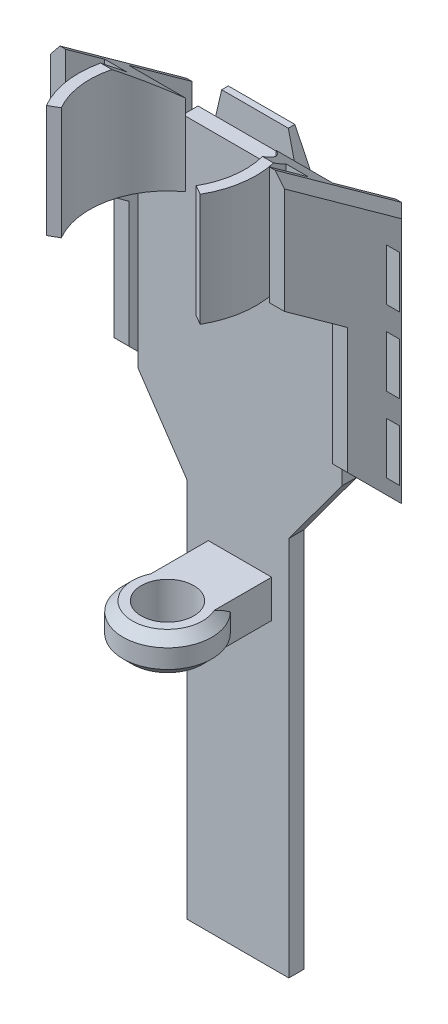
ISO-10303-21;
HEADER;
FILE_DESCRIPTION(('STEP AP214'),'2;1');
FILE_NAME('part.step','',(''),(''),'','','');
FILE_SCHEMA(('AUTOMOTIVE_DESIGN { 1 0 10303 214 1 1 1 1 }'));
ENDSEC;
DATA;
#1=APPLICATION_CONTEXT('core data for automotive mechanical design processes');
#2=APPLICATION_PROTOCOL_DEFINITION('international standard','automotive_design',2000,#1);
#3=PRODUCT_CONTEXT('',#1,'mechanical');
#4=PRODUCT('Part','Part','',(#3));
#5=PRODUCT_RELATED_PRODUCT_CATEGORY('part','',(#4));
#6=PRODUCT_DEFINITION_FORMATION('','',#4);
#7=PRODUCT_DEFINITION_CONTEXT('part definition',#1,'design');
#8=PRODUCT_DEFINITION('design','',#6,#7);
#9=PRODUCT_DEFINITION_SHAPE('','',#8);
#10=(LENGTH_UNIT() NAMED_UNIT(*) SI_UNIT(.MILLI.,.METRE.));
#11=(NAMED_UNIT(*) PLANE_ANGLE_UNIT() SI_UNIT($,.RADIAN.));
#12=(NAMED_UNIT(*) SI_UNIT($,.STERADIAN.) SOLID_ANGLE_UNIT());
#13=UNCERTAINTY_MEASURE_WITH_UNIT(LENGTH_MEASURE(1.E-05),#10,'distance_accuracy_value','');
#14=(GEOMETRIC_REPRESENTATION_CONTEXT(3) GLOBAL_UNCERTAINTY_ASSIGNED_CONTEXT((#13)) GLOBAL_UNIT_ASSIGNED_CONTEXT((#10,
#11,#12)) REPRESENTATION_CONTEXT('',''));
#15=CARTESIAN_POINT('',(0.,0.,0.));
#16=DIRECTION('',(0.,0.,1.));
#17=DIRECTION('',(1.,0.,0.));
#18=AXIS2_PLACEMENT_3D('',#15,#16,#17);
#19=CARTESIAN_POINT('',(0.,0.,-23.305243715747));
#20=DIRECTION('',(0.,0.,1.));
#21=DIRECTION('',(1.,0.,0.));
#22=AXIS2_PLACEMENT_3D('',#19,#20,#21);
#23=PLANE('',#22);
#24=DIRECTION('',(0.227745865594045,-0.973720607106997,0.));
#25=VECTOR('',#24,1.);
#26=CARTESIAN_POINT('',(8.86918178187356,111.768119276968,-23.305243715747));
#27=LINE('',#26,#25);
#28=CARTESIAN_POINT('',(10.4823329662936,104.871139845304,-23.305243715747));
#29=VERTEX_POINT('',#28);
#30=CARTESIAN_POINT('',(16.1330414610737,80.711705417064,-23.305243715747));
#31=VERTEX_POINT('',#30);
#32=EDGE_CURVE('E1527',#29,#31,#27,.T.);
#33=ORIENTED_EDGE('',*,*,#32,.F.);
#34=DIRECTION('',(-1.,0.,0.));
#35=VECTOR('',#34,1.);
#36=CARTESIAN_POINT('',(0.,104.871139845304,-23.305243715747));
#37=LINE('',#36,#35);
#38=CARTESIAN_POINT('',(16.2268814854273,104.871139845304,-23.305243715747));
#39=VERTEX_POINT('',#38);
#40=EDGE_CURVE('E931',#39,#29,#37,.T.);
#41=ORIENTED_EDGE('',*,*,#40,.F.);
#42=DIRECTION('',(-0.608723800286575,0.793382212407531,0.));
#43=VECTOR('',#42,1.);
#44=CARTESIAN_POINT('',(16.2268814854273,104.871139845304,-23.305243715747));
#45=LINE('',#44,#43);
#46=CARTESIAN_POINT('',(27.1310757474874,90.6591215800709,-23.305243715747));
#47=VERTEX_POINT('',#46);
#48=EDGE_CURVE('E831',#47,#39,#45,.T.);
#49=ORIENTED_EDGE('',*,*,#48,.F.);
#50=DIRECTION('',(0.,-1.,0.));
#51=VECTOR('',#50,1.);
#52=CARTESIAN_POINT('',(27.1310757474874,-15.1547254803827,-23.305243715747));
#53=LINE('',#52,#51);
#54=CARTESIAN_POINT('',(27.1310757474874,40.3988814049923,-23.305243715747));
#55=VERTEX_POINT('',#54);
#56=EDGE_CURVE('E965',#47,#55,#53,.T.);
#57=ORIENTED_EDGE('',*,*,#56,.T.);
#58=DIRECTION('',(0.592987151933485,0.805211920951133,0.));
#59=VECTOR('',#58,1.);
#60=CARTESIAN_POINT('',(13.0003071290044,21.2108377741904,-23.305243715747));
#61=LINE('',#60,#59);
#62=CARTESIAN_POINT('',(13.0003071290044,21.2108377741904,-23.305243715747));
#63=VERTEX_POINT('',#62);
#64=EDGE_CURVE('E937',#63,#55,#61,.T.);
#65=ORIENTED_EDGE('',*,*,#64,.F.);
#66=DIRECTION('',(0.,-1.,0.));
#67=VECTOR('',#66,1.);
#68=CARTESIAN_POINT('',(13.0003071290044,-15.1547254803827,-23.305243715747));
#69=LINE('',#68,#67);
#70=CARTESIAN_POINT('',(13.0003071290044,-80.1562611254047,-23.305243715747));
#71=VERTEX_POINT('',#70);
#72=EDGE_CURVE('E968',#63,#71,#69,.T.);
#73=ORIENTED_EDGE('',*,*,#72,.T.);
#74=DIRECTION('',(-1.,0.,0.));
#75=VECTOR('',#74,1.);
#76=CARTESIAN_POINT('',(13.0003071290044,-80.1562611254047,-23.305243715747));
#77=LINE('',#76,#75);
#78=CARTESIAN_POINT('',(-14.130768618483,-80.1562611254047,-23.305243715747));
#79=VERTEX_POINT('',#78);
#80=EDGE_CURVE('E970',#71,#79,#77,.T.);
#81=ORIENTED_EDGE('',*,*,#80,.T.);
#82=DIRECTION('',(0.,1.,0.));
#83=VECTOR('',#82,1.);
#84=CARTESIAN_POINT('',(-14.130768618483,-15.1547254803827,-23.305243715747));
#85=LINE('',#84,#83);
#86=CARTESIAN_POINT('',(-14.130768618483,21.2108377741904,-23.305243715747));
#87=VERTEX_POINT('',#86);
#88=EDGE_CURVE('E972',#79,#87,#85,.T.);
#89=ORIENTED_EDGE('',*,*,#88,.T.);
#90=DIRECTION('',(0.560905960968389,-0.827879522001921,0.));
#91=VECTOR('',#90,1.);
#92=CARTESIAN_POINT('',(-14.130768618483,21.2108377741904,-23.305243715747));
#93=LINE('',#92,#91);
#94=CARTESIAN_POINT('',(-27.1310757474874,40.3988814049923,-23.305243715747));
#95=VERTEX_POINT('',#94);
#96=EDGE_CURVE('E949',#95,#87,#93,.T.);
#97=ORIENTED_EDGE('',*,*,#96,.F.);
#98=DIRECTION('',(0.,1.,0.));
#99=VECTOR('',#98,1.);
#100=CARTESIAN_POINT('',(-27.1310757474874,-15.1547254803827,-23.305243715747));
#101=LINE('',#100,#99);
#102=CARTESIAN_POINT('',(-27.1310757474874,90.6591215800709,-23.305243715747));
#103=VERTEX_POINT('',#102);
#104=EDGE_CURVE('E962',#95,#103,#101,.T.);
#105=ORIENTED_EDGE('',*,*,#104,.T.);
#106=DIRECTION('',(-0.643733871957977,-0.765249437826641,0.));
#107=VECTOR('',#106,1.);
#108=CARTESIAN_POINT('',(-15.1758137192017,104.871139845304,-23.305243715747));
#109=LINE('',#108,#107);
#110=CARTESIAN_POINT('',(-15.1758137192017,104.871139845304,-23.305243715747));
#111=VERTEX_POINT('',#110);
#112=EDGE_CURVE('E822',#111,#103,#109,.T.);
#113=ORIENTED_EDGE('',*,*,#112,.F.);
#114=CARTESIAN_POINT('',(-10.4823329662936,104.871139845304,-23.305243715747));
#115=VERTEX_POINT('',#114);
#116=EDGE_CURVE('E930',#115,#111,#37,.T.);
#117=ORIENTED_EDGE('',*,*,#116,.F.);
#118=DIRECTION('',(0.227745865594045,0.973720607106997,0.));
#119=VECTOR('',#118,1.);
#120=CARTESIAN_POINT('',(-8.86918178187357,111.768119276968,-23.305243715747));
#121=LINE('',#120,#119);
#122=CARTESIAN_POINT('',(-16.1330414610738,80.711705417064,-23.305243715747));
#123=VERTEX_POINT('',#122);
#124=EDGE_CURVE('E1518',#123,#115,#121,.T.);
#125=ORIENTED_EDGE('',*,*,#124,.F.);
#126=DIRECTION('',(0.,1.,0.));
#127=VECTOR('',#126,1.);
#128=CARTESIAN_POINT('',(-16.1330414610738,62.5061686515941,-23.305243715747));
#129=LINE('',#128,#127);
#130=CARTESIAN_POINT('',(-16.1330414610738,34.669040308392,-23.305243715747));
#131=VERTEX_POINT('',#130);
#132=EDGE_CURVE('E579',#131,#123,#129,.T.);
#133=ORIENTED_EDGE('',*,*,#132,.F.);
#134=DIRECTION('',(-0.526653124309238,0.850080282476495,0.));
#135=VECTOR('',#134,1.);
#136=CARTESIAN_POINT('',(-8.86918178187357,22.944313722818,-23.305243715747));
#137=LINE('',#136,#135);
#138=CARTESIAN_POINT('',(-8.86918178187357,22.944313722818,-23.305243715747));
#139=VERTEX_POINT('',#138);
#140=EDGE_CURVE('E1543',#139,#131,#137,.T.);
#141=ORIENTED_EDGE('',*,*,#140,.F.);
#142=DIRECTION('',(-1.,0.,0.));
#143=VECTOR('',#142,1.);
#144=CARTESIAN_POINT('',(8.86918178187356,22.944313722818,-23.305243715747));
#145=LINE('',#144,#143);
#146=CARTESIAN_POINT('',(8.86918178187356,22.944313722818,-23.305243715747));
#147=VERTEX_POINT('',#146);
#148=EDGE_CURVE('E1541',#147,#139,#145,.T.);
#149=ORIENTED_EDGE('',*,*,#148,.F.);
#150=DIRECTION('',(-0.526653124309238,-0.850080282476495,0.));
#151=VECTOR('',#150,1.);
#152=CARTESIAN_POINT('',(16.1330414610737,34.669040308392,-23.305243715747));
#153=LINE('',#152,#151);
#154=CARTESIAN_POINT('',(16.1330414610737,34.669040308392,-23.305243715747));
#155=VERTEX_POINT('',#154);
#156=EDGE_CURVE('E1539',#155,#147,#153,.T.);
#157=ORIENTED_EDGE('',*,*,#156,.F.);
#158=DIRECTION('',(0.,-1.,0.));
#159=VECTOR('',#158,1.);
#160=CARTESIAN_POINT('',(16.1330414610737,62.5061686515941,-23.305243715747));
#161=LINE('',#160,#159);
#162=EDGE_CURVE('E1530',#31,#155,#161,.T.);
#163=ORIENTED_EDGE('',*,*,#162,.F.);
#164=EDGE_LOOP('',(#33,#41,#49,#57,#65,#73,#81,#89,#97,#105,#113,#117,#125,#133,#141,#149,#157,#163));
#165=FACE_BOUND('',#164,.T.);
#166=ADVANCED_FACE('F34',(#165),#23,.F.);
#167=CARTESIAN_POINT('',(0.,119.871139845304,0.));
#168=DIRECTION('',(0.,-1.,0.));
#169=DIRECTION('',(0.,0.,-1.));
#170=AXIS2_PLACEMENT_3D('',#167,#168,#169);
#171=CYLINDRICAL_SURFACE('',#170,23.6239332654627);
#172=CARTESIAN_POINT('',(0.,123.624184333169,0.));
#173=DIRECTION('',(0.,0.811362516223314,-0.584543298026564));
#174=DIRECTION('',(0.,-0.584543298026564,-0.811362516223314));
#175=AXIS2_PLACEMENT_3D('',#172,#173,#174);
#176=ELLIPSE('',#175,29.1163725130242,23.6239332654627);
#177=CARTESIAN_POINT('',(-21.2184991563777,116.141747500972,-10.3858324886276));
#178=VERTEX_POINT('',#177);
#179=CARTESIAN_POINT('',(-23.0362914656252,119.851664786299,-5.23636309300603));
#180=VERTEX_POINT('',#179);
#181=EDGE_CURVE('E622',#178,#180,#176,.T.);
#182=ORIENTED_EDGE('',*,*,#181,.F.);
#183=DIRECTION('',(0.,-1.,0.));
#184=VECTOR('',#183,1.);
#185=CARTESIAN_POINT('',(-21.2184991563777,119.871139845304,-10.3858324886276));
#186=LINE('',#185,#184);
#187=CARTESIAN_POINT('',(-21.2184991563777,89.8711398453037,-10.3858324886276));
#188=VERTEX_POINT('',#187);
#189=EDGE_CURVE('E672',#178,#188,#186,.T.);
#190=ORIENTED_EDGE('',*,*,#189,.T.);
#191=CARTESIAN_POINT('',(0.,89.8711398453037,0.));
#192=DIRECTION('',(0.,1.,0.));
#193=DIRECTION('',(0.,0.,1.));
#194=AXIS2_PLACEMENT_3D('',#191,#192,#193);
#195=CIRCLE('',#194,23.6239332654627);
#196=CARTESIAN_POINT('',(-20.4837365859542,89.8711398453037,11.7688894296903));
#197=VERTEX_POINT('',#196);
#198=EDGE_CURVE('E663',#188,#197,#195,.T.);
#199=ORIENTED_EDGE('',*,*,#198,.T.);
#200=DIRECTION('',(0.,-1.,0.));
#201=VECTOR('',#200,1.);
#202=CARTESIAN_POINT('',(-20.4837365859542,119.871139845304,11.7688894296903));
#203=LINE('',#202,#201);
#204=CARTESIAN_POINT('',(-20.4837365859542,119.871139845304,11.7688894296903));
#205=VERTEX_POINT('',#204);
#206=EDGE_CURVE('E698',#205,#197,#203,.T.);
#207=ORIENTED_EDGE('',*,*,#206,.F.);
#208=CARTESIAN_POINT('',(0.,119.871139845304,0.));
#209=DIRECTION('',(0.,1.,0.));
#210=DIRECTION('',(0.,0.,1.));
#211=AXIS2_PLACEMENT_3D('',#208,#209,#210);
#212=CIRCLE('',#211,23.6239332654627);
#213=CARTESIAN_POINT('',(-23.0362914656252,119.871139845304,-5.23636309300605));
#214=VERTEX_POINT('',#213);
#215=EDGE_CURVE('E664',#214,#205,#212,.T.);
#216=ORIENTED_EDGE('',*,*,#215,.F.);
#217=DIRECTION('',(0.,-1.,0.));
#218=VECTOR('',#217,1.);
#219=CARTESIAN_POINT('',(-23.0362914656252,119.871139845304,-5.23636309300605));
#220=LINE('',#219,#218);
#221=EDGE_CURVE('E614',#180,#214,#220,.F.);
#222=ORIENTED_EDGE('',*,*,#221,.F.);
#223=EDGE_LOOP('',(#182,#190,#199,#207,#216,#222));
#224=FACE_BOUND('',#223,.T.);
#225=ADVANCED_FACE('F1125',(#224),#171,.T.);
#226=CARTESIAN_POINT('',(0.,119.871139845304,0.));
#227=DIRECTION('',(0.,-1.,0.));
#228=DIRECTION('',(0.,0.,-1.));
#229=AXIS2_PLACEMENT_3D('',#226,#227,#228);
#230=CYLINDRICAL_SURFACE('',#229,20.7214462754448);
#231=CARTESIAN_POINT('',(0.,123.624184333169,0.));
#232=DIRECTION('',(0.,0.811362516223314,-0.584543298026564));
#233=DIRECTION('',(0.,-0.584543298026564,-0.811362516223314));
#234=AXIS2_PLACEMENT_3D('',#231,#232,#233);
#235=ELLIPSE('',#234,25.5390726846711,20.7214462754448);
#236=CARTESIAN_POINT('',(-20.0489111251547,119.851664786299,-5.23636309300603));
#237=VERTEX_POINT('',#236);
#238=CARTESIAN_POINT('',(-12.0462048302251,111.47729188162,-16.8602279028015));
#239=VERTEX_POINT('',#238);
#240=EDGE_CURVE('E624',#237,#239,#235,.F.);
#241=ORIENTED_EDGE('',*,*,#240,.F.);
#242=DIRECTION('',(0.,-1.,0.));
#243=VECTOR('',#242,1.);
#244=CARTESIAN_POINT('',(-20.0489111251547,119.871139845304,-5.23636309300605));
#245=LINE('',#244,#243);
#246=CARTESIAN_POINT('',(-20.0489111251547,119.871139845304,-5.23636309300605));
#247=VERTEX_POINT('',#246);
#248=EDGE_CURVE('E612',#247,#237,#245,.T.);
#249=ORIENTED_EDGE('',*,*,#248,.F.);
#250=CARTESIAN_POINT('',(0.,119.871139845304,0.));
#251=DIRECTION('',(0.,-1.,0.));
#252=DIRECTION('',(0.,0.,1.));
#253=AXIS2_PLACEMENT_3D('',#250,#251,#252);
#254=CIRCLE('',#253,20.7214462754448);
#255=CARTESIAN_POINT('',(-17.9670608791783,119.871139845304,10.3229384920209));
#256=VERTEX_POINT('',#255);
#257=EDGE_CURVE('E669',#256,#247,#254,.T.);
#258=ORIENTED_EDGE('',*,*,#257,.F.);
#259=DIRECTION('',(0.,-1.,0.));
#260=VECTOR('',#259,1.);
#261=CARTESIAN_POINT('',(-17.9670608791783,119.871139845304,10.3229384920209));
#262=LINE('',#261,#260);
#263=CARTESIAN_POINT('',(-17.9670608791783,89.8711398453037,10.3229384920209));
#264=VERTEX_POINT('',#263);
#265=EDGE_CURVE('E695',#256,#264,#262,.T.);
#266=ORIENTED_EDGE('',*,*,#265,.T.);
#267=CARTESIAN_POINT('',(0.,89.8711398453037,0.));
#268=DIRECTION('',(0.,-1.,0.));
#269=DIRECTION('',(0.,0.,1.));
#270=AXIS2_PLACEMENT_3D('',#267,#268,#269);
#271=CIRCLE('',#270,20.7214462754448);
#272=CARTESIAN_POINT('',(-12.0462048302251,89.8711398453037,-16.8602279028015));
#273=VERTEX_POINT('',#272);
#274=EDGE_CURVE('E677',#264,#273,#271,.T.);
#275=ORIENTED_EDGE('',*,*,#274,.T.);
#276=DIRECTION('',(0.,-1.,0.));
#277=VECTOR('',#276,1.);
#278=CARTESIAN_POINT('',(-12.0462048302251,119.871139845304,-16.8602279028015));
#279=LINE('',#278,#277);
#280=EDGE_CURVE('E693',#239,#273,#279,.T.);
#281=ORIENTED_EDGE('',*,*,#280,.F.);
#282=EDGE_LOOP('',(#241,#249,#258,#266,#275,#281));
#283=FACE_BOUND('',#282,.T.);
#284=ADVANCED_FACE('F1265',(#283),#230,.F.);
#285=CARTESIAN_POINT('',(-27.1310757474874,119.871139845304,-16.8602279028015));
#286=DIRECTION('',(0.,0.,1.));
#287=DIRECTION('',(1.,0.,0.));
#288=AXIS2_PLACEMENT_3D('',#285,#286,#287);
#289=PLANE('',#288);
#290=DIRECTION('',(1.,0.,0.));
#291=VECTOR('',#290,1.);
#292=CARTESIAN_POINT('',(-41.8689242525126,111.47729188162,-16.8602279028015));
#293=LINE('',#292,#291);
#294=CARTESIAN_POINT('',(-27.1310757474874,111.47729188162,-16.8602279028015));
#295=VERTEX_POINT('',#294);
#296=EDGE_CURVE('E601',#295,#239,#293,.T.);
#297=ORIENTED_EDGE('',*,*,#296,.T.);
#298=ORIENTED_EDGE('',*,*,#280,.T.);
#299=DIRECTION('',(-1.,0.,0.));
#300=VECTOR('',#299,1.);
#301=CARTESIAN_POINT('',(-27.1310757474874,89.8711398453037,-16.8602279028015));
#302=LINE('',#301,#300);
#303=CARTESIAN_POINT('',(-27.1310757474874,89.8711398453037,-16.8602279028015));
#304=VERTEX_POINT('',#303);
#305=EDGE_CURVE('E680',#273,#304,#302,.T.);
#306=ORIENTED_EDGE('',*,*,#305,.T.);
#307=DIRECTION('',(0.,-1.,0.));
#308=VECTOR('',#307,1.);
#309=CARTESIAN_POINT('',(-27.1310757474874,119.871139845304,-16.8602279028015));
#310=LINE('',#309,#308);
#311=EDGE_CURVE('E690',#295,#304,#310,.T.);
#312=ORIENTED_EDGE('',*,*,#311,.F.);
#313=EDGE_LOOP('',(#297,#298,#306,#312));
#314=FACE_BOUND('',#313,.T.);
#315=ADVANCED_FACE('F1273',(#314),#289,.F.);
#316=CARTESIAN_POINT('',(-27.1310757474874,119.871139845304,-10.3858324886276));
#317=DIRECTION('',(0.,0.,-1.));
#318=DIRECTION('',(-1.,0.,0.));
#319=AXIS2_PLACEMENT_3D('',#316,#317,#318);
#320=PLANE('',#319);
#321=DIRECTION('',(1.,0.,0.));
#322=VECTOR('',#321,1.);
#323=CARTESIAN_POINT('',(-27.1310757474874,116.141747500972,-10.3858324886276));
#324=LINE('',#323,#322);
#325=CARTESIAN_POINT('',(-27.1310757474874,116.141747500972,-10.3858324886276));
#326=VERTEX_POINT('',#325);
#327=EDGE_CURVE('E620',#326,#178,#324,.T.);
#328=ORIENTED_EDGE('',*,*,#327,.F.);
#329=DIRECTION('',(0.,-1.,0.));
#330=VECTOR('',#329,1.);
#331=CARTESIAN_POINT('',(-27.1310757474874,119.871139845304,-10.3858324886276));
#332=LINE('',#331,#330);
#333=CARTESIAN_POINT('',(-27.1310757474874,89.8711398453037,-10.3858324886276));
#334=VERTEX_POINT('',#333);
#335=EDGE_CURVE('E688',#326,#334,#332,.T.);
#336=ORIENTED_EDGE('',*,*,#335,.T.);
#337=DIRECTION('',(1.,0.,0.));
#338=VECTOR('',#337,1.);
#339=CARTESIAN_POINT('',(-27.1310757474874,89.8711398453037,-10.3858324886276));
#340=LINE('',#339,#338);
#341=EDGE_CURVE('E667',#334,#188,#340,.T.);
#342=ORIENTED_EDGE('',*,*,#341,.T.);
#343=ORIENTED_EDGE('',*,*,#189,.F.);
#344=EDGE_LOOP('',(#328,#336,#342,#343));
#345=FACE_BOUND('',#344,.T.);
#346=ADVANCED_FACE('F1277',(#345),#320,.F.);
#347=CARTESIAN_POINT('',(0.,119.871139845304,0.));
#348=DIRECTION('',(0.,1.,0.));
#349=DIRECTION('',(0.,0.,1.));
#350=AXIS2_PLACEMENT_3D('',#347,#348,#349);
#351=PLANE('',#350);
#352=ORIENTED_EDGE('',*,*,#257,.T.);
#353=DIRECTION('',(-1.,0.,0.));
#354=VECTOR('',#353,1.);
#355=CARTESIAN_POINT('',(0.,119.871139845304,-5.23636309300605));
#356=LINE('',#355,#354);
#357=EDGE_CURVE('E609',#247,#214,#356,.T.);
#358=ORIENTED_EDGE('',*,*,#357,.T.);
#359=ORIENTED_EDGE('',*,*,#215,.T.);
#360=DIRECTION('',(0.867075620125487,0.,-0.49817654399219));
#361=VECTOR('',#360,1.);
#362=CARTESIAN_POINT('',(-20.4837365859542,119.871139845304,11.7688894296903));
#363=LINE('',#362,#361);
#364=EDGE_CURVE('E666',#205,#256,#363,.T.);
#365=ORIENTED_EDGE('',*,*,#364,.T.);
#366=EDGE_LOOP('',(#352,#358,#359,#365));
#367=FACE_BOUND('',#366,.T.);
#368=ADVANCED_FACE('F1281',(#367),#351,.T.);
#369=CARTESIAN_POINT('',(12.0462048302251,119.871139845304,-16.8602279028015));
#370=DIRECTION('',(0.,0.,1.));
#371=DIRECTION('',(1.,0.,0.));
#372=AXIS2_PLACEMENT_3D('',#369,#370,#371);
#373=PLANE('',#372);
#374=CARTESIAN_POINT('',(12.0462048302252,111.47729188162,-16.8602279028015));
#375=VERTEX_POINT('',#374);
#376=CARTESIAN_POINT('',(27.1310757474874,111.47729188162,-16.8602279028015));
#377=VERTEX_POINT('',#376);
#378=EDGE_CURVE('E599',#375,#377,#293,.T.);
#379=ORIENTED_EDGE('',*,*,#378,.T.);
#380=DIRECTION('',(0.,-1.,0.));
#381=VECTOR('',#380,1.);
#382=CARTESIAN_POINT('',(27.1310757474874,119.871139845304,-16.8602279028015));
#383=LINE('',#382,#381);
#384=CARTESIAN_POINT('',(27.1310757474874,89.8711398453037,-16.8602279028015));
#385=VERTEX_POINT('',#384);
#386=EDGE_CURVE('E635',#377,#385,#383,.T.);
#387=ORIENTED_EDGE('',*,*,#386,.T.);
#388=DIRECTION('',(-1.,0.,0.));
#389=VECTOR('',#388,1.);
#390=CARTESIAN_POINT('',(12.0462048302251,89.8711398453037,-16.8602279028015));
#391=LINE('',#390,#389);
#392=CARTESIAN_POINT('',(12.0462048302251,89.8711398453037,-16.8602279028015));
#393=VERTEX_POINT('',#392);
#394=EDGE_CURVE('E626',#385,#393,#391,.T.);
#395=ORIENTED_EDGE('',*,*,#394,.T.);
#396=DIRECTION('',(0.,-1.,0.));
#397=VECTOR('',#396,1.);
#398=CARTESIAN_POINT('',(12.0462048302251,119.871139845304,-16.8602279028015));
#399=LINE('',#398,#397);
#400=EDGE_CURVE('E661',#375,#393,#399,.T.);
#401=ORIENTED_EDGE('',*,*,#400,.F.);
#402=EDGE_LOOP('',(#379,#387,#395,#401));
#403=FACE_BOUND('',#402,.T.);
#404=ADVANCED_FACE('F1289',(#403),#373,.F.);
#405=CARTESIAN_POINT('',(0.,119.871139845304,0.));
#406=DIRECTION('',(0.,-1.,0.));
#407=DIRECTION('',(0.,0.,-1.));
#408=AXIS2_PLACEMENT_3D('',#405,#406,#407);
#409=CYLINDRICAL_SURFACE('',#408,20.7214462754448);
#410=CARTESIAN_POINT('',(0.,123.624184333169,0.));
#411=DIRECTION('',(0.,0.811362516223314,-0.584543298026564));
#412=DIRECTION('',(0.,-0.584543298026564,-0.811362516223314));
#413=AXIS2_PLACEMENT_3D('',#410,#411,#412);
#414=ELLIPSE('',#413,25.5390726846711,20.7214462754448);
#415=CARTESIAN_POINT('',(20.0489111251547,119.851664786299,-5.23636309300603));
#416=VERTEX_POINT('',#415);
#417=EDGE_CURVE('E618',#375,#416,#414,.F.);
#418=ORIENTED_EDGE('',*,*,#417,.F.);
#419=ORIENTED_EDGE('',*,*,#400,.T.);
#420=CARTESIAN_POINT('',(0.,89.8711398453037,0.));
#421=DIRECTION('',(0.,-1.,0.));
#422=DIRECTION('',(0.,0.,1.));
#423=AXIS2_PLACEMENT_3D('',#420,#421,#422);
#424=CIRCLE('',#423,20.7214462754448);
#425=CARTESIAN_POINT('',(17.9670608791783,89.8711398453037,10.3229384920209));
#426=VERTEX_POINT('',#425);
#427=EDGE_CURVE('E638',#393,#426,#424,.T.);
#428=ORIENTED_EDGE('',*,*,#427,.T.);
#429=DIRECTION('',(0.,-1.,0.));
#430=VECTOR('',#429,1.);
#431=CARTESIAN_POINT('',(17.9670608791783,119.871139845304,10.3229384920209));
#432=LINE('',#431,#430);
#433=CARTESIAN_POINT('',(17.9670608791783,119.871139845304,10.3229384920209));
#434=VERTEX_POINT('',#433);
#435=EDGE_CURVE('E658',#434,#426,#432,.T.);
#436=ORIENTED_EDGE('',*,*,#435,.F.);
#437=CARTESIAN_POINT('',(0.,119.871139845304,0.));
#438=DIRECTION('',(0.,-1.,0.));
#439=DIRECTION('',(0.,0.,1.));
#440=AXIS2_PLACEMENT_3D('',#437,#438,#439);
#441=CIRCLE('',#440,20.7214462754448);
#442=CARTESIAN_POINT('',(20.0489111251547,119.871139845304,-5.23636309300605));
#443=VERTEX_POINT('',#442);
#444=EDGE_CURVE('E627',#443,#434,#441,.T.);
#445=ORIENTED_EDGE('',*,*,#444,.F.);
#446=DIRECTION('',(0.,-1.,0.));
#447=VECTOR('',#446,1.);
#448=CARTESIAN_POINT('',(20.0489111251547,119.871139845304,-5.23636309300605));
#449=LINE('',#448,#447);
#450=EDGE_CURVE('E607',#416,#443,#449,.F.);
#451=ORIENTED_EDGE('',*,*,#450,.F.);
#452=EDGE_LOOP('',(#418,#419,#428,#436,#445,#451));
#453=FACE_BOUND('',#452,.T.);
#454=ADVANCED_FACE('F1293',(#453),#409,.F.);
#455=CARTESIAN_POINT('',(0.,119.871139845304,0.));
#456=DIRECTION('',(0.,-1.,0.));
#457=DIRECTION('',(0.,0.,-1.));
#458=AXIS2_PLACEMENT_3D('',#455,#456,#457);
#459=CYLINDRICAL_SURFACE('',#458,23.6239332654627);
#460=CARTESIAN_POINT('',(0.,123.624184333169,0.));
#461=DIRECTION('',(0.,0.811362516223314,-0.584543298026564));
#462=DIRECTION('',(0.,-0.584543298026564,-0.811362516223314));
#463=AXIS2_PLACEMENT_3D('',#460,#461,#462);
#464=ELLIPSE('',#463,29.1163725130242,23.6239332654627);
#465=CARTESIAN_POINT('',(23.0362914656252,119.851664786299,-5.23636309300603));
#466=VERTEX_POINT('',#465);
#467=CARTESIAN_POINT('',(21.2184991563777,116.141747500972,-10.3858324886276));
#468=VERTEX_POINT('',#467);
#469=EDGE_CURVE('E616',#466,#468,#464,.T.);
#470=ORIENTED_EDGE('',*,*,#469,.F.);
#471=DIRECTION('',(0.,-1.,0.));
#472=VECTOR('',#471,1.);
#473=CARTESIAN_POINT('',(23.0362914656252,119.871139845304,-5.23636309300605));
#474=LINE('',#473,#472);
#475=CARTESIAN_POINT('',(23.0362914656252,119.871139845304,-5.23636309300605));
#476=VERTEX_POINT('',#475);
#477=EDGE_CURVE('E605',#476,#466,#474,.T.);
#478=ORIENTED_EDGE('',*,*,#477,.F.);
#479=CARTESIAN_POINT('',(0.,119.871139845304,0.));
#480=DIRECTION('',(0.,1.,0.));
#481=DIRECTION('',(0.,0.,1.));
#482=AXIS2_PLACEMENT_3D('',#479,#480,#481);
#483=CIRCLE('',#482,23.6239332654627);
#484=CARTESIAN_POINT('',(20.4837365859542,119.871139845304,11.7688894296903));
#485=VERTEX_POINT('',#484);
#486=EDGE_CURVE('E632',#485,#476,#483,.T.);
#487=ORIENTED_EDGE('',*,*,#486,.F.);
#488=DIRECTION('',(0.,-1.,0.));
#489=VECTOR('',#488,1.);
#490=CARTESIAN_POINT('',(20.4837365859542,119.871139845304,11.7688894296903));
#491=LINE('',#490,#489);
#492=CARTESIAN_POINT('',(20.4837365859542,89.8711398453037,11.7688894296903));
#493=VERTEX_POINT('',#492);
#494=EDGE_CURVE('E655',#485,#493,#491,.T.);
#495=ORIENTED_EDGE('',*,*,#494,.T.);
#496=CARTESIAN_POINT('',(0.,89.8711398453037,0.));
#497=DIRECTION('',(0.,1.,0.));
#498=DIRECTION('',(0.,0.,1.));
#499=AXIS2_PLACEMENT_3D('',#496,#497,#498);
#500=CIRCLE('',#499,23.6239332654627);
#501=CARTESIAN_POINT('',(21.2184991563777,89.8711398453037,-10.3858324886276));
#502=VERTEX_POINT('',#501);
#503=EDGE_CURVE('E642',#493,#502,#500,.T.);
#504=ORIENTED_EDGE('',*,*,#503,.T.);
#505=DIRECTION('',(0.,-1.,0.));
#506=VECTOR('',#505,1.);
#507=CARTESIAN_POINT('',(21.2184991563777,119.871139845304,-10.3858324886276));
#508=LINE('',#507,#506);
#509=EDGE_CURVE('E653',#468,#502,#508,.T.);
#510=ORIENTED_EDGE('',*,*,#509,.F.);
#511=EDGE_LOOP('',(#470,#478,#487,#495,#504,#510));
#512=FACE_BOUND('',#511,.T.);
#513=ADVANCED_FACE('F1297',(#512),#459,.T.);
#514=CARTESIAN_POINT('',(21.2184991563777,119.871139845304,-10.3858324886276));
#515=DIRECTION('',(0.,0.,-1.));
#516=DIRECTION('',(-1.,0.,0.));
#517=AXIS2_PLACEMENT_3D('',#514,#515,#516);
#518=PLANE('',#517);
#519=DIRECTION('',(1.,0.,0.));
#520=VECTOR('',#519,1.);
#521=CARTESIAN_POINT('',(21.2184991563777,116.141747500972,-10.3858324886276));
#522=LINE('',#521,#520);
#523=CARTESIAN_POINT('',(27.1310757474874,116.141747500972,-10.3858324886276));
#524=VERTEX_POINT('',#523);
#525=EDGE_CURVE('E554',#468,#524,#522,.T.);
#526=ORIENTED_EDGE('',*,*,#525,.F.);
#527=ORIENTED_EDGE('',*,*,#509,.T.);
#528=DIRECTION('',(1.,0.,0.));
#529=VECTOR('',#528,1.);
#530=CARTESIAN_POINT('',(21.2184991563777,89.8711398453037,-10.3858324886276));
#531=LINE('',#530,#529);
#532=CARTESIAN_POINT('',(27.1310757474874,89.8711398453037,-10.3858324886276));
#533=VERTEX_POINT('',#532);
#534=EDGE_CURVE('E645',#502,#533,#531,.T.);
#535=ORIENTED_EDGE('',*,*,#534,.T.);
#536=DIRECTION('',(0.,-1.,0.));
#537=VECTOR('',#536,1.);
#538=CARTESIAN_POINT('',(27.1310757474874,119.871139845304,-10.3858324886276));
#539=LINE('',#538,#537);
#540=EDGE_CURVE('E650',#524,#533,#539,.T.);
#541=ORIENTED_EDGE('',*,*,#540,.F.);
#542=EDGE_LOOP('',(#526,#527,#535,#541));
#543=FACE_BOUND('',#542,.T.);
#544=ADVANCED_FACE('F1305',(#543),#518,.F.);
#545=CARTESIAN_POINT('',(0.,119.871139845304,0.));
#546=DIRECTION('',(0.,1.,0.));
#547=DIRECTION('',(0.,0.,1.));
#548=AXIS2_PLACEMENT_3D('',#545,#546,#547);
#549=PLANE('',#548);
#550=ORIENTED_EDGE('',*,*,#486,.T.);
#551=DIRECTION('',(-1.,0.,0.));
#552=VECTOR('',#551,1.);
#553=CARTESIAN_POINT('',(0.,119.871139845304,-5.23636309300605));
#554=LINE('',#553,#552);
#555=EDGE_CURVE('E1410',#476,#443,#554,.T.);
#556=ORIENTED_EDGE('',*,*,#555,.T.);
#557=ORIENTED_EDGE('',*,*,#444,.T.);
#558=DIRECTION('',(0.867075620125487,0.,0.49817654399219));
#559=VECTOR('',#558,1.);
#560=CARTESIAN_POINT('',(17.9670608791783,119.871139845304,10.3229384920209));
#561=LINE('',#560,#559);
#562=EDGE_CURVE('E629',#434,#485,#561,.T.);
#563=ORIENTED_EDGE('',*,*,#562,.T.);
#564=EDGE_LOOP('',(#550,#556,#557,#563));
#565=FACE_BOUND('',#564,.T.);
#566=ADVANCED_FACE('F1167',(#565),#549,.T.);
#567=CARTESIAN_POINT('',(27.1310757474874,0.,0.));
#568=DIRECTION('',(1.,0.,0.));
#569=DIRECTION('',(0.,0.,-1.));
#570=AXIS2_PLACEMENT_3D('',#567,#568,#569);
#571=PLANE('',#570);
#572=DIRECTION('',(0.,1.,0.));
#573=VECTOR('',#572,1.);
#574=CARTESIAN_POINT('',(27.1310757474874,40.,-30.6737085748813));
#575=LINE('',#574,#573);
#576=CARTESIAN_POINT('',(27.1310757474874,76.8159545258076,-30.6737085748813));
#577=VERTEX_POINT('',#576);
#578=CARTESIAN_POINT('',(27.1310757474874,90.5618882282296,-30.6737085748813));
#579=VERTEX_POINT('',#578);
#580=EDGE_CURVE('E1464',#577,#579,#575,.T.);
#581=ORIENTED_EDGE('',*,*,#580,.T.);
#582=DIRECTION('',(0.,0.707106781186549,0.707106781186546));
#583=VECTOR('',#582,1.);
#584=CARTESIAN_POINT('',(27.1310757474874,80.6177984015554,-40.6177984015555));
#585=LINE('',#584,#583);
#586=CARTESIAN_POINT('',(27.1310757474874,93.9983716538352,-27.2372251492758));
#587=VERTEX_POINT('',#586);
#588=EDGE_CURVE('E1462',#579,#587,#585,.T.);
#589=ORIENTED_EDGE('',*,*,#588,.T.);
#590=DIRECTION('',(0.,-1.,0.));
#591=VECTOR('',#590,1.);
#592=CARTESIAN_POINT('',(27.1310757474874,40.,-27.2372251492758));
#593=LINE('',#592,#591);
#594=CARTESIAN_POINT('',(27.1310757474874,80.2524379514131,-27.2372251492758));
#595=VERTEX_POINT('',#594);
#596=EDGE_CURVE('E1460',#587,#595,#593,.T.);
#597=ORIENTED_EDGE('',*,*,#596,.T.);
#598=DIRECTION('',(0.,-0.707106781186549,-0.707106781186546));
#599=VECTOR('',#598,1.);
#600=CARTESIAN_POINT('',(27.1310757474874,73.7448315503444,-33.7448315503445));
#601=LINE('',#600,#599);
#602=EDGE_CURVE('E1457',#595,#577,#601,.T.);
#603=ORIENTED_EDGE('',*,*,#602,.T.);
#604=EDGE_LOOP('',(#581,#589,#597,#603));
#605=FACE_BOUND('',#604,.T.);
#606=DIRECTION('',(0.,-0.707106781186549,-0.707106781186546));
#607=VECTOR('',#606,1.);
#608=CARTESIAN_POINT('',(27.1310757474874,33.7448315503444,-33.7448315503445));
#609=LINE('',#608,#607);
#610=CARTESIAN_POINT('',(27.1310757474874,40.2524379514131,-27.2372251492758));
#611=VERTEX_POINT('',#610);
#612=CARTESIAN_POINT('',(27.1310757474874,36.8159545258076,-30.6737085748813));
#613=VERTEX_POINT('',#612);
#614=EDGE_CURVE('E794',#611,#613,#609,.T.);
#615=ORIENTED_EDGE('',*,*,#614,.T.);
#616=DIRECTION('',(0.,1.,0.));
#617=VECTOR('',#616,1.);
#618=CARTESIAN_POINT('',(27.1310757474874,0.,-30.6737085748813));
#619=LINE('',#618,#617);
#620=CARTESIAN_POINT('',(27.1310757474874,50.5618882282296,-30.6737085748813));
#621=VERTEX_POINT('',#620);
#622=EDGE_CURVE('E819',#613,#621,#619,.T.);
#623=ORIENTED_EDGE('',*,*,#622,.T.);
#624=DIRECTION('',(0.,0.707106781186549,0.707106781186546));
#625=VECTOR('',#624,1.);
#626=CARTESIAN_POINT('',(27.1310757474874,40.6177984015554,-40.6177984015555));
#627=LINE('',#626,#625);
#628=CARTESIAN_POINT('',(27.1310757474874,53.9983716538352,-27.2372251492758));
#629=VERTEX_POINT('',#628);
#630=EDGE_CURVE('E811',#621,#629,#627,.T.);
#631=ORIENTED_EDGE('',*,*,#630,.T.);
#632=DIRECTION('',(0.,-1.,0.));
#633=VECTOR('',#632,1.);
#634=CARTESIAN_POINT('',(27.1310757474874,0.,-27.2372251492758));
#635=LINE('',#634,#633);
#636=EDGE_CURVE('E803',#629,#611,#635,.T.);
#637=ORIENTED_EDGE('',*,*,#636,.T.);
#638=EDGE_LOOP('',(#615,#623,#631,#637));
#639=FACE_BOUND('',#638,.T.);
#640=DIRECTION('',(0.,-0.707106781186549,-0.707106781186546));
#641=VECTOR('',#640,1.);
#642=CARTESIAN_POINT('',(27.1310757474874,53.7448315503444,-33.7448315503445));
#643=LINE('',#642,#641);
#644=CARTESIAN_POINT('',(27.1310757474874,60.2524379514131,-27.2372251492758));
#645=VERTEX_POINT('',#644);
#646=CARTESIAN_POINT('',(27.1310757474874,56.8159545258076,-30.6737085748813));
#647=VERTEX_POINT('',#646);
#648=EDGE_CURVE('E735',#645,#647,#643,.T.);
#649=ORIENTED_EDGE('',*,*,#648,.T.);
#650=DIRECTION('',(0.,1.,0.));
#651=VECTOR('',#650,1.);
#652=CARTESIAN_POINT('',(27.1310757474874,20.,-30.6737085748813));
#653=LINE('',#652,#651);
#654=CARTESIAN_POINT('',(27.1310757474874,70.5618882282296,-30.6737085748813));
#655=VERTEX_POINT('',#654);
#656=EDGE_CURVE('E762',#647,#655,#653,.T.);
#657=ORIENTED_EDGE('',*,*,#656,.T.);
#658=DIRECTION('',(0.,0.707106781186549,0.707106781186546));
#659=VECTOR('',#658,1.);
#660=CARTESIAN_POINT('',(27.1310757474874,60.6177984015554,-40.6177984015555));
#661=LINE('',#660,#659);
#662=CARTESIAN_POINT('',(27.1310757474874,73.9983716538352,-27.2372251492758));
#663=VERTEX_POINT('',#662);
#664=EDGE_CURVE('E756',#655,#663,#661,.T.);
#665=ORIENTED_EDGE('',*,*,#664,.T.);
#666=DIRECTION('',(0.,-1.,0.));
#667=VECTOR('',#666,1.);
#668=CARTESIAN_POINT('',(27.1310757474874,20.,-27.2372251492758));
#669=LINE('',#668,#667);
#670=EDGE_CURVE('E748',#663,#645,#669,.T.);
#671=ORIENTED_EDGE('',*,*,#670,.T.);
#672=EDGE_LOOP('',(#649,#657,#665,#671));
#673=FACE_BOUND('',#672,.T.);
#674=ORIENTED_EDGE('',*,*,#386,.F.);
#675=DIRECTION('',(0.,0.584543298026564,0.811362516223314));
#676=VECTOR('',#675,1.);
#677=CARTESIAN_POINT('',(27.1310757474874,99.3303994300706,-33.7204558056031));
#678=LINE('',#677,#676);
#679=CARTESIAN_POINT('',(27.1310757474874,99.3303994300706,-33.7204558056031));
#680=VERTEX_POINT('',#679);
#681=EDGE_CURVE('E899',#680,#377,#678,.T.);
#682=ORIENTED_EDGE('',*,*,#681,.F.);
#683=DIRECTION('',(0.,1.,0.));
#684=VECTOR('',#683,1.);
#685=CARTESIAN_POINT('',(27.1310757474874,29.8327165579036,-33.7204558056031));
#686=LINE('',#685,#684);
#687=CARTESIAN_POINT('',(27.1310757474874,29.8327165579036,-33.7204558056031));
#688=VERTEX_POINT('',#687);
#689=EDGE_CURVE('E891',#688,#680,#686,.T.);
#690=ORIENTED_EDGE('',*,*,#689,.F.);
#691=DIRECTION('',(0.,-0.707106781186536,-0.707106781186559));
#692=VECTOR('',#691,1.);
#693=CARTESIAN_POINT('',(27.1310757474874,46.6929444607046,-16.8602279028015));
#694=LINE('',#693,#692);
#695=CARTESIAN_POINT('',(27.1310757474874,40.3988814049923,-23.154290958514));
#696=VERTEX_POINT('',#695);
#697=EDGE_CURVE('E909',#696,#688,#694,.T.);
#698=ORIENTED_EDGE('',*,*,#697,.F.);
#699=DIRECTION('',(0.,0.,-1.));
#700=VECTOR('',#699,1.);
#701=CARTESIAN_POINT('',(27.1310757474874,40.3988814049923,-9.30524371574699));
#702=LINE('',#701,#700);
#703=EDGE_CURVE('E944',#696,#55,#702,.T.);
#704=ORIENTED_EDGE('',*,*,#703,.T.);
#705=ORIENTED_EDGE('',*,*,#56,.F.);
#706=DIRECTION('',(0.,0.,-1.));
#707=VECTOR('',#706,1.);
#708=CARTESIAN_POINT('',(27.1310757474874,90.6591215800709,-19.305243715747));
#709=LINE('',#708,#707);
#710=CARTESIAN_POINT('',(27.1310757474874,90.6591215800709,-19.305243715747));
#711=VERTEX_POINT('',#710);
#712=EDGE_CURVE('E837',#711,#47,#709,.T.);
#713=ORIENTED_EDGE('',*,*,#712,.F.);
#714=DIRECTION('',(0.,-1.,0.));
#715=VECTOR('',#714,1.);
#716=CARTESIAN_POINT('',(27.1310757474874,-15.1547254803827,-19.305243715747));
#717=LINE('',#716,#715);
#718=CARTESIAN_POINT('',(27.1310757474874,44.2479286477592,-19.305243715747));
#719=VERTEX_POINT('',#718);
#720=EDGE_CURVE('E978',#711,#719,#717,.T.);
#721=ORIENTED_EDGE('',*,*,#720,.T.);
#722=CARTESIAN_POINT('',(27.1310757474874,46.6929444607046,-16.8602279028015));
#723=VERTEX_POINT('',#722);
#724=EDGE_CURVE('E910',#723,#719,#694,.T.);
#725=ORIENTED_EDGE('',*,*,#724,.F.);
#726=DIRECTION('',(0.,-1.,0.));
#727=VECTOR('',#726,1.);
#728=CARTESIAN_POINT('',(27.1310757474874,60.6521366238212,-16.8602279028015));
#729=LINE('',#728,#727);
#730=CARTESIAN_POINT('',(27.1310757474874,80.1510955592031,-16.8602279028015));
#731=VERTEX_POINT('',#730);
#732=EDGE_CURVE('E907',#731,#723,#729,.T.);
#733=ORIENTED_EDGE('',*,*,#732,.F.);
#734=DIRECTION('',(0.,-0.584543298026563,-0.811362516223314));
#735=VECTOR('',#734,1.);
#736=CARTESIAN_POINT('',(27.1310757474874,92.2979880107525,0.));
#737=LINE('',#736,#735);
#738=CARTESIAN_POINT('',(27.1310757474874,92.2979880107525,0.));
#739=VERTEX_POINT('',#738);
#740=EDGE_CURVE('E904',#739,#731,#737,.T.);
#741=ORIENTED_EDGE('',*,*,#740,.F.);
#742=DIRECTION('',(0.,-1.,0.));
#743=VECTOR('',#742,1.);
#744=CARTESIAN_POINT('',(27.1310757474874,123.624184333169,0.));
#745=LINE('',#744,#743);
#746=CARTESIAN_POINT('',(27.1310757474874,123.624184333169,0.));
#747=VERTEX_POINT('',#746);
#748=EDGE_CURVE('E902',#747,#739,#745,.T.);
#749=ORIENTED_EDGE('',*,*,#748,.F.);
#750=EDGE_CURVE('E887',#524,#747,#678,.T.);
#751=ORIENTED_EDGE('',*,*,#750,.F.);
#752=ORIENTED_EDGE('',*,*,#540,.T.);
#753=DIRECTION('',(0.,0.,-1.));
#754=VECTOR('',#753,1.);
#755=CARTESIAN_POINT('',(27.1310757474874,89.8711398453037,-10.3858324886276));
#756=LINE('',#755,#754);
#757=EDGE_CURVE('E630',#533,#385,#756,.T.);
#758=ORIENTED_EDGE('',*,*,#757,.T.);
#759=EDGE_LOOP('',(#674,#682,#690,#698,#704,#705,#713,#721,#725,#733,#741,#749,#751,#752,#758));
#760=FACE_BOUND('',#759,.T.);
#761=ADVANCED_FACE('F1163',(#605,#639,#673,#760),#571,.F.);
#762=CARTESIAN_POINT('',(-27.1310757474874,0.,0.));
#763=DIRECTION('',(-1.,0.,0.));
#764=DIRECTION('',(0.,0.,1.));
#765=AXIS2_PLACEMENT_3D('',#762,#763,#764);
#766=PLANE('',#765);
#767=DIRECTION('',(0.,0.707106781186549,0.707106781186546));
#768=VECTOR('',#767,1.);
#769=CARTESIAN_POINT('',(-27.1310757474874,73.7448315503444,-33.7448315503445));
#770=LINE('',#769,#768);
#771=CARTESIAN_POINT('',(-27.1310757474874,76.8159545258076,-30.6737085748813));
#772=VERTEX_POINT('',#771);
#773=CARTESIAN_POINT('',(-27.1310757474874,80.2524379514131,-27.2372251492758));
#774=VERTEX_POINT('',#773);
#775=EDGE_CURVE('E1432',#772,#774,#770,.T.);
#776=ORIENTED_EDGE('',*,*,#775,.T.);
#777=DIRECTION('',(0.,1.,0.));
#778=VECTOR('',#777,1.);
#779=CARTESIAN_POINT('',(-27.1310757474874,40.,-27.2372251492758));
#780=LINE('',#779,#778);
#781=CARTESIAN_POINT('',(-27.1310757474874,93.9983716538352,-27.2372251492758));
#782=VERTEX_POINT('',#781);
#783=EDGE_CURVE('E1430',#774,#782,#780,.T.);
#784=ORIENTED_EDGE('',*,*,#783,.T.);
#785=DIRECTION('',(0.,-0.707106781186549,-0.707106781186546));
#786=VECTOR('',#785,1.);
#787=CARTESIAN_POINT('',(-27.1310757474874,80.6177984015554,-40.6177984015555));
#788=LINE('',#787,#786);
#789=CARTESIAN_POINT('',(-27.1310757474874,90.5618882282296,-30.6737085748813));
#790=VERTEX_POINT('',#789);
#791=EDGE_CURVE('E1428',#782,#790,#788,.T.);
#792=ORIENTED_EDGE('',*,*,#791,.T.);
#793=DIRECTION('',(0.,-1.,0.));
#794=VECTOR('',#793,1.);
#795=CARTESIAN_POINT('',(-27.1310757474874,40.,-30.6737085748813));
#796=LINE('',#795,#794);
#797=EDGE_CURVE('E1425',#790,#772,#796,.T.);
#798=ORIENTED_EDGE('',*,*,#797,.T.);
#799=EDGE_LOOP('',(#776,#784,#792,#798));
#800=FACE_BOUND('',#799,.T.);
#801=DIRECTION('',(0.,-0.707106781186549,-0.707106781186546));
#802=VECTOR('',#801,1.);
#803=CARTESIAN_POINT('',(-27.1310757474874,40.6177984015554,-40.6177984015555));
#804=LINE('',#803,#802);
#805=CARTESIAN_POINT('',(-27.1310757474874,53.9983716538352,-27.2372251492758));
#806=VERTEX_POINT('',#805);
#807=CARTESIAN_POINT('',(-27.1310757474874,50.5618882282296,-30.6737085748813));
#808=VERTEX_POINT('',#807);
#809=EDGE_CURVE('E806',#806,#808,#804,.T.);
#810=ORIENTED_EDGE('',*,*,#809,.T.);
#811=DIRECTION('',(0.,-1.,0.));
#812=VECTOR('',#811,1.);
#813=CARTESIAN_POINT('',(-27.1310757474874,0.,-30.6737085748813));
#814=LINE('',#813,#812);
#815=CARTESIAN_POINT('',(-27.1310757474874,36.8159545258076,-30.6737085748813));
#816=VERTEX_POINT('',#815);
#817=EDGE_CURVE('E814',#808,#816,#814,.T.);
#818=ORIENTED_EDGE('',*,*,#817,.T.);
#819=DIRECTION('',(0.,0.707106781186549,0.707106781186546));
#820=VECTOR('',#819,1.);
#821=CARTESIAN_POINT('',(-27.1310757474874,33.7448315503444,-33.7448315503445));
#822=LINE('',#821,#820);
#823=CARTESIAN_POINT('',(-27.1310757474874,40.2524379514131,-27.2372251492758));
#824=VERTEX_POINT('',#823);
#825=EDGE_CURVE('E789',#816,#824,#822,.T.);
#826=ORIENTED_EDGE('',*,*,#825,.T.);
#827=DIRECTION('',(0.,1.,0.));
#828=VECTOR('',#827,1.);
#829=CARTESIAN_POINT('',(-27.1310757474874,0.,-27.2372251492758));
#830=LINE('',#829,#828);
#831=EDGE_CURVE('E797',#824,#806,#830,.T.);
#832=ORIENTED_EDGE('',*,*,#831,.T.);
#833=EDGE_LOOP('',(#810,#818,#826,#832));
#834=FACE_BOUND('',#833,.T.);
#835=DIRECTION('',(0.,-1.,0.));
#836=VECTOR('',#835,1.);
#837=CARTESIAN_POINT('',(-27.1310757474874,20.,-30.6737085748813));
#838=LINE('',#837,#836);
#839=CARTESIAN_POINT('',(-27.1310757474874,70.5618882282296,-30.6737085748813));
#840=VERTEX_POINT('',#839);
#841=CARTESIAN_POINT('',(-27.1310757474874,56.8159545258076,-30.6737085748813));
#842=VERTEX_POINT('',#841);
#843=EDGE_CURVE('E703',#840,#842,#838,.T.);
#844=ORIENTED_EDGE('',*,*,#843,.T.);
#845=DIRECTION('',(0.,0.707106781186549,0.707106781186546));
#846=VECTOR('',#845,1.);
#847=CARTESIAN_POINT('',(-27.1310757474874,53.7448315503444,-33.7448315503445));
#848=LINE('',#847,#846);
#849=CARTESIAN_POINT('',(-27.1310757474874,60.2524379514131,-27.2372251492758));
#850=VERTEX_POINT('',#849);
#851=EDGE_CURVE('E730',#842,#850,#848,.T.);
#852=ORIENTED_EDGE('',*,*,#851,.T.);
#853=DIRECTION('',(0.,1.,0.));
#854=VECTOR('',#853,1.);
#855=CARTESIAN_POINT('',(-27.1310757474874,20.,-27.2372251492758));
#856=LINE('',#855,#854);
#857=CARTESIAN_POINT('',(-27.1310757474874,73.9983716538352,-27.2372251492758));
#858=VERTEX_POINT('',#857);
#859=EDGE_CURVE('E724',#850,#858,#856,.T.);
#860=ORIENTED_EDGE('',*,*,#859,.T.);
#861=DIRECTION('',(0.,-0.707106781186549,-0.707106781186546));
#862=VECTOR('',#861,1.);
#863=CARTESIAN_POINT('',(-27.1310757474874,60.6177984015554,-40.6177984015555));
#864=LINE('',#863,#862);
#865=EDGE_CURVE('E716',#858,#840,#864,.T.);
#866=ORIENTED_EDGE('',*,*,#865,.T.);
#867=EDGE_LOOP('',(#844,#852,#860,#866));
#868=FACE_BOUND('',#867,.T.);
#869=ORIENTED_EDGE('',*,*,#311,.T.);
#870=DIRECTION('',(0.,0.,1.));
#871=VECTOR('',#870,1.);
#872=CARTESIAN_POINT('',(-27.1310757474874,89.8711398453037,-16.8602279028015));
#873=LINE('',#872,#871);
#874=EDGE_CURVE('E682',#304,#334,#873,.T.);
#875=ORIENTED_EDGE('',*,*,#874,.T.);
#876=ORIENTED_EDGE('',*,*,#335,.F.);
#877=DIRECTION('',(0.,-0.584543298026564,-0.811362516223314));
#878=VECTOR('',#877,1.);
#879=CARTESIAN_POINT('',(-27.1310757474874,99.3303994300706,-33.7204558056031));
#880=LINE('',#879,#878);
#881=CARTESIAN_POINT('',(-27.1310757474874,123.624184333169,0.));
#882=VERTEX_POINT('',#881);
#883=EDGE_CURVE('E864',#882,#326,#880,.T.);
#884=ORIENTED_EDGE('',*,*,#883,.F.);
#885=DIRECTION('',(0.,1.,0.));
#886=VECTOR('',#885,1.);
#887=CARTESIAN_POINT('',(-27.1310757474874,123.624184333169,0.));
#888=LINE('',#887,#886);
#889=CARTESIAN_POINT('',(-27.1310757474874,92.2979880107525,0.));
#890=VERTEX_POINT('',#889);
#891=EDGE_CURVE('E860',#890,#882,#888,.T.);
#892=ORIENTED_EDGE('',*,*,#891,.F.);
#893=DIRECTION('',(0.,0.584543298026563,0.811362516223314));
#894=VECTOR('',#893,1.);
#895=CARTESIAN_POINT('',(-27.1310757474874,92.2979880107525,0.));
#896=LINE('',#895,#894);
#897=CARTESIAN_POINT('',(-27.1310757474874,80.1510955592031,-16.8602279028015));
#898=VERTEX_POINT('',#897);
#899=EDGE_CURVE('E858',#898,#890,#896,.T.);
#900=ORIENTED_EDGE('',*,*,#899,.F.);
#901=DIRECTION('',(0.,1.,0.));
#902=VECTOR('',#901,1.);
#903=CARTESIAN_POINT('',(-27.1310757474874,80.1510955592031,-16.8602279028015));
#904=LINE('',#903,#902);
#905=CARTESIAN_POINT('',(-27.1310757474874,46.6929444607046,-16.8602279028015));
#906=VERTEX_POINT('',#905);
#907=EDGE_CURVE('E842',#906,#898,#904,.T.);
#908=ORIENTED_EDGE('',*,*,#907,.F.);
#909=DIRECTION('',(0.,0.707106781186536,0.707106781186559));
#910=VECTOR('',#909,1.);
#911=CARTESIAN_POINT('',(-27.1310757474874,46.6929444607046,-16.8602279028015));
#912=LINE('',#911,#910);
#913=CARTESIAN_POINT('',(-27.1310757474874,44.2479286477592,-19.305243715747));
#914=VERTEX_POINT('',#913);
#915=EDGE_CURVE('E869',#914,#906,#912,.T.);
#916=ORIENTED_EDGE('',*,*,#915,.F.);
#917=DIRECTION('',(0.,1.,0.));
#918=VECTOR('',#917,1.);
#919=CARTESIAN_POINT('',(-27.1310757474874,-15.1547254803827,-19.305243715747));
#920=LINE('',#919,#918);
#921=CARTESIAN_POINT('',(-27.1310757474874,90.6591215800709,-19.305243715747));
#922=VERTEX_POINT('',#921);
#923=EDGE_CURVE('E961',#914,#922,#920,.T.);
#924=ORIENTED_EDGE('',*,*,#923,.T.);
#925=DIRECTION('',(0.,0.,-1.));
#926=VECTOR('',#925,1.);
#927=CARTESIAN_POINT('',(-27.1310757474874,90.6591215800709,-19.305243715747));
#928=LINE('',#927,#926);
#929=EDGE_CURVE('E828',#922,#103,#928,.T.);
#930=ORIENTED_EDGE('',*,*,#929,.T.);
#931=ORIENTED_EDGE('',*,*,#104,.F.);
#932=DIRECTION('',(0.,0.,-1.));
#933=VECTOR('',#932,1.);
#934=CARTESIAN_POINT('',(-27.1310757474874,40.3988814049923,-9.30524371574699));
#935=LINE('',#934,#933);
#936=CARTESIAN_POINT('',(-27.1310757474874,40.3988814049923,-23.154290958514));
#937=VERTEX_POINT('',#936);
#938=EDGE_CURVE('E952',#937,#95,#935,.T.);
#939=ORIENTED_EDGE('',*,*,#938,.F.);
#940=CARTESIAN_POINT('',(-27.1310757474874,29.8327165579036,-33.7204558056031));
#941=VERTEX_POINT('',#940);
#942=EDGE_CURVE('E848',#941,#937,#912,.T.);
#943=ORIENTED_EDGE('',*,*,#942,.F.);
#944=DIRECTION('',(0.,-1.,0.));
#945=VECTOR('',#944,1.);
#946=CARTESIAN_POINT('',(-27.1310757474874,29.8327165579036,-33.7204558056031));
#947=LINE('',#946,#945);
#948=CARTESIAN_POINT('',(-27.1310757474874,99.3303994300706,-33.7204558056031));
#949=VERTEX_POINT('',#948);
#950=EDGE_CURVE('E866',#949,#941,#947,.T.);
#951=ORIENTED_EDGE('',*,*,#950,.F.);
#952=EDGE_CURVE('E863',#295,#949,#880,.T.);
#953=ORIENTED_EDGE('',*,*,#952,.F.);
#954=EDGE_LOOP('',(#869,#875,#876,#884,#892,#900,#908,#916,#924,#930,#931,#939,#943,#951,#953));
#955=FACE_BOUND('',#954,.T.);
#956=ADVANCED_FACE('F1166',(#800,#834,#868,#955),#766,.F.);
#957=CARTESIAN_POINT('',(51.8689242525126,90.5618882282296,-30.6737085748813));
#958=DIRECTION('',(0.,0.,-1.));
#959=DIRECTION('',(-1.,0.,0.));
#960=AXIS2_PLACEMENT_3D('',#957,#958,#959);
#961=PLANE('',#960);
#962=DIRECTION('',(-1.,0.,0.));
#963=VECTOR('',#962,1.);
#964=CARTESIAN_POINT('',(51.8689242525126,90.5618882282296,-30.6737085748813));
#965=LINE('',#964,#963);
#966=CARTESIAN_POINT('',(-31.1310757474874,90.5618882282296,-30.6737085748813));
#967=VERTEX_POINT('',#966);
#968=EDGE_CURVE('E1413',#790,#967,#965,.T.);
#969=ORIENTED_EDGE('',*,*,#968,.T.);
#970=DIRECTION('',(0.,-1.,0.));
#971=VECTOR('',#970,1.);
#972=CARTESIAN_POINT('',(-31.1310757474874,90.5618882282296,-30.6737085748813));
#973=LINE('',#972,#971);
#974=CARTESIAN_POINT('',(-31.1310757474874,76.8159545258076,-30.6737085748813));
#975=VERTEX_POINT('',#974);
#976=EDGE_CURVE('E1440',#967,#975,#973,.T.);
#977=ORIENTED_EDGE('',*,*,#976,.T.);
#978=DIRECTION('',(-1.,0.,0.));
#979=VECTOR('',#978,1.);
#980=CARTESIAN_POINT('',(51.8689242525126,76.8159545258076,-30.6737085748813));
#981=LINE('',#980,#979);
#982=EDGE_CURVE('E1422',#772,#975,#981,.T.);
#983=ORIENTED_EDGE('',*,*,#982,.F.);
#984=ORIENTED_EDGE('',*,*,#797,.F.);
#985=EDGE_LOOP('',(#969,#977,#983,#984));
#986=FACE_BOUND('',#985,.T.);
#987=ADVANCED_FACE('F1197',(#986),#961,.F.);
#988=CARTESIAN_POINT('',(51.8689242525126,93.9983716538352,-27.2372251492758));
#989=DIRECTION('',(0.,0.707106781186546,-0.707106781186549));
#990=DIRECTION('',(0.,0.707106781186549,0.707106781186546));
#991=AXIS2_PLACEMENT_3D('',#988,#989,#990);
#992=PLANE('',#991);
#993=DIRECTION('',(-1.,0.,0.));
#994=VECTOR('',#993,1.);
#995=CARTESIAN_POINT('',(51.8689242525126,93.9983716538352,-27.2372251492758));
#996=LINE('',#995,#994);
#997=CARTESIAN_POINT('',(-31.1310757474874,93.9983716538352,-27.2372251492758));
#998=VERTEX_POINT('',#997);
#999=EDGE_CURVE('E1416',#782,#998,#996,.T.);
#1000=ORIENTED_EDGE('',*,*,#999,.T.);
#1001=DIRECTION('',(0.,-0.707106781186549,-0.707106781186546));
#1002=VECTOR('',#1001,1.);
#1003=CARTESIAN_POINT('',(-31.1310757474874,93.9983716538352,-27.2372251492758));
#1004=LINE('',#1003,#1002);
#1005=EDGE_CURVE('E1437',#998,#967,#1004,.T.);
#1006=ORIENTED_EDGE('',*,*,#1005,.T.);
#1007=ORIENTED_EDGE('',*,*,#968,.F.);
#1008=ORIENTED_EDGE('',*,*,#791,.F.);
#1009=EDGE_LOOP('',(#1000,#1006,#1007,#1008));
#1010=FACE_BOUND('',#1009,.T.);
#1011=ADVANCED_FACE('F1920',(#1010),#992,.F.);
#1012=CARTESIAN_POINT('',(51.8689242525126,80.2524379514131,-27.2372251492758));
#1013=DIRECTION('',(0.,0.,1.));
#1014=DIRECTION('',(1.,0.,0.));
#1015=AXIS2_PLACEMENT_3D('',#1012,#1013,#1014);
#1016=PLANE('',#1015);
#1017=DIRECTION('',(-1.,0.,0.));
#1018=VECTOR('',#1017,1.);
#1019=CARTESIAN_POINT('',(51.8689242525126,80.2524379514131,-27.2372251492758));
#1020=LINE('',#1019,#1018);
#1021=CARTESIAN_POINT('',(-31.1310757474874,80.2524379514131,-27.2372251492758));
#1022=VERTEX_POINT('',#1021);
#1023=EDGE_CURVE('E1419',#774,#1022,#1020,.T.);
#1024=ORIENTED_EDGE('',*,*,#1023,.T.);
#1025=DIRECTION('',(0.,1.,0.));
#1026=VECTOR('',#1025,1.);
#1027=CARTESIAN_POINT('',(-31.1310757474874,80.2524379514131,-27.2372251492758));
#1028=LINE('',#1027,#1026);
#1029=EDGE_CURVE('E1434',#1022,#998,#1028,.T.);
#1030=ORIENTED_EDGE('',*,*,#1029,.T.);
#1031=ORIENTED_EDGE('',*,*,#999,.F.);
#1032=ORIENTED_EDGE('',*,*,#783,.F.);
#1033=EDGE_LOOP('',(#1024,#1030,#1031,#1032));
#1034=FACE_BOUND('',#1033,.T.);
#1035=ADVANCED_FACE('F1927',(#1034),#1016,.F.);
#1036=CARTESIAN_POINT('',(51.8689242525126,76.8159545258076,-30.6737085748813));
#1037=DIRECTION('',(0.,-0.707106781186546,0.707106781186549));
#1038=DIRECTION('',(0.,-0.707106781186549,-0.707106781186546));
#1039=AXIS2_PLACEMENT_3D('',#1036,#1037,#1038);
#1040=PLANE('',#1039);
#1041=ORIENTED_EDGE('',*,*,#982,.T.);
#1042=DIRECTION('',(0.,0.707106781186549,0.707106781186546));
#1043=VECTOR('',#1042,1.);
#1044=CARTESIAN_POINT('',(-31.1310757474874,76.8159545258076,-30.6737085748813));
#1045=LINE('',#1044,#1043);
#1046=EDGE_CURVE('E1443',#975,#1022,#1045,.T.);
#1047=ORIENTED_EDGE('',*,*,#1046,.T.);
#1048=ORIENTED_EDGE('',*,*,#1023,.F.);
#1049=ORIENTED_EDGE('',*,*,#775,.F.);
#1050=EDGE_LOOP('',(#1041,#1047,#1048,#1049));
#1051=FACE_BOUND('',#1050,.T.);
#1052=ADVANCED_FACE('F1935',(#1051),#1040,.F.);
#1053=CARTESIAN_POINT('',(51.8689242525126,76.8159545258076,-30.6737085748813));
#1054=DIRECTION('',(0.,-0.707106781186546,0.707106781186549));
#1055=DIRECTION('',(0.,-0.707106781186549,-0.707106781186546));
#1056=AXIS2_PLACEMENT_3D('',#1053,#1054,#1055);
#1057=PLANE('',#1056);
#1058=DIRECTION('',(-1.,0.,0.));
#1059=VECTOR('',#1058,1.);
#1060=CARTESIAN_POINT('',(51.8689242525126,80.2524379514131,-27.2372251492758));
#1061=LINE('',#1060,#1059);
#1062=CARTESIAN_POINT('',(31.1310757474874,80.2524379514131,-27.2372251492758));
#1063=VERTEX_POINT('',#1062);
#1064=EDGE_CURVE('E1445',#1063,#595,#1061,.T.);
#1065=ORIENTED_EDGE('',*,*,#1064,.F.);
#1066=DIRECTION('',(0.,-0.707106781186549,-0.707106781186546));
#1067=VECTOR('',#1066,1.);
#1068=CARTESIAN_POINT('',(31.1310757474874,73.7448315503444,-33.7448315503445));
#1069=LINE('',#1068,#1067);
#1070=CARTESIAN_POINT('',(31.1310757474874,76.8159545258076,-30.6737085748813));
#1071=VERTEX_POINT('',#1070);
#1072=EDGE_CURVE('E1471',#1063,#1071,#1069,.T.);
#1073=ORIENTED_EDGE('',*,*,#1072,.T.);
#1074=DIRECTION('',(-1.,0.,0.));
#1075=VECTOR('',#1074,1.);
#1076=CARTESIAN_POINT('',(51.8689242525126,76.8159545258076,-30.6737085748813));
#1077=LINE('',#1076,#1075);
#1078=EDGE_CURVE('E1454',#1071,#577,#1077,.T.);
#1079=ORIENTED_EDGE('',*,*,#1078,.T.);
#1080=ORIENTED_EDGE('',*,*,#602,.F.);
#1081=EDGE_LOOP('',(#1065,#1073,#1079,#1080));
#1082=FACE_BOUND('',#1081,.T.);
#1083=ADVANCED_FACE('F1943',(#1082),#1057,.F.);
#1084=CARTESIAN_POINT('',(51.8689242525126,80.2524379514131,-27.2372251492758));
#1085=DIRECTION('',(0.,0.,1.));
#1086=DIRECTION('',(1.,0.,0.));
#1087=AXIS2_PLACEMENT_3D('',#1084,#1085,#1086);
#1088=PLANE('',#1087);
#1089=DIRECTION('',(-1.,0.,0.));
#1090=VECTOR('',#1089,1.);
#1091=CARTESIAN_POINT('',(51.8689242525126,93.9983716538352,-27.2372251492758));
#1092=LINE('',#1091,#1090);
#1093=CARTESIAN_POINT('',(31.1310757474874,93.9983716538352,-27.2372251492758));
#1094=VERTEX_POINT('',#1093);
#1095=EDGE_CURVE('E1448',#1094,#587,#1092,.T.);
#1096=ORIENTED_EDGE('',*,*,#1095,.F.);
#1097=DIRECTION('',(0.,-1.,0.));
#1098=VECTOR('',#1097,1.);
#1099=CARTESIAN_POINT('',(31.1310757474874,40.,-27.2372251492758));
#1100=LINE('',#1099,#1098);
#1101=EDGE_CURVE('E1469',#1094,#1063,#1100,.T.);
#1102=ORIENTED_EDGE('',*,*,#1101,.T.);
#1103=ORIENTED_EDGE('',*,*,#1064,.T.);
#1104=ORIENTED_EDGE('',*,*,#596,.F.);
#1105=EDGE_LOOP('',(#1096,#1102,#1103,#1104));
#1106=FACE_BOUND('',#1105,.T.);
#1107=ADVANCED_FACE('F1951',(#1106),#1088,.F.);
#1108=CARTESIAN_POINT('',(51.8689242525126,93.9983716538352,-27.2372251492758));
#1109=DIRECTION('',(0.,0.707106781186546,-0.707106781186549));
#1110=DIRECTION('',(0.,0.707106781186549,0.707106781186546));
#1111=AXIS2_PLACEMENT_3D('',#1108,#1109,#1110);
#1112=PLANE('',#1111);
#1113=DIRECTION('',(-1.,0.,0.));
#1114=VECTOR('',#1113,1.);
#1115=CARTESIAN_POINT('',(51.8689242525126,90.5618882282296,-30.6737085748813));
#1116=LINE('',#1115,#1114);
#1117=CARTESIAN_POINT('',(31.1310757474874,90.5618882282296,-30.6737085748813));
#1118=VERTEX_POINT('',#1117);
#1119=EDGE_CURVE('E1451',#1118,#579,#1116,.T.);
#1120=ORIENTED_EDGE('',*,*,#1119,.F.);
#1121=DIRECTION('',(0.,0.707106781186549,0.707106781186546));
#1122=VECTOR('',#1121,1.);
#1123=CARTESIAN_POINT('',(31.1310757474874,80.6177984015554,-40.6177984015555));
#1124=LINE('',#1123,#1122);
#1125=EDGE_CURVE('E1466',#1118,#1094,#1124,.T.);
#1126=ORIENTED_EDGE('',*,*,#1125,.T.);
#1127=ORIENTED_EDGE('',*,*,#1095,.T.);
#1128=ORIENTED_EDGE('',*,*,#588,.F.);
#1129=EDGE_LOOP('',(#1120,#1126,#1127,#1128));
#1130=FACE_BOUND('',#1129,.T.);
#1131=ADVANCED_FACE('F1958',(#1130),#1112,.F.);
#1132=CARTESIAN_POINT('',(51.8689242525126,90.5618882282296,-30.6737085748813));
#1133=DIRECTION('',(0.,0.,-1.));
#1134=DIRECTION('',(-1.,0.,0.));
#1135=AXIS2_PLACEMENT_3D('',#1132,#1133,#1134);
#1136=PLANE('',#1135);
#1137=ORIENTED_EDGE('',*,*,#1078,.F.);
#1138=DIRECTION('',(0.,1.,0.));
#1139=VECTOR('',#1138,1.);
#1140=CARTESIAN_POINT('',(31.1310757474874,40.,-30.6737085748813));
#1141=LINE('',#1140,#1139);
#1142=EDGE_CURVE('E1076',#1071,#1118,#1141,.T.);
#1143=ORIENTED_EDGE('',*,*,#1142,.T.);
#1144=ORIENTED_EDGE('',*,*,#1119,.T.);
#1145=ORIENTED_EDGE('',*,*,#580,.F.);
#1146=EDGE_LOOP('',(#1137,#1143,#1144,#1145));
#1147=FACE_BOUND('',#1146,.T.);
#1148=ADVANCED_FACE('F1062',(#1147),#1136,.F.);
#1149=CARTESIAN_POINT('',(-27.1310757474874,-15.1547254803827,-23.305243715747));
#1150=DIRECTION('',(1.,0.,0.));
#1151=DIRECTION('',(0.,1.,0.));
#1152=AXIS2_PLACEMENT_3D('',#1149,#1150,#1151);
#1153=PLANE('',#1152);
#1154=EDGE_CURVE('E872',#937,#914,#912,.T.);
#1155=ORIENTED_EDGE('',*,*,#1154,.F.);
#1156=CARTESIAN_POINT('',(-27.1310757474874,40.3988814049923,-19.305243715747));
#1157=VERTEX_POINT('',#1156);
#1158=EDGE_CURVE('E957',#1157,#937,#935,.T.);
#1159=ORIENTED_EDGE('',*,*,#1158,.F.);
#1160=EDGE_CURVE('E975',#1157,#914,#920,.T.);
#1161=ORIENTED_EDGE('',*,*,#1160,.T.);
#1162=EDGE_LOOP('',(#1155,#1159,#1161));
#1163=FACE_BOUND('',#1162,.T.);
#1164=ADVANCED_FACE('F1100',(#1163),#1153,.F.);
#1165=CARTESIAN_POINT('',(27.1310757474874,-15.1547254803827,-23.305243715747));
#1166=DIRECTION('',(-1.,0.,0.));
#1167=DIRECTION('',(0.,0.,1.));
#1168=AXIS2_PLACEMENT_3D('',#1165,#1166,#1167);
#1169=PLANE('',#1168);
#1170=EDGE_CURVE('E913',#719,#696,#694,.T.);
#1171=ORIENTED_EDGE('',*,*,#1170,.F.);
#1172=CARTESIAN_POINT('',(27.1310757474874,40.3988814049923,-19.305243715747));
#1173=VERTEX_POINT('',#1172);
#1174=EDGE_CURVE('E977',#719,#1173,#717,.T.);
#1175=ORIENTED_EDGE('',*,*,#1174,.T.);
#1176=EDGE_CURVE('E941',#1173,#696,#702,.T.);
#1177=ORIENTED_EDGE('',*,*,#1176,.T.);
#1178=EDGE_LOOP('',(#1171,#1175,#1177));
#1179=FACE_BOUND('',#1178,.T.);
#1180=ADVANCED_FACE('F1095',(#1179),#1169,.F.);
#1181=CARTESIAN_POINT('',(0.,10.,0.));
#1182=DIRECTION('',(0.,1.,0.));
#1183=DIRECTION('',(0.,0.,1.));
#1184=AXIS2_PLACEMENT_3D('',#1181,#1182,#1183);
#1185=PLANE('',#1184);
#1186=CARTESIAN_POINT('',(0.,10.,0.));
#1187=DIRECTION('',(0.,1.,0.));
#1188=DIRECTION('',(0.,0.,1.));
#1189=AXIS2_PLACEMENT_3D('',#1186,#1187,#1188);
#1190=CIRCLE('',#1189,9.33389963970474);
#1191=CARTESIAN_POINT('',(-8.42995299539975,10.,-4.00719040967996));
#1192=VERTEX_POINT('',#1191);
#1193=CARTESIAN_POINT('',(8.42995299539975,10.,-4.00719040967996));
#1194=VERTEX_POINT('',#1193);
#1195=EDGE_CURVE('E1030',#1192,#1194,#1190,.T.);
#1196=ORIENTED_EDGE('',*,*,#1195,.T.);
#1197=DIRECTION('',(0.,0.,-1.));
#1198=VECTOR('',#1197,1.);
#1199=CARTESIAN_POINT('',(8.42995299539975,10.,-8.305243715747));
#1200=LINE('',#1199,#1198);
#1201=CARTESIAN_POINT('',(8.42995299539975,10.,-19.305243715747));
#1202=VERTEX_POINT('',#1201);
#1203=EDGE_CURVE('E997',#1194,#1202,#1200,.T.);
#1204=ORIENTED_EDGE('',*,*,#1203,.T.);
#1205=DIRECTION('',(-1.,0.,0.));
#1206=VECTOR('',#1205,1.);
#1207=CARTESIAN_POINT('',(-8.42995299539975,10.,-19.305243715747));
#1208=LINE('',#1207,#1206);
#1209=CARTESIAN_POINT('',(-8.42995299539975,10.,-19.305243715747));
#1210=VERTEX_POINT('',#1209);
#1211=EDGE_CURVE('E1000',#1202,#1210,#1208,.T.);
#1212=ORIENTED_EDGE('',*,*,#1211,.T.);
#1213=DIRECTION('',(0.,0.,1.));
#1214=VECTOR('',#1213,1.);
#1215=CARTESIAN_POINT('',(-8.42995299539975,10.,-8.30524371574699));
#1216=LINE('',#1215,#1214);
#1217=EDGE_CURVE('E1004',#1210,#1192,#1216,.T.);
#1218=ORIENTED_EDGE('',*,*,#1217,.T.);
#1219=EDGE_LOOP('',(#1196,#1204,#1212,#1218));
#1220=FACE_BOUND('',#1219,.T.);
#1221=CARTESIAN_POINT('',(0.,10.,0.));
#1222=DIRECTION('',(0.,1.,0.));
#1223=DIRECTION('',(0.,0.,1.));
#1224=AXIS2_PLACEMENT_3D('',#1221,#1222,#1223);
#1225=CIRCLE('',#1224,7.);
#1226=CARTESIAN_POINT('',(0.,10.,7.));
#1227=VERTEX_POINT('',#1226);
#1228=EDGE_CURVE('E991',#1227,#1227,#1225,.T.);
#1229=ORIENTED_EDGE('',*,*,#1228,.F.);
#1230=EDGE_LOOP('',(#1229));
#1231=FACE_BOUND('',#1230,.T.);
#1232=ADVANCED_FACE('F1091',(#1220,#1231),#1185,.T.);
#1233=CARTESIAN_POINT('',(0.,0.,0.));
#1234=DIRECTION('',(0.,1.,0.));
#1235=DIRECTION('',(0.,0.,1.));
#1236=AXIS2_PLACEMENT_3D('',#1233,#1234,#1235);
#1237=PLANE('',#1236);
#1238=DIRECTION('',(0.,0.,-1.));
#1239=VECTOR('',#1238,1.);
#1240=CARTESIAN_POINT('',(8.42995299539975,0.,-8.305243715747));
#1241=LINE('',#1240,#1239);
#1242=CARTESIAN_POINT('',(8.42995299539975,0.,-4.00719040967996));
#1243=VERTEX_POINT('',#1242);
#1244=CARTESIAN_POINT('',(8.42995299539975,0.,-19.305243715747));
#1245=VERTEX_POINT('',#1244);
#1246=EDGE_CURVE('E994',#1243,#1245,#1241,.T.);
#1247=ORIENTED_EDGE('',*,*,#1246,.F.);
#1248=CARTESIAN_POINT('',(0.,0.,0.));
#1249=DIRECTION('',(0.,1.,0.));
#1250=DIRECTION('',(0.,0.,1.));
#1251=AXIS2_PLACEMENT_3D('',#1248,#1249,#1250);
#1252=CIRCLE('',#1251,9.33389963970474);
#1253=CARTESIAN_POINT('',(-8.42995299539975,0.,-4.00719040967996));
#1254=VERTEX_POINT('',#1253);
#1255=EDGE_CURVE('E1027',#1243,#1254,#1252,.F.);
#1256=ORIENTED_EDGE('',*,*,#1255,.T.);
#1257=DIRECTION('',(0.,0.,1.));
#1258=VECTOR('',#1257,1.);
#1259=CARTESIAN_POINT('',(-8.42995299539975,0.,-8.30524371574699));
#1260=LINE('',#1259,#1258);
#1261=CARTESIAN_POINT('',(-8.42995299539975,0.,-19.305243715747));
#1262=VERTEX_POINT('',#1261);
#1263=EDGE_CURVE('E1001',#1262,#1254,#1260,.T.);
#1264=ORIENTED_EDGE('',*,*,#1263,.F.);
#1265=DIRECTION('',(-1.,0.,0.));
#1266=VECTOR('',#1265,1.);
#1267=CARTESIAN_POINT('',(-8.42995299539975,0.,-19.305243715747));
#1268=LINE('',#1267,#1266);
#1269=EDGE_CURVE('E1009',#1245,#1262,#1268,.T.);
#1270=ORIENTED_EDGE('',*,*,#1269,.F.);
#1271=EDGE_LOOP('',(#1247,#1256,#1264,#1270));
#1272=FACE_BOUND('',#1271,.T.);
#1273=CARTESIAN_POINT('',(0.,0.,0.));
#1274=DIRECTION('',(0.,1.,0.));
#1275=DIRECTION('',(0.,0.,1.));
#1276=AXIS2_PLACEMENT_3D('',#1273,#1274,#1275);
#1277=CIRCLE('',#1276,7.);
#1278=CARTESIAN_POINT('',(0.,0.,7.));
#1279=VERTEX_POINT('',#1278);
#1280=EDGE_CURVE('E990',#1279,#1279,#1277,.T.);
#1281=ORIENTED_EDGE('',*,*,#1280,.T.);
#1282=EDGE_LOOP('',(#1281));
#1283=FACE_BOUND('',#1282,.T.);
#1284=ADVANCED_FACE('F1088',(#1272,#1283),#1237,.F.);
#1285=CARTESIAN_POINT('',(8.42995299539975,10.,-8.305243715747));
#1286=DIRECTION('',(-1.,0.,0.));
#1287=DIRECTION('',(0.,0.,1.));
#1288=AXIS2_PLACEMENT_3D('',#1285,#1286,#1287);
#1289=PLANE('',#1288);
#1290=ORIENTED_EDGE('',*,*,#1246,.T.);
#1291=DIRECTION('',(0.,-1.,0.));
#1292=VECTOR('',#1291,1.);
#1293=CARTESIAN_POINT('',(8.42995299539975,10.,-19.305243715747));
#1294=LINE('',#1293,#1292);
#1295=EDGE_CURVE('E1020',#1202,#1245,#1294,.T.);
#1296=ORIENTED_EDGE('',*,*,#1295,.F.);
#1297=ORIENTED_EDGE('',*,*,#1203,.F.);
#1298=CARTESIAN_POINT('',(8.42995299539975,10.,-4.00719040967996));
#1299=CARTESIAN_POINT('',(8.42995299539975,9.91792990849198,-4.19829968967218));
#1300=CARTESIAN_POINT('',(8.42995299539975,9.83187376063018,-4.38765092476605));
#1301=CARTESIAN_POINT('',(8.42995299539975,9.65284839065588,-4.76297845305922));
#1302=CARTESIAN_POINT('',(8.42995299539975,9.55988171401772,-4.94895595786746));
#1303=CARTESIAN_POINT('',(8.42995299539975,9.3682724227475,-5.31735597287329));
#1304=CARTESIAN_POINT('',(8.42995299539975,9.26964457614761,-5.49978620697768));
#1305=CARTESIAN_POINT('',(8.42995299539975,9.06732136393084,-5.86183138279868));
#1306=CARTESIAN_POINT('',(8.42995299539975,8.96362550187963,-6.04144604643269));
#1307=CARTESIAN_POINT('',(8.42995299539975,8.7519936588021,-6.39790368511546));
#1308=CARTESIAN_POINT('',(8.42995299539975,8.64406213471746,-6.574749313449));
#1309=CARTESIAN_POINT('',(8.42995299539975,8.42445163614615,-6.92609156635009));
#1310=CARTESIAN_POINT('',(8.42995299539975,8.31277269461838,-7.10058821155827));
#1311=CARTESIAN_POINT('',(8.42995299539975,8.08587713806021,-7.44790268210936));
#1312=CARTESIAN_POINT('',(8.42995299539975,7.97065215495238,-7.62071502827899));
#1313=CARTESIAN_POINT('',(8.42995299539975,7.73735873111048,-7.96438853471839));
#1314=CARTESIAN_POINT('',(8.42995299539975,7.61929054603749,-8.13524986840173));
#1315=CARTESIAN_POINT('',(8.42995299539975,7.49999999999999,-8.30524371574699));
#1316=B_SPLINE_CURVE_WITH_KNOTS('',3,(#1298,#1299,#1300,#1301,#1302,#1303,#1304,#1305,#1306,
#1307,#1308,#1309,#1310,#1311,#1312,#1313,#1314,#1315),.UNSPECIFIED.,.F.,.F.,(4,2,2,2,2,2,2,2,
4),(0.,0.623851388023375,1.24747411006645,1.86953806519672,2.49166307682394,3.11315014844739,
3.73463175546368,4.357713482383,4.98073938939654),.UNSPECIFIED.);
#1317=CARTESIAN_POINT('',(8.42995299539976,7.49999999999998,-8.30524371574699));
#1318=VERTEX_POINT('',#1317);
#1319=EDGE_CURVE('E1065',#1194,#1318,#1316,.T.);
#1320=ORIENTED_EDGE('',*,*,#1319,.T.);
#1321=DIRECTION('',(0.,-1.,0.));
#1322=VECTOR('',#1321,1.);
#1323=CARTESIAN_POINT('',(8.42995299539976,10.,-8.30524371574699));
#1324=LINE('',#1323,#1322);
#1325=CARTESIAN_POINT('',(8.42995299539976,2.5,-8.30524371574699));
#1326=VERTEX_POINT('',#1325);
#1327=EDGE_CURVE('E1006',#1318,#1326,#1324,.T.);
#1328=ORIENTED_EDGE('',*,*,#1327,.T.);
#1329=CARTESIAN_POINT('',(8.42995299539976,2.5,-8.30524371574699));
#1330=CARTESIAN_POINT('',(8.42995299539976,2.38070945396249,-8.13524986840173));
#1331=CARTESIAN_POINT('',(8.42995299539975,2.2626412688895,-7.96438853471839));
#1332=CARTESIAN_POINT('',(8.42995299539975,2.02934784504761,-7.62071502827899));
#1333=CARTESIAN_POINT('',(8.42995299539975,1.91412286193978,-7.44790268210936));
#1334=CARTESIAN_POINT('',(8.42995299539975,1.68722730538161,-7.10058821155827));
#1335=CARTESIAN_POINT('',(8.42995299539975,1.57554836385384,-6.92609156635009));
#1336=CARTESIAN_POINT('',(8.42995299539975,1.35593786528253,-6.574749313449));
#1337=CARTESIAN_POINT('',(8.42995299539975,1.24800634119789,-6.39790368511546));
#1338=CARTESIAN_POINT('',(8.42995299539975,1.03637449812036,-6.04144604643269));
#1339=CARTESIAN_POINT('',(8.42995299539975,0.932678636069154,-5.86183138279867));
#1340=CARTESIAN_POINT('',(8.42995299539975,0.730355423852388,-5.49978620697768));
#1341=CARTESIAN_POINT('',(8.42995299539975,0.6317275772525,-5.31735597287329));
#1342=CARTESIAN_POINT('',(8.42995299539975,0.440118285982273,-4.94895595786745));
#1343=CARTESIAN_POINT('',(8.42995299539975,0.347151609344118,-4.76297845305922));
#1344=CARTESIAN_POINT('',(8.42995299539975,0.168126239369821,-4.38765092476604));
#1345=CARTESIAN_POINT('',(8.42995299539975,0.0820700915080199,-4.19829968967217));
#1346=CARTESIAN_POINT('',(8.42995299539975,0.,-4.00719040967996));
#1347=B_SPLINE_CURVE_WITH_KNOTS('',3,(#1329,#1330,#1331,#1332,#1333,#1334,#1335,#1336,#1337,
#1338,#1339,#1340,#1341,#1342,#1343,#1344,#1345,#1346),.UNSPECIFIED.,.F.,.F.,(4,2,2,2,2,2,2,2,
4),(0.,0.623025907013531,1.24610763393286,1.86758924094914,2.4890763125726,3.11120132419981,
3.73326527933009,4.35688800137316,4.98073938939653),.UNSPECIFIED.);
#1348=EDGE_CURVE('E1033',#1326,#1243,#1347,.T.);
#1349=ORIENTED_EDGE('',*,*,#1348,.T.);
#1350=EDGE_LOOP('',(#1290,#1296,#1297,#1320,#1328,#1349));
#1351=FACE_BOUND('',#1350,.T.);
#1352=ADVANCED_FACE('F1047',(#1351),#1289,.F.);
#1353=CARTESIAN_POINT('',(-8.42995299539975,10.,-8.30524371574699));
#1354=DIRECTION('',(1.,0.,0.));
#1355=DIRECTION('',(0.,0.,-1.));
#1356=AXIS2_PLACEMENT_3D('',#1353,#1354,#1355);
#1357=PLANE('',#1356);
#1358=ORIENTED_EDGE('',*,*,#1263,.T.);
#1359=CARTESIAN_POINT('',(-8.42995299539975,0.,-4.00719040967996));
#1360=CARTESIAN_POINT('',(-8.42995299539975,0.0820700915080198,-4.19829968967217));
#1361=CARTESIAN_POINT('',(-8.42995299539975,0.168126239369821,-4.38765092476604));
#1362=CARTESIAN_POINT('',(-8.42995299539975,0.347151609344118,-4.76297845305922));
#1363=CARTESIAN_POINT('',(-8.42995299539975,0.440118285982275,-4.94895595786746));
#1364=CARTESIAN_POINT('',(-8.42995299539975,0.631727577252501,-5.31735597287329));
#1365=CARTESIAN_POINT('',(-8.42995299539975,0.730355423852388,-5.49978620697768));
#1366=CARTESIAN_POINT('',(-8.42995299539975,0.932678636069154,-5.86183138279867));
#1367=CARTESIAN_POINT('',(-8.42995299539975,1.03637449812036,-6.04144604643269));
#1368=CARTESIAN_POINT('',(-8.42995299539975,1.24800634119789,-6.39790368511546));
#1369=CARTESIAN_POINT('',(-8.42995299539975,1.35593786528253,-6.574749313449));
#1370=CARTESIAN_POINT('',(-8.42995299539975,1.57554836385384,-6.92609156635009));
#1371=CARTESIAN_POINT('',(-8.42995299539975,1.68722730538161,-7.10058821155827));
#1372=CARTESIAN_POINT('',(-8.42995299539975,1.91412286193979,-7.44790268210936));
#1373=CARTESIAN_POINT('',(-8.42995299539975,2.02934784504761,-7.62071502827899));
#1374=CARTESIAN_POINT('',(-8.42995299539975,2.26264126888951,-7.96438853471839));
#1375=CARTESIAN_POINT('',(-8.42995299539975,2.38070945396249,-8.13524986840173));
#1376=CARTESIAN_POINT('',(-8.42995299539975,2.5,-8.30524371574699));
#1377=B_SPLINE_CURVE_WITH_KNOTS('',3,(#1359,#1360,#1361,#1362,#1363,#1364,#1365,#1366,#1367,
#1368,#1369,#1370,#1371,#1372,#1373,#1374,#1375,#1376),.UNSPECIFIED.,.F.,.F.,(4,2,2,2,2,2,2,2,
4),(0.,0.623851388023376,1.24747411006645,1.86953806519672,2.49166307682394,3.1131501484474,
3.73463175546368,4.35771348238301,4.98073938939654),.UNSPECIFIED.);
#1378=CARTESIAN_POINT('',(-8.42995299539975,2.5,-8.30524371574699));
#1379=VERTEX_POINT('',#1378);
#1380=EDGE_CURVE('E1041',#1254,#1379,#1377,.T.);
#1381=ORIENTED_EDGE('',*,*,#1380,.T.);
#1382=DIRECTION('',(0.,-1.,0.));
#1383=VECTOR('',#1382,1.);
#1384=CARTESIAN_POINT('',(-8.42995299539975,10.,-8.30524371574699));
#1385=LINE('',#1384,#1383);
#1386=CARTESIAN_POINT('',(-8.42995299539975,7.49999999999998,-8.30524371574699));
#1387=VERTEX_POINT('',#1386);
#1388=EDGE_CURVE('E1014',#1387,#1379,#1385,.T.);
#1389=ORIENTED_EDGE('',*,*,#1388,.F.);
#1390=CARTESIAN_POINT('',(-8.42995299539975,7.49999999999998,-8.30524371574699));
#1391=CARTESIAN_POINT('',(-8.42995299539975,7.61929054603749,-8.13524986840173));
#1392=CARTESIAN_POINT('',(-8.42995299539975,7.73735873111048,-7.96438853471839));
#1393=CARTESIAN_POINT('',(-8.42995299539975,7.97065215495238,-7.62071502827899));
#1394=CARTESIAN_POINT('',(-8.42995299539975,8.0858771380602,-7.44790268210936));
#1395=CARTESIAN_POINT('',(-8.42995299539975,8.31277269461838,-7.10058821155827));
#1396=CARTESIAN_POINT('',(-8.42995299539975,8.42445163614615,-6.92609156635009));
#1397=CARTESIAN_POINT('',(-8.42995299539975,8.64406213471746,-6.574749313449));
#1398=CARTESIAN_POINT('',(-8.42995299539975,8.7519936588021,-6.39790368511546));
#1399=CARTESIAN_POINT('',(-8.42995299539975,8.96362550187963,-6.0414460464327));
#1400=CARTESIAN_POINT('',(-8.42995299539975,9.06732136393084,-5.86183138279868));
#1401=CARTESIAN_POINT('',(-8.42995299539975,9.26964457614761,-5.49978620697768));
#1402=CARTESIAN_POINT('',(-8.42995299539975,9.3682724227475,-5.31735597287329));
#1403=CARTESIAN_POINT('',(-8.42995299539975,9.55988171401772,-4.94895595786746));
#1404=CARTESIAN_POINT('',(-8.42995299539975,9.65284839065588,-4.76297845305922));
#1405=CARTESIAN_POINT('',(-8.42995299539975,9.83187376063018,-4.38765092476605));
#1406=CARTESIAN_POINT('',(-8.42995299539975,9.91792990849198,-4.19829968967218));
#1407=CARTESIAN_POINT('',(-8.42995299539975,10.,-4.00719040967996));
#1408=B_SPLINE_CURVE_WITH_KNOTS('',3,(#1390,#1391,#1392,#1393,#1394,#1395,#1396,#1397,#1398,
#1399,#1400,#1401,#1402,#1403,#1404,#1405,#1406,#1407),.UNSPECIFIED.,.F.,.F.,(4,2,2,2,2,2,2,2,
4),(0.,0.623025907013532,1.24610763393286,1.86758924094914,2.4890763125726,3.11120132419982,
3.73326527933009,4.35688800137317,4.98073938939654),.UNSPECIFIED.);
#1409=EDGE_CURVE('E1070',#1387,#1192,#1408,.T.);
#1410=ORIENTED_EDGE('',*,*,#1409,.T.);
#1411=ORIENTED_EDGE('',*,*,#1217,.F.);
#1412=DIRECTION('',(0.,-1.,0.));
#1413=VECTOR('',#1412,1.);
#1414=CARTESIAN_POINT('',(-8.42995299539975,10.,-19.305243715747));
#1415=LINE('',#1414,#1413);
#1416=EDGE_CURVE('E1017',#1210,#1262,#1415,.T.);
#1417=ORIENTED_EDGE('',*,*,#1416,.T.);
#1418=EDGE_LOOP('',(#1358,#1381,#1389,#1410,#1411,#1417));
#1419=FACE_BOUND('',#1418,.T.);
#1420=ADVANCED_FACE('F1078',(#1419),#1357,.F.);
#1421=CARTESIAN_POINT('',(0.,10.,0.));
#1422=DIRECTION('',(0.,-1.,0.));
#1423=DIRECTION('',(0.,0.,-1.));
#1424=AXIS2_PLACEMENT_3D('',#1421,#1422,#1423);
#1425=CYLINDRICAL_SURFACE('',#1424,11.8338996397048);
#1426=ORIENTED_EDGE('',*,*,#1388,.T.);
#1427=CARTESIAN_POINT('',(0.,2.5,0.));
#1428=DIRECTION('',(0.,1.,0.));
#1429=DIRECTION('',(0.,0.,1.));
#1430=AXIS2_PLACEMENT_3D('',#1427,#1428,#1429);
#1431=CIRCLE('',#1430,11.8338996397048);
#1432=EDGE_CURVE('E1024',#1379,#1326,#1431,.T.);
#1433=ORIENTED_EDGE('',*,*,#1432,.T.);
#1434=ORIENTED_EDGE('',*,*,#1327,.F.);
#1435=CARTESIAN_POINT('',(0.,7.49999999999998,0.));
#1436=DIRECTION('',(0.,1.,0.));
#1437=DIRECTION('',(0.,0.,1.));
#1438=AXIS2_PLACEMENT_3D('',#1435,#1436,#1437);
#1439=CIRCLE('',#1438,11.8338996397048);
#1440=EDGE_CURVE('E1022',#1318,#1387,#1439,.F.);
#1441=ORIENTED_EDGE('',*,*,#1440,.T.);
#1442=EDGE_LOOP('',(#1426,#1433,#1434,#1441));
#1443=FACE_BOUND('',#1442,.T.);
#1444=ADVANCED_FACE('F1082',(#1443),#1425,.T.);
#1445=CARTESIAN_POINT('',(0.,10.,0.));
#1446=DIRECTION('',(0.,-1.,0.));
#1447=DIRECTION('',(0.,0.,-1.));
#1448=AXIS2_PLACEMENT_3D('',#1445,#1446,#1447);
#1449=CYLINDRICAL_SURFACE('',#1448,7.);
#1450=ORIENTED_EDGE('',*,*,#1228,.T.);
#1451=EDGE_LOOP('',(#1450));
#1452=FACE_BOUND('',#1451,.T.);
#1453=ORIENTED_EDGE('',*,*,#1280,.F.);
#1454=EDGE_LOOP('',(#1453));
#1455=FACE_BOUND('',#1454,.T.);
#1456=ADVANCED_FACE('F1054',(#1452,#1455),#1449,.F.);
#1457=CARTESIAN_POINT('',(0.,2.5,0.));
#1458=DIRECTION('',(0.,1.,0.));
#1459=DIRECTION('',(0.,0.,1.));
#1460=AXIS2_PLACEMENT_3D('',#1457,#1458,#1459);
#1461=CONICAL_SURFACE('',#1460,11.8338996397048,0.78539816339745);
#1462=ORIENTED_EDGE('',*,*,#1380,.F.);
#1463=ORIENTED_EDGE('',*,*,#1255,.F.);
#1464=ORIENTED_EDGE('',*,*,#1348,.F.);
#1465=ORIENTED_EDGE('',*,*,#1432,.F.);
#1466=EDGE_LOOP('',(#1462,#1463,#1464,#1465));
#1467=FACE_BOUND('',#1466,.T.);
#1468=ADVANCED_FACE('F1049',(#1467),#1461,.T.);
#1469=CARTESIAN_POINT('',(0.,10.,0.));
#1470=DIRECTION('',(0.,-1.,0.));
#1471=DIRECTION('',(0.,0.,-1.));
#1472=AXIS2_PLACEMENT_3D('',#1469,#1470,#1471);
#1473=CONICAL_SURFACE('',#1472,9.33389963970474,0.785398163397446);
#1474=ORIENTED_EDGE('',*,*,#1409,.F.);
#1475=ORIENTED_EDGE('',*,*,#1440,.F.);
#1476=ORIENTED_EDGE('',*,*,#1319,.F.);
#1477=ORIENTED_EDGE('',*,*,#1195,.F.);
#1478=EDGE_LOOP('',(#1474,#1475,#1476,#1477));
#1479=FACE_BOUND('',#1478,.T.);
#1480=ADVANCED_FACE('F1053',(#1479),#1473,.T.);
#1481=CARTESIAN_POINT('',(0.,0.,-19.305243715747));
#1482=DIRECTION('',(0.,0.,1.));
#1483=DIRECTION('',(1.,0.,0.));
#1484=AXIS2_PLACEMENT_3D('',#1481,#1482,#1483);
#1485=PLANE('',#1484);
#1486=DIRECTION('',(-0.643733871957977,-0.765249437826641,0.));
#1487=VECTOR('',#1486,1.);
#1488=CARTESIAN_POINT('',(-15.1758137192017,104.871139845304,-19.305243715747));
#1489=LINE('',#1488,#1487);
#1490=CARTESIAN_POINT('',(-15.1758137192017,104.871139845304,-19.305243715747));
#1491=VERTEX_POINT('',#1490);
#1492=EDGE_CURVE('E823',#1491,#922,#1489,.T.);
#1493=ORIENTED_EDGE('',*,*,#1492,.T.);
#1494=ORIENTED_EDGE('',*,*,#923,.F.);
#1495=ORIENTED_EDGE('',*,*,#1160,.F.);
#1496=DIRECTION('',(-0.560905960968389,0.827879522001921,0.));
#1497=VECTOR('',#1496,1.);
#1498=CARTESIAN_POINT('',(0.164509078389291,0.111458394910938,-19.305243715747));
#1499=LINE('',#1498,#1497);
#1500=CARTESIAN_POINT('',(-14.130768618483,21.2108377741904,-19.305243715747));
#1501=VERTEX_POINT('',#1500);
#1502=EDGE_CURVE('E956',#1501,#1157,#1499,.T.);
#1503=ORIENTED_EDGE('',*,*,#1502,.F.);
#1504=DIRECTION('',(0.,1.,0.));
#1505=VECTOR('',#1504,1.);
#1506=CARTESIAN_POINT('',(-14.130768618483,-15.1547254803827,-19.305243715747));
#1507=LINE('',#1506,#1505);
#1508=CARTESIAN_POINT('',(-14.130768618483,-80.1562611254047,-19.305243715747));
#1509=VERTEX_POINT('',#1508);
#1510=EDGE_CURVE('E966',#1509,#1501,#1507,.T.);
#1511=ORIENTED_EDGE('',*,*,#1510,.F.);
#1512=DIRECTION('',(-1.,0.,0.));
#1513=VECTOR('',#1512,1.);
#1514=CARTESIAN_POINT('',(13.0003071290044,-80.1562611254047,-19.305243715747));
#1515=LINE('',#1514,#1513);
#1516=CARTESIAN_POINT('',(13.0003071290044,-80.1562611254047,-19.305243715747));
#1517=VERTEX_POINT('',#1516);
#1518=EDGE_CURVE('E982',#1517,#1509,#1515,.T.);
#1519=ORIENTED_EDGE('',*,*,#1518,.F.);
#1520=DIRECTION('',(0.,-1.,0.));
#1521=VECTOR('',#1520,1.);
#1522=CARTESIAN_POINT('',(13.0003071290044,-15.1547254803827,-19.305243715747));
#1523=LINE('',#1522,#1521);
#1524=CARTESIAN_POINT('',(13.0003071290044,21.2108377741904,-19.305243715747));
#1525=VERTEX_POINT('',#1524);
#1526=EDGE_CURVE('E980',#1525,#1517,#1523,.T.);
#1527=ORIENTED_EDGE('',*,*,#1526,.F.);
#1528=DIRECTION('',(-0.592987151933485,-0.805211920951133,0.));
#1529=VECTOR('',#1528,1.);
#1530=CARTESIAN_POINT('',(-1.69879746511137,1.25105583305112,-19.305243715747));
#1531=LINE('',#1530,#1529);
#1532=EDGE_CURVE('E943',#1173,#1525,#1531,.T.);
#1533=ORIENTED_EDGE('',*,*,#1532,.F.);
#1534=ORIENTED_EDGE('',*,*,#1174,.F.);
#1535=ORIENTED_EDGE('',*,*,#720,.F.);
#1536=DIRECTION('',(-0.608723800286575,0.793382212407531,0.));
#1537=VECTOR('',#1536,1.);
#1538=CARTESIAN_POINT('',(16.2268814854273,104.871139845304,-19.305243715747));
#1539=LINE('',#1538,#1537);
#1540=CARTESIAN_POINT('',(16.2268814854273,104.871139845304,-19.305243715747));
#1541=VERTEX_POINT('',#1540);
#1542=EDGE_CURVE('E834',#711,#1541,#1539,.T.);
#1543=ORIENTED_EDGE('',*,*,#1542,.T.);
#1544=DIRECTION('',(1.,0.,0.));
#1545=VECTOR('',#1544,1.);
#1546=CARTESIAN_POINT('',(0.,104.871139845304,-19.305243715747));
#1547=LINE('',#1546,#1545);
#1548=EDGE_CURVE('E934',#1491,#1541,#1547,.T.);
#1549=ORIENTED_EDGE('',*,*,#1548,.F.);
#1550=EDGE_LOOP('',(#1493,#1494,#1495,#1503,#1511,#1519,#1527,#1533,#1534,#1535,#1543,#1549));
#1551=FACE_BOUND('',#1550,.T.);
#1552=ORIENTED_EDGE('',*,*,#1295,.T.);
#1553=ORIENTED_EDGE('',*,*,#1269,.T.);
#1554=ORIENTED_EDGE('',*,*,#1416,.F.);
#1555=ORIENTED_EDGE('',*,*,#1211,.F.);
#1556=EDGE_LOOP('',(#1552,#1553,#1554,#1555));
#1557=FACE_BOUND('',#1556,.T.);
#1558=ADVANCED_FACE('F1060',(#1551,#1557),#1485,.T.);
#1559=CARTESIAN_POINT('',(13.0003071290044,-15.1547254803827,-23.305243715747));
#1560=DIRECTION('',(-1.,0.,0.));
#1561=DIRECTION('',(0.,0.,1.));
#1562=AXIS2_PLACEMENT_3D('',#1559,#1560,#1561);
#1563=PLANE('',#1562);
#1564=ORIENTED_EDGE('',*,*,#1526,.T.);
#1565=DIRECTION('',(0.,0.,1.));
#1566=VECTOR('',#1565,1.);
#1567=CARTESIAN_POINT('',(13.0003071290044,-80.1562611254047,-23.305243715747));
#1568=LINE('',#1567,#1566);
#1569=EDGE_CURVE('E987',#71,#1517,#1568,.T.);
#1570=ORIENTED_EDGE('',*,*,#1569,.F.);
#1571=ORIENTED_EDGE('',*,*,#72,.F.);
#1572=DIRECTION('',(0.,0.,-1.));
#1573=VECTOR('',#1572,1.);
#1574=CARTESIAN_POINT('',(13.0003071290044,21.2108377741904,-9.30524371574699));
#1575=LINE('',#1574,#1573);
#1576=EDGE_CURVE('E940',#1525,#63,#1575,.T.);
#1577=ORIENTED_EDGE('',*,*,#1576,.F.);
#1578=EDGE_LOOP('',(#1564,#1570,#1571,#1577));
#1579=FACE_BOUND('',#1578,.T.);
#1580=ADVANCED_FACE('F1107',(#1579),#1563,.F.);
#1581=CARTESIAN_POINT('',(13.0003071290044,-80.1562611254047,-23.305243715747));
#1582=DIRECTION('',(0.,1.,0.));
#1583=DIRECTION('',(0.,0.,1.));
#1584=AXIS2_PLACEMENT_3D('',#1581,#1582,#1583);
#1585=PLANE('',#1584);
#1586=ORIENTED_EDGE('',*,*,#1518,.T.);
#1587=DIRECTION('',(0.,0.,1.));
#1588=VECTOR('',#1587,1.);
#1589=CARTESIAN_POINT('',(-14.130768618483,-80.1562611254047,-23.305243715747));
#1590=LINE('',#1589,#1588);
#1591=EDGE_CURVE('E974',#79,#1509,#1590,.T.);
#1592=ORIENTED_EDGE('',*,*,#1591,.F.);
#1593=ORIENTED_EDGE('',*,*,#80,.F.);
#1594=ORIENTED_EDGE('',*,*,#1569,.T.);
#1595=EDGE_LOOP('',(#1586,#1592,#1593,#1594));
#1596=FACE_BOUND('',#1595,.T.);
#1597=ADVANCED_FACE('F1110',(#1596),#1585,.F.);
#1598=CARTESIAN_POINT('',(-14.130768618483,-15.1547254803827,-23.305243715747));
#1599=DIRECTION('',(1.,0.,0.));
#1600=DIRECTION('',(0.,0.,-1.));
#1601=AXIS2_PLACEMENT_3D('',#1598,#1599,#1600);
#1602=PLANE('',#1601);
#1603=ORIENTED_EDGE('',*,*,#1510,.T.);
#1604=DIRECTION('',(0.,0.,-1.));
#1605=VECTOR('',#1604,1.);
#1606=CARTESIAN_POINT('',(-14.130768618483,21.2108377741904,-9.30524371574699));
#1607=LINE('',#1606,#1605);
#1608=EDGE_CURVE('E953',#1501,#87,#1607,.T.);
#1609=ORIENTED_EDGE('',*,*,#1608,.T.);
#1610=ORIENTED_EDGE('',*,*,#88,.F.);
#1611=ORIENTED_EDGE('',*,*,#1591,.T.);
#1612=EDGE_LOOP('',(#1603,#1609,#1610,#1611));
#1613=FACE_BOUND('',#1612,.T.);
#1614=ADVANCED_FACE('F1114',(#1613),#1602,.F.);
#1615=CARTESIAN_POINT('',(-14.130768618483,21.2108377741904,-9.30524371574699));
#1616=DIRECTION('',(0.827879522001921,0.560905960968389,0.));
#1617=DIRECTION('',(-0.560905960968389,0.827879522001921,0.));
#1618=AXIS2_PLACEMENT_3D('',#1615,#1616,#1617);
#1619=PLANE('',#1618);
#1620=ORIENTED_EDGE('',*,*,#1502,.T.);
#1621=ORIENTED_EDGE('',*,*,#1158,.T.);
#1622=ORIENTED_EDGE('',*,*,#938,.T.);
#1623=ORIENTED_EDGE('',*,*,#96,.T.);
#1624=ORIENTED_EDGE('',*,*,#1608,.F.);
#1625=EDGE_LOOP('',(#1620,#1621,#1622,#1623,#1624));
#1626=FACE_BOUND('',#1625,.T.);
#1627=ADVANCED_FACE('F1118',(#1626),#1619,.F.);
#1628=CARTESIAN_POINT('',(13.0003071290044,21.2108377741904,-9.30524371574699));
#1629=DIRECTION('',(-0.805211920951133,0.592987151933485,0.));
#1630=DIRECTION('',(-0.592987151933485,-0.805211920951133,0.));
#1631=AXIS2_PLACEMENT_3D('',#1628,#1629,#1630);
#1632=PLANE('',#1631);
#1633=ORIENTED_EDGE('',*,*,#1532,.T.);
#1634=ORIENTED_EDGE('',*,*,#1576,.T.);
#1635=ORIENTED_EDGE('',*,*,#64,.T.);
#1636=ORIENTED_EDGE('',*,*,#703,.F.);
#1637=ORIENTED_EDGE('',*,*,#1176,.F.);
#1638=EDGE_LOOP('',(#1633,#1634,#1635,#1636,#1637));
#1639=FACE_BOUND('',#1638,.T.);
#1640=ADVANCED_FACE('F1129',(#1639),#1632,.F.);
#1641=CARTESIAN_POINT('',(0.,104.871139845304,-9.30524371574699));
#1642=DIRECTION('',(0.,-1.,0.));
#1643=DIRECTION('',(0.,0.,-1.));
#1644=AXIS2_PLACEMENT_3D('',#1641,#1642,#1643);
#1645=PLANE('',#1644);
#1646=ORIENTED_EDGE('',*,*,#40,.T.);
#1647=EDGE_CURVE('E935',#29,#115,#37,.T.);
#1648=ORIENTED_EDGE('',*,*,#1647,.T.);
#1649=ORIENTED_EDGE('',*,*,#116,.T.);
#1650=DIRECTION('',(0.,0.,-1.));
#1651=VECTOR('',#1650,1.);
#1652=CARTESIAN_POINT('',(-15.1758137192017,104.871139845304,-19.305243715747));
#1653=LINE('',#1652,#1651);
#1654=EDGE_CURVE('E826',#1491,#111,#1653,.T.);
#1655=ORIENTED_EDGE('',*,*,#1654,.F.);
#1656=ORIENTED_EDGE('',*,*,#1548,.T.);
#1657=DIRECTION('',(0.,0.,-1.));
#1658=VECTOR('',#1657,1.);
#1659=CARTESIAN_POINT('',(16.2268814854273,104.871139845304,-19.305243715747));
#1660=LINE('',#1659,#1658);
#1661=EDGE_CURVE('E839',#1541,#39,#1660,.T.);
#1662=ORIENTED_EDGE('',*,*,#1661,.T.);
#1663=EDGE_LOOP('',(#1646,#1648,#1649,#1655,#1656,#1662));
#1664=FACE_BOUND('',#1663,.T.);
#1665=ADVANCED_FACE('F1133',(#1664),#1645,.F.);
#1666=CARTESIAN_POINT('',(31.1310757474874,99.3303994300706,-33.7204558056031));
#1667=DIRECTION('',(0.,-0.811362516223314,0.584543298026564));
#1668=DIRECTION('',(0.,-0.584543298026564,-0.811362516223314));
#1669=AXIS2_PLACEMENT_3D('',#1666,#1667,#1668);
#1670=PLANE('',#1669);
#1671=DIRECTION('',(-1.,0.,0.));
#1672=VECTOR('',#1671,1.);
#1673=CARTESIAN_POINT('',(31.1310757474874,123.624184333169,0.));
#1674=LINE('',#1673,#1672);
#1675=CARTESIAN_POINT('',(28.6310757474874,123.624184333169,0.));
#1676=VERTEX_POINT('',#1675);
#1677=EDGE_CURVE('E926',#1676,#747,#1674,.T.);
#1678=ORIENTED_EDGE('',*,*,#1677,.F.);
#1679=DIRECTION('',(0.,-0.584543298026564,-0.811362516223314));
#1680=VECTOR('',#1679,1.);
#1681=CARTESIAN_POINT('',(28.6310757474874,99.3303994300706,-33.7204558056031));
#1682=LINE('',#1681,#1680);
#1683=CARTESIAN_POINT('',(28.6310757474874,99.3303994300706,-33.7204558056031));
#1684=VERTEX_POINT('',#1683);
#1685=EDGE_CURVE('E1397',#1676,#1684,#1682,.T.);
#1686=ORIENTED_EDGE('',*,*,#1685,.T.);
#1687=DIRECTION('',(-1.,0.,0.));
#1688=VECTOR('',#1687,1.);
#1689=CARTESIAN_POINT('',(31.1310757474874,99.3303994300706,-33.7204558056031));
#1690=LINE('',#1689,#1688);
#1691=EDGE_CURVE('E928',#1684,#680,#1690,.T.);
#1692=ORIENTED_EDGE('',*,*,#1691,.T.);
#1693=ORIENTED_EDGE('',*,*,#681,.T.);
#1694=ORIENTED_EDGE('',*,*,#378,.F.);
#1695=ORIENTED_EDGE('',*,*,#417,.T.);
#1696=DIRECTION('',(1.,0.,0.));
#1697=VECTOR('',#1696,1.);
#1698=CARTESIAN_POINT('',(-41.8689242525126,119.851664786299,-5.23636309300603));
#1699=LINE('',#1698,#1697);
#1700=EDGE_CURVE('E598',#416,#466,#1699,.T.);
#1701=ORIENTED_EDGE('',*,*,#1700,.T.);
#1702=ORIENTED_EDGE('',*,*,#469,.T.);
#1703=ORIENTED_EDGE('',*,*,#525,.T.);
#1704=ORIENTED_EDGE('',*,*,#750,.T.);
#1705=EDGE_LOOP('',(#1678,#1686,#1692,#1693,#1694,#1695,#1701,#1702,#1703,#1704));
#1706=FACE_BOUND('',#1705,.T.);
#1707=ADVANCED_FACE('F1137',(#1706),#1670,.F.);
#1708=CARTESIAN_POINT('',(31.1310757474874,123.624184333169,0.));
#1709=DIRECTION('',(0.,0.,-1.));
#1710=DIRECTION('',(-1.,0.,0.));
#1711=AXIS2_PLACEMENT_3D('',#1708,#1709,#1710);
#1712=PLANE('',#1711);
#1713=DIRECTION('',(0.,-1.,0.));
#1714=VECTOR('',#1713,1.);
#1715=CARTESIAN_POINT('',(31.1310757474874,123.624184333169,0.));
#1716=LINE('',#1715,#1714);
#1717=CARTESIAN_POINT('',(31.1310757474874,120.542947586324,0.));
#1718=VERTEX_POINT('',#1717);
#1719=CARTESIAN_POINT('',(31.1310757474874,92.2979880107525,0.));
#1720=VERTEX_POINT('',#1719);
#1721=EDGE_CURVE('E888',#1718,#1720,#1716,.T.);
#1722=ORIENTED_EDGE('',*,*,#1721,.F.);
#1723=DIRECTION('',(-0.630060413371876,0.776546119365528,0.));
#1724=VECTOR('',#1723,1.);
#1725=CARTESIAN_POINT('',(51.2833760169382,95.7053443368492,0.));
#1726=LINE('',#1725,#1724);
#1727=EDGE_CURVE('E1399',#1718,#1676,#1726,.T.);
#1728=ORIENTED_EDGE('',*,*,#1727,.T.);
#1729=ORIENTED_EDGE('',*,*,#1677,.T.);
#1730=ORIENTED_EDGE('',*,*,#748,.T.);
#1731=DIRECTION('',(-1.,0.,0.));
#1732=VECTOR('',#1731,1.);
#1733=CARTESIAN_POINT('',(31.1310757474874,92.2979880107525,0.));
#1734=LINE('',#1733,#1732);
#1735=EDGE_CURVE('E923',#1720,#739,#1734,.T.);
#1736=ORIENTED_EDGE('',*,*,#1735,.F.);
#1737=EDGE_LOOP('',(#1722,#1728,#1729,#1730,#1736));
#1738=FACE_BOUND('',#1737,.T.);
#1739=ADVANCED_FACE('F1141',(#1738),#1712,.F.);
#1740=CARTESIAN_POINT('',(31.1310757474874,92.2979880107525,0.));
#1741=DIRECTION('',(0.,0.811362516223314,-0.584543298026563));
#1742=DIRECTION('',(0.,0.584543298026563,0.811362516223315));
#1743=AXIS2_PLACEMENT_3D('',#1740,#1741,#1742);
#1744=PLANE('',#1743);
#1745=ORIENTED_EDGE('',*,*,#740,.T.);
#1746=DIRECTION('',(-1.,0.,0.));
#1747=VECTOR('',#1746,1.);
#1748=CARTESIAN_POINT('',(31.1310757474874,80.1510955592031,-16.8602279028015));
#1749=LINE('',#1748,#1747);
#1750=CARTESIAN_POINT('',(31.1310757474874,80.1510955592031,-16.8602279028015));
#1751=VERTEX_POINT('',#1750);
#1752=EDGE_CURVE('E920',#1751,#731,#1749,.T.);
#1753=ORIENTED_EDGE('',*,*,#1752,.F.);
#1754=DIRECTION('',(0.,-0.584543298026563,-0.811362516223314));
#1755=VECTOR('',#1754,1.);
#1756=CARTESIAN_POINT('',(31.1310757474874,92.2979880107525,0.));
#1757=LINE('',#1756,#1755);
#1758=EDGE_CURVE('E890',#1720,#1751,#1757,.T.);
#1759=ORIENTED_EDGE('',*,*,#1758,.F.);
#1760=ORIENTED_EDGE('',*,*,#1735,.T.);
#1761=EDGE_LOOP('',(#1745,#1753,#1759,#1760));
#1762=FACE_BOUND('',#1761,.T.);
#1763=ADVANCED_FACE('F1145',(#1762),#1744,.F.);
#1764=CARTESIAN_POINT('',(31.1310757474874,60.6521366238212,-16.8602279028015));
#1765=DIRECTION('',(0.,0.,-1.));
#1766=DIRECTION('',(-1.,0.,0.));
#1767=AXIS2_PLACEMENT_3D('',#1764,#1765,#1766);
#1768=PLANE('',#1767);
#1769=ORIENTED_EDGE('',*,*,#732,.T.);
#1770=DIRECTION('',(-1.,0.,0.));
#1771=VECTOR('',#1770,1.);
#1772=CARTESIAN_POINT('',(31.1310757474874,46.6929444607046,-16.8602279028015));
#1773=LINE('',#1772,#1771);
#1774=CARTESIAN_POINT('',(31.1310757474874,46.6929444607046,-16.8602279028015));
#1775=VERTEX_POINT('',#1774);
#1776=EDGE_CURVE('E917',#1775,#723,#1773,.T.);
#1777=ORIENTED_EDGE('',*,*,#1776,.F.);
#1778=DIRECTION('',(0.,-1.,0.));
#1779=VECTOR('',#1778,1.);
#1780=CARTESIAN_POINT('',(31.1310757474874,80.1510955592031,-16.8602279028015));
#1781=LINE('',#1780,#1779);
#1782=EDGE_CURVE('E893',#1751,#1775,#1781,.T.);
#1783=ORIENTED_EDGE('',*,*,#1782,.F.);
#1784=ORIENTED_EDGE('',*,*,#1752,.T.);
#1785=EDGE_LOOP('',(#1769,#1777,#1783,#1784));
#1786=FACE_BOUND('',#1785,.T.);
#1787=ADVANCED_FACE('F1149',(#1786),#1768,.F.);
#1788=CARTESIAN_POINT('',(31.1310757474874,46.6929444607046,-16.8602279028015));
#1789=DIRECTION('',(0.,0.707106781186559,-0.707106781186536));
#1790=DIRECTION('',(0.,0.707106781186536,0.707106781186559));
#1791=AXIS2_PLACEMENT_3D('',#1788,#1789,#1790);
#1792=PLANE('',#1791);
#1793=DIRECTION('',(-1.,0.,0.));
#1794=VECTOR('',#1793,1.);
#1795=CARTESIAN_POINT('',(31.1310757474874,29.8327165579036,-33.7204558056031));
#1796=LINE('',#1795,#1794);
#1797=CARTESIAN_POINT('',(28.6310757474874,29.8327165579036,-33.7204558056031));
#1798=VERTEX_POINT('',#1797);
#1799=EDGE_CURVE('E898',#1798,#688,#1796,.T.);
#1800=ORIENTED_EDGE('',*,*,#1799,.F.);
#1801=DIRECTION('',(0.577350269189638,0.577350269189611,0.577350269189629));
#1802=VECTOR('',#1801,1.);
#1803=CARTESIAN_POINT('',(20.3535035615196,21.5551443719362,-41.9980279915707));
#1804=LINE('',#1803,#1802);
#1805=CARTESIAN_POINT('',(31.1310757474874,32.3327165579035,-31.2204558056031));
#1806=VERTEX_POINT('',#1805);
#1807=EDGE_CURVE('E1401',#1798,#1806,#1804,.T.);
#1808=ORIENTED_EDGE('',*,*,#1807,.T.);
#1809=DIRECTION('',(0.,-0.707106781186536,-0.707106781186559));
#1810=VECTOR('',#1809,1.);
#1811=CARTESIAN_POINT('',(31.1310757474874,46.6929444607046,-16.8602279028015));
#1812=LINE('',#1811,#1810);
#1813=EDGE_CURVE('E895',#1775,#1806,#1812,.T.);
#1814=ORIENTED_EDGE('',*,*,#1813,.F.);
#1815=ORIENTED_EDGE('',*,*,#1776,.T.);
#1816=ORIENTED_EDGE('',*,*,#724,.T.);
#1817=ORIENTED_EDGE('',*,*,#1170,.T.);
#1818=ORIENTED_EDGE('',*,*,#697,.T.);
#1819=EDGE_LOOP('',(#1800,#1808,#1814,#1815,#1816,#1817,#1818));
#1820=FACE_BOUND('',#1819,.T.);
#1821=ADVANCED_FACE('F1153',(#1820),#1792,.F.);
#1822=CARTESIAN_POINT('',(31.1310757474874,29.8327165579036,-33.7204558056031));
#1823=DIRECTION('',(0.,0.,1.));
#1824=DIRECTION('',(1.,0.,0.));
#1825=AXIS2_PLACEMENT_3D('',#1822,#1823,#1824);
#1826=PLANE('',#1825);
#1827=ORIENTED_EDGE('',*,*,#1691,.F.);
#1828=DIRECTION('',(0.,-1.,0.));
#1829=VECTOR('',#1828,1.);
#1830=CARTESIAN_POINT('',(28.6310757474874,29.8327165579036,-33.7204558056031));
#1831=LINE('',#1830,#1829);
#1832=EDGE_CURVE('E1403',#1684,#1798,#1831,.T.);
#1833=ORIENTED_EDGE('',*,*,#1832,.T.);
#1834=ORIENTED_EDGE('',*,*,#1799,.T.);
#1835=ORIENTED_EDGE('',*,*,#689,.T.);
#1836=EDGE_LOOP('',(#1827,#1833,#1834,#1835));
#1837=FACE_BOUND('',#1836,.T.);
#1838=ADVANCED_FACE('F1157',(#1837),#1826,.F.);
#1839=CARTESIAN_POINT('',(31.1310757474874,0.,0.));
#1840=DIRECTION('',(1.,0.,0.));
#1841=DIRECTION('',(0.,0.,-1.));
#1842=AXIS2_PLACEMENT_3D('',#1839,#1840,#1841);
#1843=PLANE('',#1842);
#1844=DIRECTION('',(0.,1.,0.));
#1845=VECTOR('',#1844,1.);
#1846=CARTESIAN_POINT('',(31.1310757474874,20.,-30.6737085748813));
#1847=LINE('',#1846,#1845);
#1848=CARTESIAN_POINT('',(31.1310757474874,56.8159545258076,-30.6737085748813));
#1849=VERTEX_POINT('',#1848);
#1850=CARTESIAN_POINT('',(31.1310757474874,70.5618882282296,-30.6737085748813));
#1851=VERTEX_POINT('',#1850);
#1852=EDGE_CURVE('E759',#1849,#1851,#1847,.T.);
#1853=ORIENTED_EDGE('',*,*,#1852,.F.);
#1854=DIRECTION('',(0.,-0.707106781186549,-0.707106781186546));
#1855=VECTOR('',#1854,1.);
#1856=CARTESIAN_POINT('',(31.1310757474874,53.7448315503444,-33.7448315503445));
#1857=LINE('',#1856,#1855);
#1858=CARTESIAN_POINT('',(31.1310757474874,60.2524379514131,-27.2372251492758));
#1859=VERTEX_POINT('',#1858);
#1860=EDGE_CURVE('E733',#1859,#1849,#1857,.T.);
#1861=ORIENTED_EDGE('',*,*,#1860,.F.);
#1862=DIRECTION('',(0.,-1.,0.));
#1863=VECTOR('',#1862,1.);
#1864=CARTESIAN_POINT('',(31.1310757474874,20.,-27.2372251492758));
#1865=LINE('',#1864,#1863);
#1866=CARTESIAN_POINT('',(31.1310757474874,73.9983716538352,-27.2372251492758));
#1867=VERTEX_POINT('',#1866);
#1868=EDGE_CURVE('E746',#1867,#1859,#1865,.T.);
#1869=ORIENTED_EDGE('',*,*,#1868,.F.);
#1870=DIRECTION('',(0.,0.707106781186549,0.707106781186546));
#1871=VECTOR('',#1870,1.);
#1872=CARTESIAN_POINT('',(31.1310757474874,60.6177984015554,-40.6177984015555));
#1873=LINE('',#1872,#1871);
#1874=EDGE_CURVE('E753',#1851,#1867,#1873,.T.);
#1875=ORIENTED_EDGE('',*,*,#1874,.F.);
#1876=EDGE_LOOP('',(#1853,#1861,#1869,#1875));
#1877=FACE_BOUND('',#1876,.T.);
#1878=DIRECTION('',(0.,1.,0.));
#1879=VECTOR('',#1878,1.);
#1880=CARTESIAN_POINT('',(31.1310757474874,0.,-30.6737085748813));
#1881=LINE('',#1880,#1879);
#1882=CARTESIAN_POINT('',(31.1310757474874,36.8159545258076,-30.6737085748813));
#1883=VERTEX_POINT('',#1882);
#1884=CARTESIAN_POINT('',(31.1310757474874,50.5618882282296,-30.6737085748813));
#1885=VERTEX_POINT('',#1884);
#1886=EDGE_CURVE('E817',#1883,#1885,#1881,.T.);
#1887=ORIENTED_EDGE('',*,*,#1886,.F.);
#1888=DIRECTION('',(0.,-0.707106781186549,-0.707106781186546));
#1889=VECTOR('',#1888,1.);
#1890=CARTESIAN_POINT('',(31.1310757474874,33.7448315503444,-33.7448315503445));
#1891=LINE('',#1890,#1889);
#1892=CARTESIAN_POINT('',(31.1310757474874,40.2524379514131,-27.2372251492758));
#1893=VERTEX_POINT('',#1892);
#1894=EDGE_CURVE('E792',#1893,#1883,#1891,.T.);
#1895=ORIENTED_EDGE('',*,*,#1894,.F.);
#1896=DIRECTION('',(0.,-1.,0.));
#1897=VECTOR('',#1896,1.);
#1898=CARTESIAN_POINT('',(31.1310757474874,0.,-27.2372251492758));
#1899=LINE('',#1898,#1897);
#1900=CARTESIAN_POINT('',(31.1310757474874,53.9983716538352,-27.2372251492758));
#1901=VERTEX_POINT('',#1900);
#1902=EDGE_CURVE('E800',#1901,#1893,#1899,.T.);
#1903=ORIENTED_EDGE('',*,*,#1902,.F.);
#1904=DIRECTION('',(0.,0.707106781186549,0.707106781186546));
#1905=VECTOR('',#1904,1.);
#1906=CARTESIAN_POINT('',(31.1310757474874,40.6177984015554,-40.6177984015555));
#1907=LINE('',#1906,#1905);
#1908=EDGE_CURVE('E809',#1885,#1901,#1907,.T.);
#1909=ORIENTED_EDGE('',*,*,#1908,.F.);
#1910=EDGE_LOOP('',(#1887,#1895,#1903,#1909));
#1911=FACE_BOUND('',#1910,.T.);
#1912=ORIENTED_EDGE('',*,*,#1813,.T.);
#1913=DIRECTION('',(0.,1.,0.));
#1914=VECTOR('',#1913,1.);
#1915=CARTESIAN_POINT('',(31.1310757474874,99.3303994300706,-31.2204558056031));
#1916=LINE('',#1915,#1914);
#1917=CARTESIAN_POINT('',(31.1310757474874,98.050278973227,-31.2204558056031));
#1918=VERTEX_POINT('',#1917);
#1919=EDGE_CURVE('E1405',#1806,#1918,#1916,.T.);
#1920=ORIENTED_EDGE('',*,*,#1919,.T.);
#1921=DIRECTION('',(0.,0.584543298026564,0.811362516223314));
#1922=VECTOR('',#1921,1.);
#1923=CARTESIAN_POINT('',(31.1310757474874,121.595778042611,1.46135824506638));
#1924=LINE('',#1923,#1922);
#1925=EDGE_CURVE('E553',#1918,#1718,#1924,.T.);
#1926=ORIENTED_EDGE('',*,*,#1925,.T.);
#1927=ORIENTED_EDGE('',*,*,#1721,.T.);
#1928=ORIENTED_EDGE('',*,*,#1758,.T.);
#1929=ORIENTED_EDGE('',*,*,#1782,.T.);
#1930=EDGE_LOOP('',(#1912,#1920,#1926,#1927,#1928,#1929));
#1931=FACE_BOUND('',#1930,.T.);
#1932=ORIENTED_EDGE('',*,*,#1142,.F.);
#1933=ORIENTED_EDGE('',*,*,#1072,.F.);
#1934=ORIENTED_EDGE('',*,*,#1101,.F.);
#1935=ORIENTED_EDGE('',*,*,#1125,.F.);
#1936=EDGE_LOOP('',(#1932,#1933,#1934,#1935));
#1937=FACE_BOUND('',#1936,.T.);
#1938=ADVANCED_FACE('F1161',(#1877,#1911,#1931,#1937),#1843,.T.);
#1939=CARTESIAN_POINT('',(-31.1310757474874,80.1510955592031,-16.8602279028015));
#1940=DIRECTION('',(0.,0.,-1.));
#1941=DIRECTION('',(-1.,0.,0.));
#1942=AXIS2_PLACEMENT_3D('',#1939,#1940,#1941);
#1943=PLANE('',#1942);
#1944=ORIENTED_EDGE('',*,*,#907,.T.);
#1945=DIRECTION('',(1.,0.,0.));
#1946=VECTOR('',#1945,1.);
#1947=CARTESIAN_POINT('',(-31.1310757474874,80.1510955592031,-16.8602279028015));
#1948=LINE('',#1947,#1946);
#1949=CARTESIAN_POINT('',(-31.1310757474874,80.1510955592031,-16.8602279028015));
#1950=VERTEX_POINT('',#1949);
#1951=EDGE_CURVE('E884',#1950,#898,#1948,.T.);
#1952=ORIENTED_EDGE('',*,*,#1951,.F.);
#1953=DIRECTION('',(0.,1.,0.));
#1954=VECTOR('',#1953,1.);
#1955=CARTESIAN_POINT('',(-31.1310757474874,80.1510955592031,-16.8602279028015));
#1956=LINE('',#1955,#1954);
#1957=CARTESIAN_POINT('',(-31.1310757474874,46.6929444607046,-16.8602279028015));
#1958=VERTEX_POINT('',#1957);
#1959=EDGE_CURVE('E844',#1958,#1950,#1956,.T.);
#1960=ORIENTED_EDGE('',*,*,#1959,.F.);
#1961=DIRECTION('',(1.,0.,0.));
#1962=VECTOR('',#1961,1.);
#1963=CARTESIAN_POINT('',(-31.1310757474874,46.6929444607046,-16.8602279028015));
#1964=LINE('',#1963,#1962);
#1965=EDGE_CURVE('E855',#1958,#906,#1964,.T.);
#1966=ORIENTED_EDGE('',*,*,#1965,.T.);
#1967=EDGE_LOOP('',(#1944,#1952,#1960,#1966));
#1968=FACE_BOUND('',#1967,.T.);
#1969=ADVANCED_FACE('F1171',(#1968),#1943,.F.);
#1970=CARTESIAN_POINT('',(-31.1310757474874,92.2979880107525,0.));
#1971=DIRECTION('',(0.,0.811362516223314,-0.584543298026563));
#1972=DIRECTION('',(0.,0.584543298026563,0.811362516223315));
#1973=AXIS2_PLACEMENT_3D('',#1970,#1971,#1972);
#1974=PLANE('',#1973);
#1975=ORIENTED_EDGE('',*,*,#899,.T.);
#1976=DIRECTION('',(1.,0.,0.));
#1977=VECTOR('',#1976,1.);
#1978=CARTESIAN_POINT('',(-31.1310757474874,92.2979880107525,0.));
#1979=LINE('',#1978,#1977);
#1980=CARTESIAN_POINT('',(-31.1310757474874,92.2979880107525,0.));
#1981=VERTEX_POINT('',#1980);
#1982=EDGE_CURVE('E881',#1981,#890,#1979,.T.);
#1983=ORIENTED_EDGE('',*,*,#1982,.F.);
#1984=DIRECTION('',(0.,0.584543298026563,0.811362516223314));
#1985=VECTOR('',#1984,1.);
#1986=CARTESIAN_POINT('',(-31.1310757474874,92.2979880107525,0.));
#1987=LINE('',#1986,#1985);
#1988=EDGE_CURVE('E847',#1950,#1981,#1987,.T.);
#1989=ORIENTED_EDGE('',*,*,#1988,.F.);
#1990=ORIENTED_EDGE('',*,*,#1951,.T.);
#1991=EDGE_LOOP('',(#1975,#1983,#1989,#1990));
#1992=FACE_BOUND('',#1991,.T.);
#1993=ADVANCED_FACE('F1175',(#1992),#1974,.F.);
#1994=CARTESIAN_POINT('',(-31.1310757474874,123.624184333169,0.));
#1995=DIRECTION('',(0.,0.,-1.));
#1996=DIRECTION('',(-1.,0.,0.));
#1997=AXIS2_PLACEMENT_3D('',#1994,#1995,#1996);
#1998=PLANE('',#1997);
#1999=DIRECTION('',(1.,0.,0.));
#2000=VECTOR('',#1999,1.);
#2001=CARTESIAN_POINT('',(-31.1310757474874,123.624184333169,0.));
#2002=LINE('',#2001,#2000);
#2003=CARTESIAN_POINT('',(-28.6310757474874,123.624184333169,0.));
#2004=VERTEX_POINT('',#2003);
#2005=EDGE_CURVE('E879',#2004,#882,#2002,.T.);
#2006=ORIENTED_EDGE('',*,*,#2005,.F.);
#2007=DIRECTION('',(-0.630060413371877,-0.776546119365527,0.));
#2008=VECTOR('',#2007,1.);
#2009=CARTESIAN_POINT('',(-51.2833760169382,95.7053443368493,0.));
#2010=LINE('',#2009,#2008);
#2011=CARTESIAN_POINT('',(-31.1310757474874,120.542947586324,0.));
#2012=VERTEX_POINT('',#2011);
#2013=EDGE_CURVE('E12',#2004,#2012,#2010,.T.);
#2014=ORIENTED_EDGE('',*,*,#2013,.T.);
#2015=DIRECTION('',(0.,1.,0.));
#2016=VECTOR('',#2015,1.);
#2017=CARTESIAN_POINT('',(-31.1310757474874,123.624184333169,0.));
#2018=LINE('',#2017,#2016);
#2019=EDGE_CURVE('E850',#1981,#2012,#2018,.T.);
#2020=ORIENTED_EDGE('',*,*,#2019,.F.);
#2021=ORIENTED_EDGE('',*,*,#1982,.T.);
#2022=ORIENTED_EDGE('',*,*,#891,.T.);
#2023=EDGE_LOOP('',(#2006,#2014,#2020,#2021,#2022));
#2024=FACE_BOUND('',#2023,.T.);
#2025=ADVANCED_FACE('F1179',(#2024),#1998,.F.);
#2026=CARTESIAN_POINT('',(-31.1310757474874,99.3303994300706,-33.7204558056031));
#2027=DIRECTION('',(0.,-0.811362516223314,0.584543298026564));
#2028=DIRECTION('',(0.,-0.584543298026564,-0.811362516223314));
#2029=AXIS2_PLACEMENT_3D('',#2026,#2027,#2028);
#2030=PLANE('',#2029);
#2031=DIRECTION('',(1.,0.,0.));
#2032=VECTOR('',#2031,1.);
#2033=CARTESIAN_POINT('',(-31.1310757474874,99.3303994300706,-33.7204558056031));
#2034=LINE('',#2033,#2032);
#2035=CARTESIAN_POINT('',(-28.6310757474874,99.3303994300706,-33.7204558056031));
#2036=VERTEX_POINT('',#2035);
#2037=EDGE_CURVE('E877',#2036,#949,#2034,.T.);
#2038=ORIENTED_EDGE('',*,*,#2037,.F.);
#2039=DIRECTION('',(0.,0.584543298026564,0.811362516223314));
#2040=VECTOR('',#2039,1.);
#2041=CARTESIAN_POINT('',(-28.6310757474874,123.624184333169,0.));
#2042=LINE('',#2041,#2040);
#2043=EDGE_CURVE('E43',#2036,#2004,#2042,.T.);
#2044=ORIENTED_EDGE('',*,*,#2043,.T.);
#2045=ORIENTED_EDGE('',*,*,#2005,.T.);
#2046=ORIENTED_EDGE('',*,*,#883,.T.);
#2047=ORIENTED_EDGE('',*,*,#327,.T.);
#2048=ORIENTED_EDGE('',*,*,#181,.T.);
#2049=EDGE_CURVE('E602',#180,#237,#1699,.T.);
#2050=ORIENTED_EDGE('',*,*,#2049,.T.);
#2051=ORIENTED_EDGE('',*,*,#240,.T.);
#2052=ORIENTED_EDGE('',*,*,#296,.F.);
#2053=ORIENTED_EDGE('',*,*,#952,.T.);
#2054=EDGE_LOOP('',(#2038,#2044,#2045,#2046,#2047,#2048,#2050,#2051,#2052,#2053));
#2055=FACE_BOUND('',#2054,.T.);
#2056=ADVANCED_FACE('F1183',(#2055),#2030,.F.);
#2057=CARTESIAN_POINT('',(-31.1310757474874,29.8327165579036,-33.7204558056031));
#2058=DIRECTION('',(0.,0.,1.));
#2059=DIRECTION('',(1.,0.,0.));
#2060=AXIS2_PLACEMENT_3D('',#2057,#2058,#2059);
#2061=PLANE('',#2060);
#2062=DIRECTION('',(1.,0.,0.));
#2063=VECTOR('',#2062,1.);
#2064=CARTESIAN_POINT('',(-31.1310757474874,29.8327165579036,-33.7204558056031));
#2065=LINE('',#2064,#2063);
#2066=CARTESIAN_POINT('',(-28.6310757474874,29.8327165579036,-33.7204558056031));
#2067=VERTEX_POINT('',#2066);
#2068=EDGE_CURVE('E875',#2067,#941,#2065,.T.);
#2069=ORIENTED_EDGE('',*,*,#2068,.F.);
#2070=DIRECTION('',(0.,1.,0.));
#2071=VECTOR('',#2070,1.);
#2072=CARTESIAN_POINT('',(-28.6310757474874,99.3303994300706,-33.7204558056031));
#2073=LINE('',#2072,#2071);
#2074=EDGE_CURVE('E58',#2067,#2036,#2073,.T.);
#2075=ORIENTED_EDGE('',*,*,#2074,.T.);
#2076=ORIENTED_EDGE('',*,*,#2037,.T.);
#2077=ORIENTED_EDGE('',*,*,#950,.T.);
#2078=EDGE_LOOP('',(#2069,#2075,#2076,#2077));
#2079=FACE_BOUND('',#2078,.T.);
#2080=ADVANCED_FACE('F1187',(#2079),#2061,.F.);
#2081=CARTESIAN_POINT('',(-31.1310757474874,46.6929444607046,-16.8602279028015));
#2082=DIRECTION('',(0.,0.707106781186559,-0.707106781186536));
#2083=DIRECTION('',(0.,0.707106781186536,0.707106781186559));
#2084=AXIS2_PLACEMENT_3D('',#2081,#2082,#2083);
#2085=PLANE('',#2084);
#2086=DIRECTION('',(0.,0.707106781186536,0.707106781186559));
#2087=VECTOR('',#2086,1.);
#2088=CARTESIAN_POINT('',(-31.1310757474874,46.6929444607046,-16.8602279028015));
#2089=LINE('',#2088,#2087);
#2090=CARTESIAN_POINT('',(-31.1310757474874,32.3327165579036,-31.2204558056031));
#2091=VERTEX_POINT('',#2090);
#2092=EDGE_CURVE('E853',#2091,#1958,#2089,.T.);
#2093=ORIENTED_EDGE('',*,*,#2092,.F.);
#2094=DIRECTION('',(0.577350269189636,-0.577350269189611,-0.57735026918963));
#2095=VECTOR('',#2094,1.);
#2096=CARTESIAN_POINT('',(-20.3535035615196,21.5551443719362,-41.9980279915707));
#2097=LINE('',#2096,#2095);
#2098=EDGE_CURVE('E1392',#2091,#2067,#2097,.T.);
#2099=ORIENTED_EDGE('',*,*,#2098,.T.);
#2100=ORIENTED_EDGE('',*,*,#2068,.T.);
#2101=ORIENTED_EDGE('',*,*,#942,.T.);
#2102=ORIENTED_EDGE('',*,*,#1154,.T.);
#2103=ORIENTED_EDGE('',*,*,#915,.T.);
#2104=ORIENTED_EDGE('',*,*,#1965,.F.);
#2105=EDGE_LOOP('',(#2093,#2099,#2100,#2101,#2102,#2103,#2104));
#2106=FACE_BOUND('',#2105,.T.);
#2107=ADVANCED_FACE('F1190',(#2106),#2085,.F.);
#2108=CARTESIAN_POINT('',(-31.1310757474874,0.,0.));
#2109=DIRECTION('',(-1.,0.,0.));
#2110=DIRECTION('',(0.,0.,1.));
#2111=AXIS2_PLACEMENT_3D('',#2108,#2109,#2110);
#2112=PLANE('',#2111);
#2113=DIRECTION('',(0.,0.707106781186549,0.707106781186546));
#2114=VECTOR('',#2113,1.);
#2115=CARTESIAN_POINT('',(-31.1310757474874,56.8159545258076,-30.6737085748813));
#2116=LINE('',#2115,#2114);
#2117=CARTESIAN_POINT('',(-31.1310757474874,56.8159545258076,-30.6737085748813));
#2118=VERTEX_POINT('',#2117);
#2119=CARTESIAN_POINT('',(-31.1310757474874,60.2524379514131,-27.2372251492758));
#2120=VERTEX_POINT('',#2119);
#2121=EDGE_CURVE('E727',#2118,#2120,#2116,.T.);
#2122=ORIENTED_EDGE('',*,*,#2121,.F.);
#2123=DIRECTION('',(0.,-1.,0.));
#2124=VECTOR('',#2123,1.);
#2125=CARTESIAN_POINT('',(-31.1310757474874,70.5618882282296,-30.6737085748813));
#2126=LINE('',#2125,#2124);
#2127=CARTESIAN_POINT('',(-31.1310757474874,70.5618882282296,-30.6737085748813));
#2128=VERTEX_POINT('',#2127);
#2129=EDGE_CURVE('E701',#2128,#2118,#2126,.T.);
#2130=ORIENTED_EDGE('',*,*,#2129,.F.);
#2131=DIRECTION('',(0.,-0.707106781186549,-0.707106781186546));
#2132=VECTOR('',#2131,1.);
#2133=CARTESIAN_POINT('',(-31.1310757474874,73.9983716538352,-27.2372251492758));
#2134=LINE('',#2133,#2132);
#2135=CARTESIAN_POINT('',(-31.1310757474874,73.9983716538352,-27.2372251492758));
#2136=VERTEX_POINT('',#2135);
#2137=EDGE_CURVE('E714',#2136,#2128,#2134,.T.);
#2138=ORIENTED_EDGE('',*,*,#2137,.F.);
#2139=DIRECTION('',(0.,1.,0.));
#2140=VECTOR('',#2139,1.);
#2141=CARTESIAN_POINT('',(-31.1310757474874,60.2524379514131,-27.2372251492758));
#2142=LINE('',#2141,#2140);
#2143=EDGE_CURVE('E721',#2120,#2136,#2142,.T.);
#2144=ORIENTED_EDGE('',*,*,#2143,.F.);
#2145=EDGE_LOOP('',(#2122,#2130,#2138,#2144));
#2146=FACE_BOUND('',#2145,.T.);
#2147=DIRECTION('',(0.,-1.,0.));
#2148=VECTOR('',#2147,1.);
#2149=CARTESIAN_POINT('',(-31.1310757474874,50.5618882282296,-30.6737085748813));
#2150=LINE('',#2149,#2148);
#2151=CARTESIAN_POINT('',(-31.1310757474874,50.5618882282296,-30.6737085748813));
#2152=VERTEX_POINT('',#2151);
#2153=CARTESIAN_POINT('',(-31.1310757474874,36.8159545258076,-30.6737085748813));
#2154=VERTEX_POINT('',#2153);
#2155=EDGE_CURVE('E765',#2152,#2154,#2150,.T.);
#2156=ORIENTED_EDGE('',*,*,#2155,.F.);
#2157=DIRECTION('',(0.,-0.707106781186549,-0.707106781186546));
#2158=VECTOR('',#2157,1.);
#2159=CARTESIAN_POINT('',(-31.1310757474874,53.9983716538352,-27.2372251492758));
#2160=LINE('',#2159,#2158);
#2161=CARTESIAN_POINT('',(-31.1310757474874,53.9983716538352,-27.2372251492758));
#2162=VERTEX_POINT('',#2161);
#2163=EDGE_CURVE('E773',#2162,#2152,#2160,.T.);
#2164=ORIENTED_EDGE('',*,*,#2163,.F.);
#2165=DIRECTION('',(0.,1.,0.));
#2166=VECTOR('',#2165,1.);
#2167=CARTESIAN_POINT('',(-31.1310757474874,40.2524379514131,-27.2372251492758));
#2168=LINE('',#2167,#2166);
#2169=CARTESIAN_POINT('',(-31.1310757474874,40.2524379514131,-27.2372251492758));
#2170=VERTEX_POINT('',#2169);
#2171=EDGE_CURVE('E770',#2170,#2162,#2168,.T.);
#2172=ORIENTED_EDGE('',*,*,#2171,.F.);
#2173=DIRECTION('',(0.,0.707106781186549,0.707106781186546));
#2174=VECTOR('',#2173,1.);
#2175=CARTESIAN_POINT('',(-31.1310757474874,36.8159545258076,-30.6737085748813));
#2176=LINE('',#2175,#2174);
#2177=EDGE_CURVE('E767',#2154,#2170,#2176,.T.);
#2178=ORIENTED_EDGE('',*,*,#2177,.F.);
#2179=EDGE_LOOP('',(#2156,#2164,#2172,#2178));
#2180=FACE_BOUND('',#2179,.T.);
#2181=DIRECTION('',(0.,-0.584543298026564,-0.811362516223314));
#2182=VECTOR('',#2181,1.);
#2183=CARTESIAN_POINT('',(-31.1310757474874,97.3019931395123,-32.2590975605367));
#2184=LINE('',#2183,#2182);
#2185=CARTESIAN_POINT('',(-31.1310757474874,98.050278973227,-31.2204558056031));
#2186=VERTEX_POINT('',#2185);
#2187=EDGE_CURVE('E1395',#2012,#2186,#2184,.T.);
#2188=ORIENTED_EDGE('',*,*,#2187,.T.);
#2189=DIRECTION('',(0.,-1.,0.));
#2190=VECTOR('',#2189,1.);
#2191=CARTESIAN_POINT('',(-31.1310757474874,29.8327165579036,-31.2204558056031));
#2192=LINE('',#2191,#2190);
#2193=EDGE_CURVE('E1381',#2186,#2091,#2192,.T.);
#2194=ORIENTED_EDGE('',*,*,#2193,.T.);
#2195=ORIENTED_EDGE('',*,*,#2092,.T.);
#2196=ORIENTED_EDGE('',*,*,#1959,.T.);
#2197=ORIENTED_EDGE('',*,*,#1988,.T.);
#2198=ORIENTED_EDGE('',*,*,#2019,.T.);
#2199=EDGE_LOOP('',(#2188,#2194,#2195,#2196,#2197,#2198));
#2200=FACE_BOUND('',#2199,.T.);
#2201=ORIENTED_EDGE('',*,*,#1046,.F.);
#2202=ORIENTED_EDGE('',*,*,#976,.F.);
#2203=ORIENTED_EDGE('',*,*,#1005,.F.);
#2204=ORIENTED_EDGE('',*,*,#1029,.F.);
#2205=EDGE_LOOP('',(#2201,#2202,#2203,#2204));
#2206=FACE_BOUND('',#2205,.T.);
#2207=ADVANCED_FACE('F1193',(#2146,#2180,#2200,#2206),#2112,.T.);
#2208=CARTESIAN_POINT('',(16.2268814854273,104.871139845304,-19.305243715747));
#2209=DIRECTION('',(-0.793382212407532,-0.608723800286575,0.));
#2210=DIRECTION('',(0.608723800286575,-0.793382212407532,0.));
#2211=AXIS2_PLACEMENT_3D('',#2208,#2209,#2210);
#2212=PLANE('',#2211);
#2213=ORIENTED_EDGE('',*,*,#48,.T.);
#2214=ORIENTED_EDGE('',*,*,#1661,.F.);
#2215=ORIENTED_EDGE('',*,*,#1542,.F.);
#2216=ORIENTED_EDGE('',*,*,#712,.T.);
#2217=EDGE_LOOP('',(#2213,#2214,#2215,#2216));
#2218=FACE_BOUND('',#2217,.T.);
#2219=ADVANCED_FACE('F1201',(#2218),#2212,.F.);
#2220=CARTESIAN_POINT('',(-15.1758137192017,104.871139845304,-19.305243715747));
#2221=DIRECTION('',(0.765249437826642,-0.643733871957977,0.));
#2222=DIRECTION('',(0.643733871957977,0.765249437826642,0.));
#2223=AXIS2_PLACEMENT_3D('',#2220,#2221,#2222);
#2224=PLANE('',#2223);
#2225=ORIENTED_EDGE('',*,*,#112,.T.);
#2226=ORIENTED_EDGE('',*,*,#929,.F.);
#2227=ORIENTED_EDGE('',*,*,#1492,.F.);
#2228=ORIENTED_EDGE('',*,*,#1654,.T.);
#2229=EDGE_LOOP('',(#2225,#2226,#2227,#2228));
#2230=FACE_BOUND('',#2229,.T.);
#2231=ADVANCED_FACE('F1205',(#2230),#2224,.F.);
#2232=CARTESIAN_POINT('',(51.8689242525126,36.8159545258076,-30.6737085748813));
#2233=DIRECTION('',(0.,-0.707106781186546,0.707106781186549));
#2234=DIRECTION('',(0.,-0.707106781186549,-0.707106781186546));
#2235=AXIS2_PLACEMENT_3D('',#2232,#2233,#2234);
#2236=PLANE('',#2235);
#2237=DIRECTION('',(-1.,0.,0.));
#2238=VECTOR('',#2237,1.);
#2239=CARTESIAN_POINT('',(51.8689242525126,36.8159545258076,-30.6737085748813));
#2240=LINE('',#2239,#2238);
#2241=EDGE_CURVE('E776',#816,#2154,#2240,.T.);
#2242=ORIENTED_EDGE('',*,*,#2241,.T.);
#2243=ORIENTED_EDGE('',*,*,#2177,.T.);
#2244=DIRECTION('',(-1.,0.,0.));
#2245=VECTOR('',#2244,1.);
#2246=CARTESIAN_POINT('',(51.8689242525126,40.2524379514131,-27.2372251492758));
#2247=LINE('',#2246,#2245);
#2248=EDGE_CURVE('E784',#824,#2170,#2247,.T.);
#2249=ORIENTED_EDGE('',*,*,#2248,.F.);
#2250=ORIENTED_EDGE('',*,*,#825,.F.);
#2251=EDGE_LOOP('',(#2242,#2243,#2249,#2250));
#2252=FACE_BOUND('',#2251,.T.);
#2253=ADVANCED_FACE('F1209',(#2252),#2236,.F.);
#2254=CARTESIAN_POINT('',(51.8689242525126,40.2524379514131,-27.2372251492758));
#2255=DIRECTION('',(0.,0.,1.));
#2256=DIRECTION('',(1.,0.,0.));
#2257=AXIS2_PLACEMENT_3D('',#2254,#2255,#2256);
#2258=PLANE('',#2257);
#2259=ORIENTED_EDGE('',*,*,#2248,.T.);
#2260=ORIENTED_EDGE('',*,*,#2171,.T.);
#2261=DIRECTION('',(-1.,0.,0.));
#2262=VECTOR('',#2261,1.);
#2263=CARTESIAN_POINT('',(51.8689242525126,53.9983716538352,-27.2372251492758));
#2264=LINE('',#2263,#2262);
#2265=EDGE_CURVE('E781',#806,#2162,#2264,.T.);
#2266=ORIENTED_EDGE('',*,*,#2265,.F.);
#2267=ORIENTED_EDGE('',*,*,#831,.F.);
#2268=EDGE_LOOP('',(#2259,#2260,#2266,#2267));
#2269=FACE_BOUND('',#2268,.T.);
#2270=ADVANCED_FACE('F1226',(#2269),#2258,.F.);
#2271=CARTESIAN_POINT('',(51.8689242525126,53.9983716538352,-27.2372251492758));
#2272=DIRECTION('',(0.,0.707106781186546,-0.707106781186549));
#2273=DIRECTION('',(0.,0.707106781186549,0.707106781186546));
#2274=AXIS2_PLACEMENT_3D('',#2271,#2272,#2273);
#2275=PLANE('',#2274);
#2276=ORIENTED_EDGE('',*,*,#2265,.T.);
#2277=ORIENTED_EDGE('',*,*,#2163,.T.);
#2278=DIRECTION('',(-1.,0.,0.));
#2279=VECTOR('',#2278,1.);
#2280=CARTESIAN_POINT('',(51.8689242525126,50.5618882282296,-30.6737085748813));
#2281=LINE('',#2280,#2279);
#2282=EDGE_CURVE('E777',#808,#2152,#2281,.T.);
#2283=ORIENTED_EDGE('',*,*,#2282,.F.);
#2284=ORIENTED_EDGE('',*,*,#809,.F.);
#2285=EDGE_LOOP('',(#2276,#2277,#2283,#2284));
#2286=FACE_BOUND('',#2285,.T.);
#2287=ADVANCED_FACE('F1230',(#2286),#2275,.F.);
#2288=CARTESIAN_POINT('',(51.8689242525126,50.5618882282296,-30.6737085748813));
#2289=DIRECTION('',(0.,0.,-1.));
#2290=DIRECTION('',(-1.,0.,0.));
#2291=AXIS2_PLACEMENT_3D('',#2288,#2289,#2290);
#2292=PLANE('',#2291);
#2293=ORIENTED_EDGE('',*,*,#2282,.T.);
#2294=ORIENTED_EDGE('',*,*,#2155,.T.);
#2295=ORIENTED_EDGE('',*,*,#2241,.F.);
#2296=ORIENTED_EDGE('',*,*,#817,.F.);
#2297=EDGE_LOOP('',(#2293,#2294,#2295,#2296));
#2298=FACE_BOUND('',#2297,.T.);
#2299=ADVANCED_FACE('F1215',(#2298),#2292,.F.);
#2300=EDGE_CURVE('E786',#1883,#613,#2240,.T.);
#2301=ORIENTED_EDGE('',*,*,#2300,.F.);
#2302=ORIENTED_EDGE('',*,*,#1886,.T.);
#2303=EDGE_CURVE('E779',#1885,#621,#2281,.T.);
#2304=ORIENTED_EDGE('',*,*,#2303,.T.);
#2305=ORIENTED_EDGE('',*,*,#622,.F.);
#2306=EDGE_LOOP('',(#2301,#2302,#2304,#2305));
#2307=FACE_BOUND('',#2306,.T.);
#2308=ADVANCED_FACE('F1211',(#2307),#2292,.F.);
#2309=ORIENTED_EDGE('',*,*,#2303,.F.);
#2310=ORIENTED_EDGE('',*,*,#1908,.T.);
#2311=EDGE_CURVE('E780',#1901,#629,#2264,.T.);
#2312=ORIENTED_EDGE('',*,*,#2311,.T.);
#2313=ORIENTED_EDGE('',*,*,#630,.F.);
#2314=EDGE_LOOP('',(#2309,#2310,#2312,#2313));
#2315=FACE_BOUND('',#2314,.T.);
#2316=ADVANCED_FACE('F1214',(#2315),#2275,.F.);
#2317=ORIENTED_EDGE('',*,*,#2311,.F.);
#2318=ORIENTED_EDGE('',*,*,#1902,.T.);
#2319=EDGE_CURVE('E783',#1893,#611,#2247,.T.);
#2320=ORIENTED_EDGE('',*,*,#2319,.T.);
#2321=ORIENTED_EDGE('',*,*,#636,.F.);
#2322=EDGE_LOOP('',(#2317,#2318,#2320,#2321));
#2323=FACE_BOUND('',#2322,.T.);
#2324=ADVANCED_FACE('F1221',(#2323),#2258,.F.);
#2325=ORIENTED_EDGE('',*,*,#2319,.F.);
#2326=ORIENTED_EDGE('',*,*,#1894,.T.);
#2327=ORIENTED_EDGE('',*,*,#2300,.T.);
#2328=ORIENTED_EDGE('',*,*,#614,.F.);
#2329=EDGE_LOOP('',(#2325,#2326,#2327,#2328));
#2330=FACE_BOUND('',#2329,.T.);
#2331=ADVANCED_FACE('F1217',(#2330),#2236,.F.);
#2332=CARTESIAN_POINT('',(51.8689242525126,70.5618882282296,-30.6737085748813));
#2333=DIRECTION('',(0.,0.,-1.));
#2334=DIRECTION('',(-1.,0.,0.));
#2335=AXIS2_PLACEMENT_3D('',#2332,#2333,#2334);
#2336=PLANE('',#2335);
#2337=DIRECTION('',(-1.,0.,0.));
#2338=VECTOR('',#2337,1.);
#2339=CARTESIAN_POINT('',(51.8689242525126,56.8159545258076,-30.6737085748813));
#2340=LINE('',#2339,#2338);
#2341=EDGE_CURVE('E741',#1849,#647,#2340,.T.);
#2342=ORIENTED_EDGE('',*,*,#2341,.F.);
#2343=ORIENTED_EDGE('',*,*,#1852,.T.);
#2344=DIRECTION('',(-1.,0.,0.));
#2345=VECTOR('',#2344,1.);
#2346=CARTESIAN_POINT('',(51.8689242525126,70.5618882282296,-30.6737085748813));
#2347=LINE('',#2346,#2345);
#2348=EDGE_CURVE('E751',#1851,#655,#2347,.T.);
#2349=ORIENTED_EDGE('',*,*,#2348,.T.);
#2350=ORIENTED_EDGE('',*,*,#656,.F.);
#2351=EDGE_LOOP('',(#2342,#2343,#2349,#2350));
#2352=FACE_BOUND('',#2351,.T.);
#2353=ADVANCED_FACE('F1220',(#2352),#2336,.F.);
#2354=CARTESIAN_POINT('',(51.8689242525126,73.9983716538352,-27.2372251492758));
#2355=DIRECTION('',(0.,0.707106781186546,-0.707106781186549));
#2356=DIRECTION('',(0.,0.707106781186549,0.707106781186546));
#2357=AXIS2_PLACEMENT_3D('',#2354,#2355,#2356);
#2358=PLANE('',#2357);
#2359=ORIENTED_EDGE('',*,*,#2348,.F.);
#2360=ORIENTED_EDGE('',*,*,#1874,.T.);
#2361=DIRECTION('',(-1.,0.,0.));
#2362=VECTOR('',#2361,1.);
#2363=CARTESIAN_POINT('',(51.8689242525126,73.9983716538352,-27.2372251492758));
#2364=LINE('',#2363,#2362);
#2365=EDGE_CURVE('E744',#1867,#663,#2364,.T.);
#2366=ORIENTED_EDGE('',*,*,#2365,.T.);
#2367=ORIENTED_EDGE('',*,*,#664,.F.);
#2368=EDGE_LOOP('',(#2359,#2360,#2366,#2367));
#2369=FACE_BOUND('',#2368,.T.);
#2370=ADVANCED_FACE('F1233',(#2369),#2358,.F.);
#2371=CARTESIAN_POINT('',(51.8689242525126,60.2524379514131,-27.2372251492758));
#2372=DIRECTION('',(0.,0.,1.));
#2373=DIRECTION('',(1.,0.,0.));
#2374=AXIS2_PLACEMENT_3D('',#2371,#2372,#2373);
#2375=PLANE('',#2374);
#2376=ORIENTED_EDGE('',*,*,#2365,.F.);
#2377=ORIENTED_EDGE('',*,*,#1868,.T.);
#2378=DIRECTION('',(-1.,0.,0.));
#2379=VECTOR('',#2378,1.);
#2380=CARTESIAN_POINT('',(51.8689242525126,60.2524379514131,-27.2372251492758));
#2381=LINE('',#2380,#2379);
#2382=EDGE_CURVE('E738',#1859,#645,#2381,.T.);
#2383=ORIENTED_EDGE('',*,*,#2382,.T.);
#2384=ORIENTED_EDGE('',*,*,#670,.F.);
#2385=EDGE_LOOP('',(#2376,#2377,#2383,#2384));
#2386=FACE_BOUND('',#2385,.T.);
#2387=ADVANCED_FACE('F1237',(#2386),#2375,.F.);
#2388=CARTESIAN_POINT('',(51.8689242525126,56.8159545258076,-30.6737085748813));
#2389=DIRECTION('',(0.,-0.707106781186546,0.707106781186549));
#2390=DIRECTION('',(0.,-0.707106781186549,-0.707106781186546));
#2391=AXIS2_PLACEMENT_3D('',#2388,#2389,#2390);
#2392=PLANE('',#2391);
#2393=ORIENTED_EDGE('',*,*,#2382,.F.);
#2394=ORIENTED_EDGE('',*,*,#1860,.T.);
#2395=ORIENTED_EDGE('',*,*,#2341,.T.);
#2396=ORIENTED_EDGE('',*,*,#648,.F.);
#2397=EDGE_LOOP('',(#2393,#2394,#2395,#2396));
#2398=FACE_BOUND('',#2397,.T.);
#2399=ADVANCED_FACE('F1241',(#2398),#2392,.F.);
#2400=CARTESIAN_POINT('',(51.8689242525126,56.8159545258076,-30.6737085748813));
#2401=DIRECTION('',(0.,-0.707106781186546,0.707106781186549));
#2402=DIRECTION('',(0.,-0.707106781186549,-0.707106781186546));
#2403=AXIS2_PLACEMENT_3D('',#2400,#2401,#2402);
#2404=PLANE('',#2403);
#2405=DIRECTION('',(-1.,0.,0.));
#2406=VECTOR('',#2405,1.);
#2407=CARTESIAN_POINT('',(51.8689242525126,56.8159545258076,-30.6737085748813));
#2408=LINE('',#2407,#2406);
#2409=EDGE_CURVE('E709',#842,#2118,#2408,.T.);
#2410=ORIENTED_EDGE('',*,*,#2409,.T.);
#2411=ORIENTED_EDGE('',*,*,#2121,.T.);
#2412=DIRECTION('',(-1.,0.,0.));
#2413=VECTOR('',#2412,1.);
#2414=CARTESIAN_POINT('',(51.8689242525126,60.2524379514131,-27.2372251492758));
#2415=LINE('',#2414,#2413);
#2416=EDGE_CURVE('E719',#850,#2120,#2415,.T.);
#2417=ORIENTED_EDGE('',*,*,#2416,.F.);
#2418=ORIENTED_EDGE('',*,*,#851,.F.);
#2419=EDGE_LOOP('',(#2410,#2411,#2417,#2418));
#2420=FACE_BOUND('',#2419,.T.);
#2421=ADVANCED_FACE('F1245',(#2420),#2404,.F.);
#2422=CARTESIAN_POINT('',(51.8689242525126,60.2524379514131,-27.2372251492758));
#2423=DIRECTION('',(0.,0.,1.));
#2424=DIRECTION('',(1.,0.,0.));
#2425=AXIS2_PLACEMENT_3D('',#2422,#2423,#2424);
#2426=PLANE('',#2425);
#2427=ORIENTED_EDGE('',*,*,#2416,.T.);
#2428=ORIENTED_EDGE('',*,*,#2143,.T.);
#2429=DIRECTION('',(-1.,0.,0.));
#2430=VECTOR('',#2429,1.);
#2431=CARTESIAN_POINT('',(51.8689242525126,73.9983716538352,-27.2372251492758));
#2432=LINE('',#2431,#2430);
#2433=EDGE_CURVE('E712',#858,#2136,#2432,.T.);
#2434=ORIENTED_EDGE('',*,*,#2433,.F.);
#2435=ORIENTED_EDGE('',*,*,#859,.F.);
#2436=EDGE_LOOP('',(#2427,#2428,#2434,#2435));
#2437=FACE_BOUND('',#2436,.T.);
#2438=ADVANCED_FACE('F1249',(#2437),#2426,.F.);
#2439=CARTESIAN_POINT('',(51.8689242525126,73.9983716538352,-27.2372251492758));
#2440=DIRECTION('',(0.,0.707106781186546,-0.707106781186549));
#2441=DIRECTION('',(0.,0.707106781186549,0.707106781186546));
#2442=AXIS2_PLACEMENT_3D('',#2439,#2440,#2441);
#2443=PLANE('',#2442);
#2444=ORIENTED_EDGE('',*,*,#2433,.T.);
#2445=ORIENTED_EDGE('',*,*,#2137,.T.);
#2446=DIRECTION('',(-1.,0.,0.));
#2447=VECTOR('',#2446,1.);
#2448=CARTESIAN_POINT('',(51.8689242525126,70.5618882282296,-30.6737085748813));
#2449=LINE('',#2448,#2447);
#2450=EDGE_CURVE('E706',#840,#2128,#2449,.T.);
#2451=ORIENTED_EDGE('',*,*,#2450,.F.);
#2452=ORIENTED_EDGE('',*,*,#865,.F.);
#2453=EDGE_LOOP('',(#2444,#2445,#2451,#2452));
#2454=FACE_BOUND('',#2453,.T.);
#2455=ADVANCED_FACE('F1253',(#2454),#2443,.F.);
#2456=CARTESIAN_POINT('',(51.8689242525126,70.5618882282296,-30.6737085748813));
#2457=DIRECTION('',(0.,0.,-1.));
#2458=DIRECTION('',(-1.,0.,0.));
#2459=AXIS2_PLACEMENT_3D('',#2456,#2457,#2458);
#2460=PLANE('',#2459);
#2461=ORIENTED_EDGE('',*,*,#2450,.T.);
#2462=ORIENTED_EDGE('',*,*,#2129,.T.);
#2463=ORIENTED_EDGE('',*,*,#2409,.F.);
#2464=ORIENTED_EDGE('',*,*,#843,.F.);
#2465=EDGE_LOOP('',(#2461,#2462,#2463,#2464));
#2466=FACE_BOUND('',#2465,.T.);
#2467=ADVANCED_FACE('F1257',(#2466),#2460,.F.);
#2468=CARTESIAN_POINT('',(-20.4837365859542,119.871139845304,11.7688894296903));
#2469=DIRECTION('',(-0.49817654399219,0.,-0.867075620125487));
#2470=DIRECTION('',(-0.867075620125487,0.,0.49817654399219));
#2471=AXIS2_PLACEMENT_3D('',#2468,#2469,#2470);
#2472=PLANE('',#2471);
#2473=DIRECTION('',(0.867075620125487,0.,-0.49817654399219));
#2474=VECTOR('',#2473,1.);
#2475=CARTESIAN_POINT('',(-20.4837365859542,89.8711398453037,11.7688894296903));
#2476=LINE('',#2475,#2474);
#2477=EDGE_CURVE('E675',#197,#264,#2476,.T.);
#2478=ORIENTED_EDGE('',*,*,#2477,.T.);
#2479=ORIENTED_EDGE('',*,*,#265,.F.);
#2480=ORIENTED_EDGE('',*,*,#364,.F.);
#2481=ORIENTED_EDGE('',*,*,#206,.T.);
#2482=EDGE_LOOP('',(#2478,#2479,#2480,#2481));
#2483=FACE_BOUND('',#2482,.T.);
#2484=ADVANCED_FACE('F1261',(#2483),#2472,.F.);
#2485=CARTESIAN_POINT('',(0.,89.8711398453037,0.));
#2486=DIRECTION('',(0.,1.,0.));
#2487=DIRECTION('',(0.,0.,1.));
#2488=AXIS2_PLACEMENT_3D('',#2485,#2486,#2487);
#2489=PLANE('',#2488);
#2490=ORIENTED_EDGE('',*,*,#198,.F.);
#2491=ORIENTED_EDGE('',*,*,#341,.F.);
#2492=ORIENTED_EDGE('',*,*,#874,.F.);
#2493=ORIENTED_EDGE('',*,*,#305,.F.);
#2494=ORIENTED_EDGE('',*,*,#274,.F.);
#2495=ORIENTED_EDGE('',*,*,#2477,.F.);
#2496=EDGE_LOOP('',(#2490,#2491,#2492,#2493,#2494,#2495));
#2497=FACE_BOUND('',#2496,.T.);
#2498=ADVANCED_FACE('F1269',(#2497),#2489,.F.);
#2499=CARTESIAN_POINT('',(17.9670608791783,119.871139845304,10.3229384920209));
#2500=DIRECTION('',(0.49817654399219,0.,-0.867075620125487));
#2501=DIRECTION('',(-0.867075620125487,0.,-0.49817654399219));
#2502=AXIS2_PLACEMENT_3D('',#2499,#2500,#2501);
#2503=PLANE('',#2502);
#2504=DIRECTION('',(0.867075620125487,0.,0.49817654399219));
#2505=VECTOR('',#2504,1.);
#2506=CARTESIAN_POINT('',(17.9670608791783,89.8711398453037,10.3229384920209));
#2507=LINE('',#2506,#2505);
#2508=EDGE_CURVE('E640',#426,#493,#2507,.T.);
#2509=ORIENTED_EDGE('',*,*,#2508,.T.);
#2510=ORIENTED_EDGE('',*,*,#494,.F.);
#2511=ORIENTED_EDGE('',*,*,#562,.F.);
#2512=ORIENTED_EDGE('',*,*,#435,.T.);
#2513=EDGE_LOOP('',(#2509,#2510,#2511,#2512));
#2514=FACE_BOUND('',#2513,.T.);
#2515=ADVANCED_FACE('F1285',(#2514),#2503,.F.);
#2516=CARTESIAN_POINT('',(0.,89.8711398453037,0.));
#2517=DIRECTION('',(0.,1.,0.));
#2518=DIRECTION('',(0.,0.,1.));
#2519=AXIS2_PLACEMENT_3D('',#2516,#2517,#2518);
#2520=PLANE('',#2519);
#2521=ORIENTED_EDGE('',*,*,#394,.F.);
#2522=ORIENTED_EDGE('',*,*,#757,.F.);
#2523=ORIENTED_EDGE('',*,*,#534,.F.);
#2524=ORIENTED_EDGE('',*,*,#503,.F.);
#2525=ORIENTED_EDGE('',*,*,#2508,.F.);
#2526=ORIENTED_EDGE('',*,*,#427,.F.);
#2527=EDGE_LOOP('',(#2521,#2522,#2523,#2524,#2525,#2526));
#2528=FACE_BOUND('',#2527,.T.);
#2529=ADVANCED_FACE('F1301',(#2528),#2520,.F.);
#2530=CARTESIAN_POINT('',(-41.8689242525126,0.,-5.23636309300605));
#2531=DIRECTION('',(0.,0.,-1.));
#2532=DIRECTION('',(-1.,0.,0.));
#2533=AXIS2_PLACEMENT_3D('',#2530,#2531,#2532);
#2534=PLANE('',#2533);
#2535=ORIENTED_EDGE('',*,*,#450,.T.);
#2536=ORIENTED_EDGE('',*,*,#555,.F.);
#2537=ORIENTED_EDGE('',*,*,#477,.T.);
#2538=ORIENTED_EDGE('',*,*,#1700,.F.);
#2539=EDGE_LOOP('',(#2535,#2536,#2537,#2538));
#2540=FACE_BOUND('',#2539,.T.);
#2541=ADVANCED_FACE('F1312',(#2540),#2534,.T.);
#2542=ORIENTED_EDGE('',*,*,#221,.T.);
#2543=ORIENTED_EDGE('',*,*,#357,.F.);
#2544=ORIENTED_EDGE('',*,*,#248,.T.);
#2545=ORIENTED_EDGE('',*,*,#2049,.F.);
#2546=EDGE_LOOP('',(#2542,#2543,#2544,#2545));
#2547=FACE_BOUND('',#2546,.T.);
#2548=ADVANCED_FACE('F1317',(#2547),#2534,.T.);
#2549=CARTESIAN_POINT('',(0.,0.,-23.305243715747));
#2550=DIRECTION('',(0.,0.,-1.));
#2551=DIRECTION('',(-1.,0.,0.));
#2552=AXIS2_PLACEMENT_3D('',#2549,#2550,#2551);
#2553=PLANE('',#2552);
#2554=CARTESIAN_POINT('',(-8.86918178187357,111.768119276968,-23.305243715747));
#2555=VERTEX_POINT('',#2554);
#2556=EDGE_CURVE('E1525',#115,#2555,#121,.T.);
#2557=ORIENTED_EDGE('',*,*,#2556,.F.);
#2558=ORIENTED_EDGE('',*,*,#1647,.F.);
#2559=CARTESIAN_POINT('',(8.86918178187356,111.768119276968,-23.305243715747));
#2560=VERTEX_POINT('',#2559);
#2561=EDGE_CURVE('E1524',#2560,#29,#27,.T.);
#2562=ORIENTED_EDGE('',*,*,#2561,.F.);
#2563=DIRECTION('',(1.,0.,0.));
#2564=VECTOR('',#2563,1.);
#2565=CARTESIAN_POINT('',(8.86918178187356,111.768119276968,-23.305243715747));
#2566=LINE('',#2565,#2564);
#2567=EDGE_CURVE('E1547',#2555,#2560,#2566,.T.);
#2568=ORIENTED_EDGE('',*,*,#2567,.F.);
#2569=EDGE_LOOP('',(#2557,#2558,#2562,#2568));
#2570=FACE_BOUND('',#2569,.T.);
#2571=ADVANCED_FACE('F1320',(#2570),#2553,.F.);
#2572=CARTESIAN_POINT('',(8.86918178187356,111.768119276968,-30.305243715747));
#2573=DIRECTION('',(-0.973720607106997,-0.227745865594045,0.));
#2574=DIRECTION('',(0.227745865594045,-0.973720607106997,0.));
#2575=AXIS2_PLACEMENT_3D('',#2572,#2573,#2574);
#2576=PLANE('',#2575);
#2577=DIRECTION('',(0.,0.,1.));
#2578=VECTOR('',#2577,1.);
#2579=CARTESIAN_POINT('',(16.1330414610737,80.711705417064,-30.305243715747));
#2580=LINE('',#2579,#2578);
#2581=CARTESIAN_POINT('',(16.1330414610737,80.711705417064,-30.305243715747));
#2582=VERTEX_POINT('',#2581);
#2583=EDGE_CURVE('E595',#2582,#31,#2580,.T.);
#2584=ORIENTED_EDGE('',*,*,#2583,.F.);
#2585=DIRECTION('',(-0.22472495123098,0.960804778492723,0.162335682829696));
#2586=VECTOR('',#2585,1.);
#2587=CARTESIAN_POINT('',(9.06060536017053,110.949693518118,-25.1962928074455));
#2588=LINE('',#2587,#2586);
#2589=CARTESIAN_POINT('',(8.86918178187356,111.768119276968,-25.0580132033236));
#2590=VERTEX_POINT('',#2589);
#2591=EDGE_CURVE('E549',#2582,#2590,#2588,.T.);
#2592=ORIENTED_EDGE('',*,*,#2591,.T.);
#2593=DIRECTION('',(0.,0.,1.));
#2594=VECTOR('',#2593,1.);
#2595=CARTESIAN_POINT('',(8.86918178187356,111.768119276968,-30.305243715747));
#2596=LINE('',#2595,#2594);
#2597=EDGE_CURVE('E575',#2590,#2560,#2596,.T.);
#2598=ORIENTED_EDGE('',*,*,#2597,.T.);
#2599=ORIENTED_EDGE('',*,*,#2561,.T.);
#2600=ORIENTED_EDGE('',*,*,#32,.T.);
#2601=EDGE_LOOP('',(#2584,#2592,#2598,#2599,#2600));
#2602=FACE_BOUND('',#2601,.T.);
#2603=ADVANCED_FACE('F1322',(#2602),#2576,.F.);
#2604=CARTESIAN_POINT('',(16.1330414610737,62.5061686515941,-30.305243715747));
#2605=DIRECTION('',(-1.,0.,0.));
#2606=DIRECTION('',(0.,0.,1.));
#2607=AXIS2_PLACEMENT_3D('',#2604,#2605,#2606);
#2608=PLANE('',#2607);
#2609=ORIENTED_EDGE('',*,*,#162,.T.);
#2610=DIRECTION('',(0.,0.,1.));
#2611=VECTOR('',#2610,1.);
#2612=CARTESIAN_POINT('',(16.1330414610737,34.669040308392,-30.305243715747));
#2613=LINE('',#2612,#2611);
#2614=CARTESIAN_POINT('',(16.1330414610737,34.669040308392,-30.305243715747));
#2615=VERTEX_POINT('',#2614);
#2616=EDGE_CURVE('E592',#2615,#155,#2613,.T.);
#2617=ORIENTED_EDGE('',*,*,#2616,.F.);
#2618=DIRECTION('',(0.,-1.,0.));
#2619=VECTOR('',#2618,1.);
#2620=CARTESIAN_POINT('',(16.1330414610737,62.5061686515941,-30.305243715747));
#2621=LINE('',#2620,#2619);
#2622=EDGE_CURVE('E1548',#2582,#2615,#2621,.T.);
#2623=ORIENTED_EDGE('',*,*,#2622,.F.);
#2624=ORIENTED_EDGE('',*,*,#2583,.T.);
#2625=EDGE_LOOP('',(#2609,#2617,#2623,#2624));
#2626=FACE_BOUND('',#2625,.T.);
#2627=ADVANCED_FACE('F1325',(#2626),#2608,.F.);
#2628=CARTESIAN_POINT('',(16.1330414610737,34.669040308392,-30.305243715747));
#2629=DIRECTION('',(-0.850080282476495,0.526653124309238,0.));
#2630=DIRECTION('',(-0.526653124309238,-0.850080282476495,0.));
#2631=AXIS2_PLACEMENT_3D('',#2628,#2629,#2630);
#2632=PLANE('',#2631);
#2633=ORIENTED_EDGE('',*,*,#156,.T.);
#2634=DIRECTION('',(0.,0.,1.));
#2635=VECTOR('',#2634,1.);
#2636=CARTESIAN_POINT('',(8.86918178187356,22.944313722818,-30.305243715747));
#2637=LINE('',#2636,#2635);
#2638=CARTESIAN_POINT('',(8.86918178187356,22.944313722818,-30.305243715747));
#2639=VERTEX_POINT('',#2638);
#2640=EDGE_CURVE('E589',#2639,#147,#2637,.T.);
#2641=ORIENTED_EDGE('',*,*,#2640,.F.);
#2642=DIRECTION('',(-0.526653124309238,-0.850080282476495,0.));
#2643=VECTOR('',#2642,1.);
#2644=CARTESIAN_POINT('',(16.1330414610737,34.669040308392,-30.305243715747));
#2645=LINE('',#2644,#2643);
#2646=EDGE_CURVE('E1549',#2615,#2639,#2645,.T.);
#2647=ORIENTED_EDGE('',*,*,#2646,.F.);
#2648=ORIENTED_EDGE('',*,*,#2616,.T.);
#2649=EDGE_LOOP('',(#2633,#2641,#2647,#2648));
#2650=FACE_BOUND('',#2649,.T.);
#2651=ADVANCED_FACE('F1329',(#2650),#2632,.F.);
#2652=CARTESIAN_POINT('',(8.86918178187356,22.944313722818,-30.305243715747));
#2653=DIRECTION('',(0.,1.,0.));
#2654=DIRECTION('',(0.,0.,1.));
#2655=AXIS2_PLACEMENT_3D('',#2652,#2653,#2654);
#2656=PLANE('',#2655);
#2657=ORIENTED_EDGE('',*,*,#148,.T.);
#2658=DIRECTION('',(0.,0.,1.));
#2659=VECTOR('',#2658,1.);
#2660=CARTESIAN_POINT('',(-8.86918178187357,22.944313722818,-30.305243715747));
#2661=LINE('',#2660,#2659);
#2662=CARTESIAN_POINT('',(-8.86918178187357,22.944313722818,-30.305243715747));
#2663=VERTEX_POINT('',#2662);
#2664=EDGE_CURVE('E582',#2663,#139,#2661,.T.);
#2665=ORIENTED_EDGE('',*,*,#2664,.F.);
#2666=DIRECTION('',(-1.,0.,0.));
#2667=VECTOR('',#2666,1.);
#2668=CARTESIAN_POINT('',(8.86918178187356,22.944313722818,-30.305243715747));
#2669=LINE('',#2668,#2667);
#2670=EDGE_CURVE('E1552',#2639,#2663,#2669,.T.);
#2671=ORIENTED_EDGE('',*,*,#2670,.F.);
#2672=ORIENTED_EDGE('',*,*,#2640,.T.);
#2673=EDGE_LOOP('',(#2657,#2665,#2671,#2672));
#2674=FACE_BOUND('',#2673,.T.);
#2675=ADVANCED_FACE('F1333',(#2674),#2656,.F.);
#2676=CARTESIAN_POINT('',(-8.86918178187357,22.944313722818,-30.305243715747));
#2677=DIRECTION('',(0.850080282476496,0.526653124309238,0.));
#2678=DIRECTION('',(-0.526653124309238,0.850080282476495,0.));
#2679=AXIS2_PLACEMENT_3D('',#2676,#2677,#2678);
#2680=PLANE('',#2679);
#2681=ORIENTED_EDGE('',*,*,#140,.T.);
#2682=DIRECTION('',(0.,0.,1.));
#2683=VECTOR('',#2682,1.);
#2684=CARTESIAN_POINT('',(-16.1330414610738,34.669040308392,-30.305243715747));
#2685=LINE('',#2684,#2683);
#2686=CARTESIAN_POINT('',(-16.1330414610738,34.669040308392,-30.305243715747));
#2687=VERTEX_POINT('',#2686);
#2688=EDGE_CURVE('E580',#2687,#131,#2685,.T.);
#2689=ORIENTED_EDGE('',*,*,#2688,.F.);
#2690=DIRECTION('',(-0.526653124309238,0.850080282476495,0.));
#2691=VECTOR('',#2690,1.);
#2692=CARTESIAN_POINT('',(-8.86918178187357,22.944313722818,-30.305243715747));
#2693=LINE('',#2692,#2691);
#2694=EDGE_CURVE('E571',#2663,#2687,#2693,.T.);
#2695=ORIENTED_EDGE('',*,*,#2694,.F.);
#2696=ORIENTED_EDGE('',*,*,#2664,.T.);
#2697=EDGE_LOOP('',(#2681,#2689,#2695,#2696));
#2698=FACE_BOUND('',#2697,.T.);
#2699=ADVANCED_FACE('F1337',(#2698),#2680,.F.);
#2700=CARTESIAN_POINT('',(-16.1330414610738,62.5061686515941,-30.305243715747));
#2701=DIRECTION('',(1.,0.,0.));
#2702=DIRECTION('',(0.,0.,-1.));
#2703=AXIS2_PLACEMENT_3D('',#2700,#2701,#2702);
#2704=PLANE('',#2703);
#2705=ORIENTED_EDGE('',*,*,#132,.T.);
#2706=DIRECTION('',(0.,0.,1.));
#2707=VECTOR('',#2706,1.);
#2708=CARTESIAN_POINT('',(-16.1330414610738,80.711705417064,-30.305243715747));
#2709=LINE('',#2708,#2707);
#2710=CARTESIAN_POINT('',(-16.1330414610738,80.711705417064,-30.305243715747));
#2711=VERTEX_POINT('',#2710);
#2712=EDGE_CURVE('E561',#2711,#123,#2709,.T.);
#2713=ORIENTED_EDGE('',*,*,#2712,.F.);
#2714=DIRECTION('',(0.,1.,0.));
#2715=VECTOR('',#2714,1.);
#2716=CARTESIAN_POINT('',(-16.1330414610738,34.669040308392,-30.305243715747));
#2717=LINE('',#2716,#2715);
#2718=EDGE_CURVE('E568',#2687,#2711,#2717,.T.);
#2719=ORIENTED_EDGE('',*,*,#2718,.F.);
#2720=ORIENTED_EDGE('',*,*,#2688,.T.);
#2721=EDGE_LOOP('',(#2705,#2713,#2719,#2720));
#2722=FACE_BOUND('',#2721,.T.);
#2723=ADVANCED_FACE('F577',(#2722),#2704,.F.);
#2724=CARTESIAN_POINT('',(-8.86918178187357,111.768119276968,-30.305243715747));
#2725=DIRECTION('',(0.973720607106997,-0.227745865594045,0.));
#2726=DIRECTION('',(0.227745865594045,0.973720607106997,0.));
#2727=AXIS2_PLACEMENT_3D('',#2724,#2725,#2726);
#2728=PLANE('',#2727);
#2729=DIRECTION('',(0.,0.,1.));
#2730=VECTOR('',#2729,1.);
#2731=CARTESIAN_POINT('',(-8.86918178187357,111.768119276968,-30.305243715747));
#2732=LINE('',#2731,#2730);
#2733=CARTESIAN_POINT('',(-8.86918178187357,111.768119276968,-25.0580132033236));
#2734=VERTEX_POINT('',#2733);
#2735=EDGE_CURVE('E564',#2734,#2555,#2732,.T.);
#2736=ORIENTED_EDGE('',*,*,#2735,.F.);
#2737=DIRECTION('',(-0.22472495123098,-0.960804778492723,-0.162335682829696));
#2738=VECTOR('',#2737,1.);
#2739=CARTESIAN_POINT('',(-9.06060536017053,110.949693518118,-25.1962928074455));
#2740=LINE('',#2739,#2738);
#2741=EDGE_CURVE('E546',#2734,#2711,#2740,.T.);
#2742=ORIENTED_EDGE('',*,*,#2741,.T.);
#2743=ORIENTED_EDGE('',*,*,#2712,.T.);
#2744=ORIENTED_EDGE('',*,*,#124,.T.);
#2745=ORIENTED_EDGE('',*,*,#2556,.T.);
#2746=EDGE_LOOP('',(#2736,#2742,#2743,#2744,#2745));
#2747=FACE_BOUND('',#2746,.T.);
#2748=ADVANCED_FACE('F559',(#2747),#2728,.F.);
#2749=CARTESIAN_POINT('',(8.86918178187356,111.768119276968,-30.305243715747));
#2750=DIRECTION('',(0.,-1.,0.));
#2751=DIRECTION('',(0.,0.,-1.));
#2752=AXIS2_PLACEMENT_3D('',#2749,#2750,#2751);
#2753=PLANE('',#2752);
#2754=ORIENTED_EDGE('',*,*,#2597,.F.);
#2755=DIRECTION('',(-1.,0.,0.));
#2756=VECTOR('',#2755,1.);
#2757=CARTESIAN_POINT('',(16.8669585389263,111.768119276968,-25.0580132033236));
#2758=LINE('',#2757,#2756);
#2759=EDGE_CURVE('E565',#2590,#2734,#2758,.T.);
#2760=ORIENTED_EDGE('',*,*,#2759,.T.);
#2761=ORIENTED_EDGE('',*,*,#2735,.T.);
#2762=ORIENTED_EDGE('',*,*,#2567,.T.);
#2763=EDGE_LOOP('',(#2754,#2760,#2761,#2762));
#2764=FACE_BOUND('',#2763,.T.);
#2765=ADVANCED_FACE('F1346',(#2764),#2753,.F.);
#2766=CARTESIAN_POINT('',(0.,0.,-30.305243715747));
#2767=DIRECTION('',(0.,0.,-1.));
#2768=DIRECTION('',(-1.,0.,0.));
#2769=AXIS2_PLACEMENT_3D('',#2766,#2767,#2768);
#2770=PLANE('',#2769);
#2771=DIRECTION('',(-1.,0.,0.));
#2772=VECTOR('',#2771,1.);
#2773=CARTESIAN_POINT('',(0.,80.711705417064,-30.305243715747));
#2774=LINE('',#2773,#2772);
#2775=EDGE_CURVE('E543',#2582,#2711,#2774,.T.);
#2776=ORIENTED_EDGE('',*,*,#2775,.F.);
#2777=ORIENTED_EDGE('',*,*,#2622,.T.);
#2778=ORIENTED_EDGE('',*,*,#2646,.T.);
#2779=ORIENTED_EDGE('',*,*,#2670,.T.);
#2780=ORIENTED_EDGE('',*,*,#2694,.T.);
#2781=ORIENTED_EDGE('',*,*,#2718,.T.);
#2782=EDGE_LOOP('',(#2776,#2777,#2778,#2779,#2780,#2781));
#2783=FACE_BOUND('',#2782,.T.);
#2784=ADVANCED_FACE('F569',(#2783),#2770,.T.);
#2785=CARTESIAN_POINT('',(16.8669585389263,111.768119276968,-25.0580132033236));
#2786=DIRECTION('',(0.,-0.16659685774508,0.986025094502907));
#2787=DIRECTION('',(0.,-0.986025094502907,-0.16659685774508));
#2788=AXIS2_PLACEMENT_3D('',#2785,#2786,#2787);
#2789=PLANE('',#2788);
#2790=ORIENTED_EDGE('',*,*,#2775,.T.);
#2791=ORIENTED_EDGE('',*,*,#2741,.F.);
#2792=ORIENTED_EDGE('',*,*,#2759,.F.);
#2793=ORIENTED_EDGE('',*,*,#2591,.F.);
#2794=EDGE_LOOP('',(#2790,#2791,#2792,#2793));
#2795=FACE_BOUND('',#2794,.T.);
#2796=ADVANCED_FACE('F545',(#2795),#2789,.F.);
#2797=CARTESIAN_POINT('',(31.1310757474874,79.3545232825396,-57.1706898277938));
#2798=DIRECTION('',(0.707106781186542,0.57371993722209,-0.413334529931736));
#2799=DIRECTION('',(0.,-0.584543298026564,-0.811362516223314));
#2800=AXIS2_PLACEMENT_3D('',#2797,#2798,#2799);
#2801=PLANE('',#2800);
#2802=ORIENTED_EDGE('',*,*,#1727,.F.);
#2803=ORIENTED_EDGE('',*,*,#1925,.F.);
#2804=DIRECTION('',(-0.664867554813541,0.340444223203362,-0.66486755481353));
#2805=VECTOR('',#2804,1.);
#2806=CARTESIAN_POINT('',(23.8915944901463,101.75724219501,-38.459937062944));
#2807=LINE('',#2806,#2805);
#2808=EDGE_CURVE('E1383',#1684,#1918,#2807,.F.);
#2809=ORIENTED_EDGE('',*,*,#2808,.F.);
#2810=ORIENTED_EDGE('',*,*,#1685,.F.);
#2811=EDGE_LOOP('',(#2802,#2803,#2809,#2810));
#2812=FACE_BOUND('',#2811,.T.);
#2813=ADVANCED_FACE('F1356',(#2812),#2801,.T.);
#2814=CARTESIAN_POINT('',(31.1310757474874,0.,-31.2204558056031));
#2815=DIRECTION('',(0.707106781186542,0.,-0.707106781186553));
#2816=DIRECTION('',(0.,-1.,0.));
#2817=AXIS2_PLACEMENT_3D('',#2814,#2815,#2816);
#2818=PLANE('',#2817);
#2819=ORIENTED_EDGE('',*,*,#1807,.F.);
#2820=ORIENTED_EDGE('',*,*,#1832,.F.);
#2821=ORIENTED_EDGE('',*,*,#2808,.T.);
#2822=ORIENTED_EDGE('',*,*,#1919,.F.);
#2823=EDGE_LOOP('',(#2819,#2820,#2821,#2822));
#2824=FACE_BOUND('',#2823,.T.);
#2825=ADVANCED_FACE('F1360',(#2824),#2818,.T.);
#2826=CARTESIAN_POINT('',(-31.1310757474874,79.3545232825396,-57.1706898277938));
#2827=DIRECTION('',(-0.707106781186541,0.573719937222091,-0.413334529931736));
#2828=DIRECTION('',(0.,0.584543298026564,0.811362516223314));
#2829=AXIS2_PLACEMENT_3D('',#2826,#2827,#2828);
#2830=PLANE('',#2829);
#2831=ORIENTED_EDGE('',*,*,#2013,.F.);
#2832=ORIENTED_EDGE('',*,*,#2043,.F.);
#2833=DIRECTION('',(-0.66486755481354,-0.340444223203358,0.664867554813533));
#2834=VECTOR('',#2833,1.);
#2835=CARTESIAN_POINT('',(-23.8915944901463,101.75724219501,-38.4599370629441));
#2836=LINE('',#2835,#2834);
#2837=EDGE_CURVE('E38',#2186,#2036,#2836,.F.);
#2838=ORIENTED_EDGE('',*,*,#2837,.F.);
#2839=ORIENTED_EDGE('',*,*,#2187,.F.);
#2840=EDGE_LOOP('',(#2831,#2832,#2838,#2839));
#2841=FACE_BOUND('',#2840,.T.);
#2842=ADVANCED_FACE('F36',(#2841),#2830,.T.);
#2843=CARTESIAN_POINT('',(-31.1310757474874,0.,-31.2204558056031));
#2844=DIRECTION('',(-0.707106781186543,0.,-0.707106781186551));
#2845=DIRECTION('',(0.,1.,0.));
#2846=AXIS2_PLACEMENT_3D('',#2843,#2844,#2845);
#2847=PLANE('',#2846);
#2848=ORIENTED_EDGE('',*,*,#2837,.T.);
#2849=ORIENTED_EDGE('',*,*,#2074,.F.);
#2850=ORIENTED_EDGE('',*,*,#2098,.F.);
#2851=ORIENTED_EDGE('',*,*,#2193,.F.);
#2852=EDGE_LOOP('',(#2848,#2849,#2850,#2851));
#2853=FACE_BOUND('',#2852,.T.);
#2854=ADVANCED_FACE('F1370',(#2853),#2847,.T.);
#2855=CLOSED_SHELL('',(#166,#225,#284,#315,#346,#368,#404,#454,#513,#544,#566,#761,#956,#987,
#1011,#1035,#1052,#1083,#1107,#1131,#1148,#1164,#1180,#1232,#1284,#1352,#1420,#1444,#1456,#1468,
#1480,#1558,#1580,#1597,#1614,#1627,#1640,#1665,#1707,#1739,#1763,#1787,#1821,#1838,#1938,#1969,
#1993,#2025,#2056,#2080,#2107,#2207,#2219,#2231,#2253,#2270,#2287,#2299,#2308,#2316,#2324,#2331,
#2353,#2370,#2387,#2399,#2421,#2438,#2455,#2467,#2484,#2498,#2515,#2529,#2541,#2548,#2571,#2603,
#2627,#2651,#2675,#2699,#2723,#2748,#2765,#2784,#2796,#2813,#2825,#2842,#2854));
#2856=MANIFOLD_SOLID_BREP('B2',#2855);
#2857=ADVANCED_BREP_SHAPE_REPRESENTATION('',(#18,#2856),#14);
#2858=SHAPE_DEFINITION_REPRESENTATION(#9,#2857);
ENDSEC;
END-ISO-10303-21;
